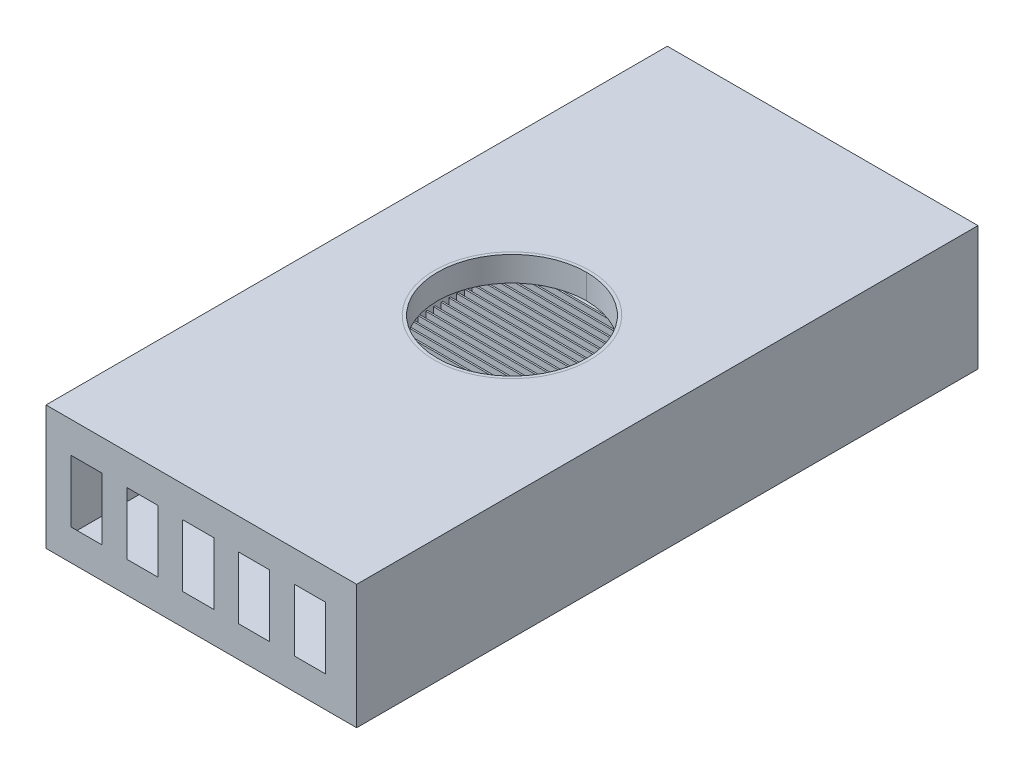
ISO-10303-21;
HEADER;
FILE_DESCRIPTION(('STEP AP214'),'2;1');
FILE_NAME('part.step','',(''),(''),'','','');
FILE_SCHEMA(('AUTOMOTIVE_DESIGN { 1 0 10303 214 1 1 1 1 }'));
ENDSEC;
DATA;
#1=APPLICATION_CONTEXT('core data for automotive mechanical design processes');
#2=APPLICATION_PROTOCOL_DEFINITION('international standard','automotive_design',2000,#1);
#3=PRODUCT_CONTEXT('',#1,'mechanical');
#4=PRODUCT('Part','Part','',(#3));
#5=PRODUCT_RELATED_PRODUCT_CATEGORY('part','',(#4));
#6=PRODUCT_DEFINITION_FORMATION('','',#4);
#7=PRODUCT_DEFINITION_CONTEXT('part definition',#1,'design');
#8=PRODUCT_DEFINITION('design','',#6,#7);
#9=PRODUCT_DEFINITION_SHAPE('','',#8);
#10=(LENGTH_UNIT() NAMED_UNIT(*) SI_UNIT(.MILLI.,.METRE.));
#11=(NAMED_UNIT(*) PLANE_ANGLE_UNIT() SI_UNIT($,.RADIAN.));
#12=(NAMED_UNIT(*) SI_UNIT($,.STERADIAN.) SOLID_ANGLE_UNIT());
#13=UNCERTAINTY_MEASURE_WITH_UNIT(LENGTH_MEASURE(1.E-05),#10,'distance_accuracy_value','');
#14=(GEOMETRIC_REPRESENTATION_CONTEXT(3) GLOBAL_UNCERTAINTY_ASSIGNED_CONTEXT((#13)) GLOBAL_UNIT_ASSIGNED_CONTEXT((#10,
#11,#12)) REPRESENTATION_CONTEXT('',''));
#15=CARTESIAN_POINT('',(0.,0.,0.));
#16=DIRECTION('',(0.,0.,1.));
#17=DIRECTION('',(1.,0.,0.));
#18=AXIS2_PLACEMENT_3D('',#15,#16,#17);
#19=CARTESIAN_POINT('',(0.,-5.,0.));
#20=DIRECTION('',(0.,-1.,0.));
#21=DIRECTION('',(0.,0.,-1.));
#22=AXIS2_PLACEMENT_3D('',#19,#20,#21);
#23=PLANE('',#22);
#24=DIRECTION('',(0.,0.,-1.));
#25=VECTOR('',#24,1.);
#26=CARTESIAN_POINT('',(5.,-5.,-25.));
#27=LINE('',#26,#25);
#28=CARTESIAN_POINT('',(5.,-5.,-5.));
#29=VERTEX_POINT('',#28);
#30=CARTESIAN_POINT('',(5.,-5.,-45.));
#31=VERTEX_POINT('',#30);
#32=EDGE_CURVE('P0_E63',#29,#31,#27,.T.);
#33=ORIENTED_EDGE('',*,*,#32,.T.);
#34=DIRECTION('',(1.,0.,0.));
#35=VECTOR('',#34,1.);
#36=CARTESIAN_POINT('',(25.,-5.,-45.));
#37=LINE('',#36,#35);
#38=CARTESIAN_POINT('',(45.,-5.,-45.));
#39=VERTEX_POINT('',#38);
#40=EDGE_CURVE('P0_E11',#31,#39,#37,.T.);
#41=ORIENTED_EDGE('',*,*,#40,.T.);
#42=DIRECTION('',(0.,0.,1.));
#43=VECTOR('',#42,1.);
#44=CARTESIAN_POINT('',(45.,-5.,-25.));
#45=LINE('',#44,#43);
#46=CARTESIAN_POINT('',(45.,-5.,-5.));
#47=VERTEX_POINT('',#46);
#48=EDGE_CURVE('P0_E36',#39,#47,#45,.T.);
#49=ORIENTED_EDGE('',*,*,#48,.T.);
#50=DIRECTION('',(-1.,0.,0.));
#51=VECTOR('',#50,1.);
#52=CARTESIAN_POINT('',(25.,-5.,-5.));
#53=LINE('',#52,#51);
#54=EDGE_CURVE('P0_E67',#47,#29,#53,.T.);
#55=ORIENTED_EDGE('',*,*,#54,.T.);
#56=EDGE_LOOP('',(#33,#41,#49,#55));
#57=FACE_BOUND('',#56,.T.);
#58=ADVANCED_FACE('P0_F16',(#57),#23,.T.);
#59=CARTESIAN_POINT('',(5.,-5.,-45.));
#60=DIRECTION('',(0.,0.,1.));
#61=DIRECTION('',(1.,0.,0.));
#62=AXIS2_PLACEMENT_3D('',#59,#60,#61);
#63=PLANE('',#62);
#64=DIRECTION('',(1.,0.,0.));
#65=VECTOR('',#64,1.);
#66=CARTESIAN_POINT('',(25.,0.,-45.));
#67=LINE('',#66,#65);
#68=CARTESIAN_POINT('',(5.,0.,-45.));
#69=VERTEX_POINT('',#68);
#70=CARTESIAN_POINT('',(45.,0.,-45.));
#71=VERTEX_POINT('',#70);
#72=EDGE_CURVE('P0_E81',#69,#71,#67,.T.);
#73=ORIENTED_EDGE('',*,*,#72,.T.);
#74=DIRECTION('',(0.,1.,0.));
#75=VECTOR('',#74,1.);
#76=CARTESIAN_POINT('',(45.,-2.5,-45.));
#77=LINE('',#76,#75);
#78=EDGE_CURVE('P0_E25',#39,#71,#77,.T.);
#79=ORIENTED_EDGE('',*,*,#78,.F.);
#80=ORIENTED_EDGE('',*,*,#40,.F.);
#81=DIRECTION('',(0.,1.,0.));
#82=VECTOR('',#81,1.);
#83=CARTESIAN_POINT('',(5.,-2.5,-45.));
#84=LINE('',#83,#82);
#85=EDGE_CURVE('P0_E89',#31,#69,#84,.T.);
#86=ORIENTED_EDGE('',*,*,#85,.T.);
#87=EDGE_LOOP('',(#73,#79,#80,#86));
#88=FACE_BOUND('',#87,.T.);
#89=ADVANCED_FACE('P0_F105',(#88),#63,.F.);
#90=CARTESIAN_POINT('',(45.,-5.,-5.));
#91=DIRECTION('',(-1.,0.,0.));
#92=DIRECTION('',(0.,0.,1.));
#93=AXIS2_PLACEMENT_3D('',#90,#91,#92);
#94=PLANE('',#93);
#95=DIRECTION('',(0.,0.,1.));
#96=VECTOR('',#95,1.);
#97=CARTESIAN_POINT('',(45.,0.,-25.));
#98=LINE('',#97,#96);
#99=CARTESIAN_POINT('',(45.,0.,-5.));
#100=VERTEX_POINT('',#99);
#101=EDGE_CURVE('P0_E76',#71,#100,#98,.T.);
#102=ORIENTED_EDGE('',*,*,#101,.T.);
#103=DIRECTION('',(0.,1.,0.));
#104=VECTOR('',#103,1.);
#105=CARTESIAN_POINT('',(45.,-2.5,-5.));
#106=LINE('',#105,#104);
#107=EDGE_CURVE('P0_E19',#47,#100,#106,.T.);
#108=ORIENTED_EDGE('',*,*,#107,.F.);
#109=ORIENTED_EDGE('',*,*,#48,.F.);
#110=ORIENTED_EDGE('',*,*,#78,.T.);
#111=EDGE_LOOP('',(#102,#108,#109,#110));
#112=FACE_BOUND('',#111,.T.);
#113=ADVANCED_FACE('P0_F103',(#112),#94,.F.);
#114=CARTESIAN_POINT('',(5.,-5.,-5.));
#115=DIRECTION('',(0.,0.,-1.));
#116=DIRECTION('',(-1.,0.,0.));
#117=AXIS2_PLACEMENT_3D('',#114,#115,#116);
#118=PLANE('',#117);
#119=DIRECTION('',(-1.,0.,0.));
#120=VECTOR('',#119,1.);
#121=CARTESIAN_POINT('',(25.,0.,-5.));
#122=LINE('',#121,#120);
#123=CARTESIAN_POINT('',(5.,0.,-5.));
#124=VERTEX_POINT('',#123);
#125=EDGE_CURVE('P0_E70',#100,#124,#122,.T.);
#126=ORIENTED_EDGE('',*,*,#125,.T.);
#127=DIRECTION('',(0.,1.,0.));
#128=VECTOR('',#127,1.);
#129=CARTESIAN_POINT('',(5.,-2.5,-5.));
#130=LINE('',#129,#128);
#131=EDGE_CURVE('P0_E57',#29,#124,#130,.T.);
#132=ORIENTED_EDGE('',*,*,#131,.F.);
#133=ORIENTED_EDGE('',*,*,#54,.F.);
#134=ORIENTED_EDGE('',*,*,#107,.T.);
#135=EDGE_LOOP('',(#126,#132,#133,#134));
#136=FACE_BOUND('',#135,.T.);
#137=ADVANCED_FACE('P0_F71',(#136),#118,.F.);
#138=CARTESIAN_POINT('',(5.,-5.,-5.));
#139=DIRECTION('',(1.,0.,0.));
#140=DIRECTION('',(0.,0.,-1.));
#141=AXIS2_PLACEMENT_3D('',#138,#139,#140);
#142=PLANE('',#141);
#143=DIRECTION('',(0.,0.,-1.));
#144=VECTOR('',#143,1.);
#145=CARTESIAN_POINT('',(5.,0.,-25.));
#146=LINE('',#145,#144);
#147=EDGE_CURVE('P0_E62',#124,#69,#146,.T.);
#148=ORIENTED_EDGE('',*,*,#147,.T.);
#149=ORIENTED_EDGE('',*,*,#85,.F.);
#150=ORIENTED_EDGE('',*,*,#32,.F.);
#151=ORIENTED_EDGE('',*,*,#131,.T.);
#152=EDGE_LOOP('',(#148,#149,#150,#151));
#153=FACE_BOUND('',#152,.T.);
#154=ADVANCED_FACE('P0_F59',(#153),#142,.F.);
#155=CARTESIAN_POINT('',(50.,0.,-50.));
#156=DIRECTION('',(0.,-1.,0.));
#157=DIRECTION('',(0.,0.,-1.));
#158=AXIS2_PLACEMENT_3D('',#155,#156,#157);
#159=PLANE('',#158);
#160=ORIENTED_EDGE('',*,*,#147,.F.);
#161=ORIENTED_EDGE('',*,*,#125,.F.);
#162=ORIENTED_EDGE('',*,*,#101,.F.);
#163=ORIENTED_EDGE('',*,*,#72,.F.);
#164=EDGE_LOOP('',(#160,#161,#162,#163));
#165=FACE_BOUND('',#164,.T.);
#166=ADVANCED_FACE('P0_F79',(#165),#159,.F.);
#167=CLOSED_SHELL('',(#58,#89,#113,#137,#154,#166));
#168=MANIFOLD_SOLID_BREP('P0_B1',#167);
#169=CARTESIAN_POINT('',(50.,-50.0389910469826,-0.5));
#170=DIRECTION('',(0.,0.,1.));
#171=DIRECTION('',(1.,0.,0.));
#172=AXIS2_PLACEMENT_3D('',#169,#170,#171);
#173=PLANE('',#172);
#174=DIRECTION('',(0.,1.,0.));
#175=VECTOR('',#174,1.);
#176=CARTESIAN_POINT('',(0.,14.,-0.5));
#177=LINE('',#176,#175);
#178=CARTESIAN_POINT('',(0.,3.,-0.5));
#179=VERTEX_POINT('',#178);
#180=CARTESIAN_POINT('',(0.,25.,-0.5));
#181=VERTEX_POINT('',#180);
#182=EDGE_CURVE('P1_E728',#179,#181,#177,.T.);
#183=ORIENTED_EDGE('',*,*,#182,.T.);
#184=DIRECTION('',(1.,0.,0.));
#185=VECTOR('',#184,1.);
#186=CARTESIAN_POINT('',(25.,25.,-0.5));
#187=LINE('',#186,#185);
#188=CARTESIAN_POINT('',(50.,25.,-0.5));
#189=VERTEX_POINT('',#188);
#190=EDGE_CURVE('P1_E11',#181,#189,#187,.T.);
#191=ORIENTED_EDGE('',*,*,#190,.T.);
#192=DIRECTION('',(0.,1.,0.));
#193=VECTOR('',#192,1.);
#194=CARTESIAN_POINT('',(50.,14.,-0.5));
#195=LINE('',#194,#193);
#196=CARTESIAN_POINT('',(50.,3.,-0.5));
#197=VERTEX_POINT('',#196);
#198=EDGE_CURVE('P1_E629',#197,#189,#195,.T.);
#199=ORIENTED_EDGE('',*,*,#198,.F.);
#200=DIRECTION('',(1.,0.,0.));
#201=VECTOR('',#200,1.);
#202=CARTESIAN_POINT('',(25.,3.,-0.5));
#203=LINE('',#202,#201);
#204=EDGE_CURVE('P1_E386',#179,#197,#203,.T.);
#205=ORIENTED_EDGE('',*,*,#204,.F.);
#206=EDGE_LOOP('',(#183,#191,#199,#205));
#207=FACE_BOUND('',#206,.T.);
#208=ADVANCED_FACE('P1_F16',(#207),#173,.F.);
#209=CARTESIAN_POINT('',(0.,25.,0.));
#210=DIRECTION('',(0.,-1.,0.));
#211=DIRECTION('',(0.,0.,-1.));
#212=AXIS2_PLACEMENT_3D('',#209,#210,#211);
#213=PLANE('',#212);
#214=DIRECTION('',(0.,0.,-1.));
#215=VECTOR('',#214,1.);
#216=CARTESIAN_POINT('',(50.,25.,-0.25));
#217=LINE('',#216,#215);
#218=CARTESIAN_POINT('',(50.,25.,0.));
#219=VERTEX_POINT('',#218);
#220=EDGE_CURVE('P1_E615',#219,#189,#217,.T.);
#221=ORIENTED_EDGE('',*,*,#220,.T.);
#222=ORIENTED_EDGE('',*,*,#190,.F.);
#223=DIRECTION('',(0.,0.,1.));
#224=VECTOR('',#223,1.);
#225=CARTESIAN_POINT('',(0.,25.,-0.25));
#226=LINE('',#225,#224);
#227=CARTESIAN_POINT('',(0.,25.,0.));
#228=VERTEX_POINT('',#227);
#229=EDGE_CURVE('P1_E618',#181,#228,#226,.T.);
#230=ORIENTED_EDGE('',*,*,#229,.T.);
#231=DIRECTION('',(1.,0.,0.));
#232=VECTOR('',#231,1.);
#233=CARTESIAN_POINT('',(25.,25.,0.));
#234=LINE('',#233,#232);
#235=EDGE_CURVE('P1_E19',#228,#219,#234,.T.);
#236=ORIENTED_EDGE('',*,*,#235,.T.);
#237=EDGE_LOOP('',(#221,#222,#230,#236));
#238=FACE_BOUND('',#237,.T.);
#239=ADVANCED_FACE('P1_F613',(#238),#213,.F.);
#240=CARTESIAN_POINT('',(0.,25.,0.));
#241=DIRECTION('',(0.,0.,-1.));
#242=DIRECTION('',(-1.,0.,0.));
#243=AXIS2_PLACEMENT_3D('',#240,#241,#242);
#244=PLANE('',#243);
#245=DIRECTION('',(1.,0.,0.));
#246=VECTOR('',#245,1.);
#247=CARTESIAN_POINT('',(25.,0.,0.));
#248=LINE('',#247,#246);
#249=CARTESIAN_POINT('',(0.,0.,0.));
#250=VERTEX_POINT('',#249);
#251=CARTESIAN_POINT('',(50.,0.,0.));
#252=VERTEX_POINT('',#251);
#253=EDGE_CURVE('P1_E601',#250,#252,#248,.T.);
#254=ORIENTED_EDGE('',*,*,#253,.T.);
#255=DIRECTION('',(0.,-1.,0.));
#256=VECTOR('',#255,1.);
#257=CARTESIAN_POINT('',(50.,12.5,0.));
#258=LINE('',#257,#256);
#259=EDGE_CURVE('P1_E621',#219,#252,#258,.T.);
#260=ORIENTED_EDGE('',*,*,#259,.F.);
#261=ORIENTED_EDGE('',*,*,#235,.F.);
#262=DIRECTION('',(0.,-1.,0.));
#263=VECTOR('',#262,1.);
#264=CARTESIAN_POINT('',(0.,12.5,0.));
#265=LINE('',#264,#263);
#266=EDGE_CURVE('P1_E726',#228,#250,#265,.T.);
#267=ORIENTED_EDGE('',*,*,#266,.T.);
#268=EDGE_LOOP('',(#254,#260,#261,#267));
#269=FACE_BOUND('',#268,.T.);
#270=ADVANCED_FACE('P1_F622',(#269),#244,.F.);
#271=CARTESIAN_POINT('',(50.,0.,-50.));
#272=DIRECTION('',(0.,-1.,0.));
#273=DIRECTION('',(0.,0.,-1.));
#274=AXIS2_PLACEMENT_3D('',#271,#272,#273);
#275=PLANE('',#274);
#276=DIRECTION('',(0.,0.,1.));
#277=VECTOR('',#276,1.);
#278=CARTESIAN_POINT('',(0.,0.,-25.));
#279=LINE('',#278,#277);
#280=CARTESIAN_POINT('',(0.,0.,-50.));
#281=VERTEX_POINT('',#280);
#282=EDGE_CURVE('P1_E722',#281,#250,#279,.T.);
#283=ORIENTED_EDGE('',*,*,#282,.F.);
#284=DIRECTION('',(-1.,0.,0.));
#285=VECTOR('',#284,1.);
#286=CARTESIAN_POINT('',(25.,0.,-50.));
#287=LINE('',#286,#285);
#288=CARTESIAN_POINT('',(50.,0.,-50.));
#289=VERTEX_POINT('',#288);
#290=EDGE_CURVE('P1_E599',#289,#281,#287,.T.);
#291=ORIENTED_EDGE('',*,*,#290,.F.);
#292=DIRECTION('',(0.,0.,-1.));
#293=VECTOR('',#292,1.);
#294=CARTESIAN_POINT('',(50.,0.,-25.));
#295=LINE('',#294,#293);
#296=EDGE_CURVE('P1_E625',#252,#289,#295,.T.);
#297=ORIENTED_EDGE('',*,*,#296,.F.);
#298=ORIENTED_EDGE('',*,*,#253,.F.);
#299=EDGE_LOOP('',(#283,#291,#297,#298));
#300=FACE_BOUND('',#299,.T.);
#301=ADVANCED_FACE('P1_F1303',(#300),#275,.T.);
#302=CARTESIAN_POINT('',(0.,25.,-50.));
#303=DIRECTION('',(0.,0.,1.));
#304=DIRECTION('',(1.,0.,0.));
#305=AXIS2_PLACEMENT_3D('',#302,#303,#304);
#306=PLANE('',#305);
#307=ORIENTED_EDGE('',*,*,#290,.T.);
#308=DIRECTION('',(0.,-1.,0.));
#309=VECTOR('',#308,1.);
#310=CARTESIAN_POINT('',(0.,12.5,-50.));
#311=LINE('',#310,#309);
#312=CARTESIAN_POINT('',(0.,25.,-50.));
#313=VERTEX_POINT('',#312);
#314=EDGE_CURVE('P1_E727',#313,#281,#311,.T.);
#315=ORIENTED_EDGE('',*,*,#314,.F.);
#316=DIRECTION('',(-1.,0.,0.));
#317=VECTOR('',#316,1.);
#318=CARTESIAN_POINT('',(25.,25.,-50.));
#319=LINE('',#318,#317);
#320=CARTESIAN_POINT('',(50.,25.,-50.));
#321=VERTEX_POINT('',#320);
#322=EDGE_CURVE('P1_E598',#321,#313,#319,.T.);
#323=ORIENTED_EDGE('',*,*,#322,.F.);
#324=DIRECTION('',(0.,-1.,0.));
#325=VECTOR('',#324,1.);
#326=CARTESIAN_POINT('',(50.,12.5,-50.));
#327=LINE('',#326,#325);
#328=EDGE_CURVE('P1_E752',#321,#289,#327,.T.);
#329=ORIENTED_EDGE('',*,*,#328,.T.);
#330=EDGE_LOOP('',(#307,#315,#323,#329));
#331=FACE_BOUND('',#330,.T.);
#332=ADVANCED_FACE('P1_F1763',(#331),#306,.F.);
#333=CARTESIAN_POINT('',(0.,25.,0.));
#334=DIRECTION('',(0.,-1.,0.));
#335=DIRECTION('',(0.,0.,-1.));
#336=AXIS2_PLACEMENT_3D('',#333,#334,#335);
#337=PLANE('',#336);
#338=DIRECTION('',(0.,0.,1.));
#339=VECTOR('',#338,1.);
#340=CARTESIAN_POINT('',(0.,25.,-49.75));
#341=LINE('',#340,#339);
#342=CARTESIAN_POINT('',(0.,25.,-49.5));
#343=VERTEX_POINT('',#342);
#344=EDGE_CURVE('P1_E721',#313,#343,#341,.T.);
#345=ORIENTED_EDGE('',*,*,#344,.T.);
#346=DIRECTION('',(-1.,0.,0.));
#347=VECTOR('',#346,1.);
#348=CARTESIAN_POINT('',(25.,25.,-49.5));
#349=LINE('',#348,#347);
#350=CARTESIAN_POINT('',(50.,25.,-49.5));
#351=VERTEX_POINT('',#350);
#352=EDGE_CURVE('P1_E594',#351,#343,#349,.T.);
#353=ORIENTED_EDGE('',*,*,#352,.F.);
#354=DIRECTION('',(0.,0.,-1.));
#355=VECTOR('',#354,1.);
#356=CARTESIAN_POINT('',(50.,25.,-49.75));
#357=LINE('',#356,#355);
#358=EDGE_CURVE('P1_E763',#351,#321,#357,.T.);
#359=ORIENTED_EDGE('',*,*,#358,.T.);
#360=ORIENTED_EDGE('',*,*,#322,.T.);
#361=EDGE_LOOP('',(#345,#353,#359,#360));
#362=FACE_BOUND('',#361,.T.);
#363=ADVANCED_FACE('P1_F1761',(#362),#337,.F.);
#364=CARTESIAN_POINT('',(50.,-50.0389910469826,-49.5));
#365=DIRECTION('',(0.,0.,-1.));
#366=DIRECTION('',(-1.,0.,0.));
#367=AXIS2_PLACEMENT_3D('',#364,#365,#366);
#368=PLANE('',#367);
#369=DIRECTION('',(0.,1.,0.));
#370=VECTOR('',#369,1.);
#371=CARTESIAN_POINT('',(50.,14.,-49.5));
#372=LINE('',#371,#370);
#373=CARTESIAN_POINT('',(50.,3.,-49.5));
#374=VERTEX_POINT('',#373);
#375=EDGE_CURVE('P1_E769',#374,#351,#372,.T.);
#376=ORIENTED_EDGE('',*,*,#375,.T.);
#377=ORIENTED_EDGE('',*,*,#352,.T.);
#378=DIRECTION('',(0.,1.,0.));
#379=VECTOR('',#378,1.);
#380=CARTESIAN_POINT('',(0.,14.,-49.5));
#381=LINE('',#380,#379);
#382=CARTESIAN_POINT('',(0.,3.,-49.5));
#383=VERTEX_POINT('',#382);
#384=EDGE_CURVE('P1_E717',#383,#343,#381,.T.);
#385=ORIENTED_EDGE('',*,*,#384,.F.);
#386=DIRECTION('',(-1.,0.,0.));
#387=VECTOR('',#386,1.);
#388=CARTESIAN_POINT('',(25.,3.,-49.5));
#389=LINE('',#388,#387);
#390=EDGE_CURVE('P1_E590',#374,#383,#389,.T.);
#391=ORIENTED_EDGE('',*,*,#390,.F.);
#392=EDGE_LOOP('',(#376,#377,#385,#391));
#393=FACE_BOUND('',#392,.T.);
#394=ADVANCED_FACE('P1_F1758',(#393),#368,.F.);
#395=CARTESIAN_POINT('',(0.,3.,0.));
#396=DIRECTION('',(0.,-1.,0.));
#397=DIRECTION('',(0.,0.,-1.));
#398=AXIS2_PLACEMENT_3D('',#395,#396,#397);
#399=PLANE('',#398);
#400=DIRECTION('',(0.,0.,-1.));
#401=VECTOR('',#400,1.);
#402=CARTESIAN_POINT('',(50.,3.,-48.5125000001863));
#403=LINE('',#402,#401);
#404=CARTESIAN_POINT('',(50.,3.,-47.5250000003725));
#405=VERTEX_POINT('',#404);
#406=EDGE_CURVE('P1_E764',#405,#374,#403,.T.);
#407=ORIENTED_EDGE('',*,*,#406,.T.);
#408=ORIENTED_EDGE('',*,*,#390,.T.);
#409=DIRECTION('',(0.,0.,1.));
#410=VECTOR('',#409,1.);
#411=CARTESIAN_POINT('',(0.,3.,-48.5125000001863));
#412=LINE('',#411,#410);
#413=CARTESIAN_POINT('',(0.,3.,-47.5250000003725));
#414=VERTEX_POINT('',#413);
#415=EDGE_CURVE('P1_E713',#383,#414,#412,.T.);
#416=ORIENTED_EDGE('',*,*,#415,.T.);
#417=DIRECTION('',(1.,0.,0.));
#418=VECTOR('',#417,1.);
#419=CARTESIAN_POINT('',(25.,3.,-47.5250000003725));
#420=LINE('',#419,#418);
#421=EDGE_CURVE('P1_E586',#414,#405,#420,.T.);
#422=ORIENTED_EDGE('',*,*,#421,.T.);
#423=EDGE_LOOP('',(#407,#408,#416,#422));
#424=FACE_BOUND('',#423,.T.);
#425=ADVANCED_FACE('P1_F1755',(#424),#399,.F.);
#426=CARTESIAN_POINT('',(50.,-50.0389910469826,-47.525));
#427=DIRECTION('',(0.,0.,1.));
#428=DIRECTION('',(1.,0.,0.));
#429=AXIS2_PLACEMENT_3D('',#426,#427,#428);
#430=PLANE('',#429);
#431=DIRECTION('',(0.,1.,0.));
#432=VECTOR('',#431,1.);
#433=CARTESIAN_POINT('',(0.,14.,-47.5250000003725));
#434=LINE('',#433,#432);
#435=CARTESIAN_POINT('',(0.,25.,-47.5250000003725));
#436=VERTEX_POINT('',#435);
#437=EDGE_CURVE('P1_E709',#414,#436,#434,.T.);
#438=ORIENTED_EDGE('',*,*,#437,.T.);
#439=DIRECTION('',(1.,0.,0.));
#440=VECTOR('',#439,1.);
#441=CARTESIAN_POINT('',(25.,25.,-47.5250000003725));
#442=LINE('',#441,#440);
#443=CARTESIAN_POINT('',(50.,25.,-47.5250000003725));
#444=VERTEX_POINT('',#443);
#445=EDGE_CURVE('P1_E582',#436,#444,#442,.T.);
#446=ORIENTED_EDGE('',*,*,#445,.T.);
#447=DIRECTION('',(0.,1.,0.));
#448=VECTOR('',#447,1.);
#449=CARTESIAN_POINT('',(50.,14.,-47.5250000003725));
#450=LINE('',#449,#448);
#451=EDGE_CURVE('P1_E768',#405,#444,#450,.T.);
#452=ORIENTED_EDGE('',*,*,#451,.F.);
#453=ORIENTED_EDGE('',*,*,#421,.F.);
#454=EDGE_LOOP('',(#438,#446,#452,#453));
#455=FACE_BOUND('',#454,.T.);
#456=ADVANCED_FACE('P1_F1752',(#455),#430,.F.);
#457=CARTESIAN_POINT('',(0.,25.,0.));
#458=DIRECTION('',(0.,-1.,0.));
#459=DIRECTION('',(0.,0.,-1.));
#460=AXIS2_PLACEMENT_3D('',#457,#458,#459);
#461=PLANE('',#460);
#462=DIRECTION('',(0.,0.,1.));
#463=VECTOR('',#462,1.);
#464=CARTESIAN_POINT('',(0.,25.,-47.2750000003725));
#465=LINE('',#464,#463);
#466=CARTESIAN_POINT('',(0.,25.,-47.0250000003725));
#467=VERTEX_POINT('',#466);
#468=EDGE_CURVE('P1_E705',#436,#467,#465,.T.);
#469=ORIENTED_EDGE('',*,*,#468,.T.);
#470=DIRECTION('',(-1.,0.,0.));
#471=VECTOR('',#470,1.);
#472=CARTESIAN_POINT('',(25.,25.,-47.0250000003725));
#473=LINE('',#472,#471);
#474=CARTESIAN_POINT('',(50.,25.,-47.0250000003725));
#475=VERTEX_POINT('',#474);
#476=EDGE_CURVE('P1_E579',#475,#467,#473,.T.);
#477=ORIENTED_EDGE('',*,*,#476,.F.);
#478=DIRECTION('',(0.,0.,-1.));
#479=VECTOR('',#478,1.);
#480=CARTESIAN_POINT('',(50.,25.,-47.2750000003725));
#481=LINE('',#480,#479);
#482=EDGE_CURVE('P1_E770',#475,#444,#481,.T.);
#483=ORIENTED_EDGE('',*,*,#482,.T.);
#484=ORIENTED_EDGE('',*,*,#445,.F.);
#485=EDGE_LOOP('',(#469,#477,#483,#484));
#486=FACE_BOUND('',#485,.T.);
#487=ADVANCED_FACE('P1_F1748',(#486),#461,.F.);
#488=CARTESIAN_POINT('',(50.,-50.0389910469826,-47.025));
#489=DIRECTION('',(0.,0.,-1.));
#490=DIRECTION('',(-1.,0.,0.));
#491=AXIS2_PLACEMENT_3D('',#488,#489,#490);
#492=PLANE('',#491);
#493=DIRECTION('',(0.,1.,0.));
#494=VECTOR('',#493,1.);
#495=CARTESIAN_POINT('',(50.,14.,-47.0250000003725));
#496=LINE('',#495,#494);
#497=CARTESIAN_POINT('',(50.,3.,-47.0250000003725));
#498=VERTEX_POINT('',#497);
#499=EDGE_CURVE('P1_E774',#498,#475,#496,.T.);
#500=ORIENTED_EDGE('',*,*,#499,.T.);
#501=ORIENTED_EDGE('',*,*,#476,.T.);
#502=DIRECTION('',(0.,1.,0.));
#503=VECTOR('',#502,1.);
#504=CARTESIAN_POINT('',(0.,14.,-47.0250000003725));
#505=LINE('',#504,#503);
#506=CARTESIAN_POINT('',(0.,3.,-47.0250000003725));
#507=VERTEX_POINT('',#506);
#508=EDGE_CURVE('P1_E700',#507,#467,#505,.T.);
#509=ORIENTED_EDGE('',*,*,#508,.F.);
#510=DIRECTION('',(-1.,0.,0.));
#511=VECTOR('',#510,1.);
#512=CARTESIAN_POINT('',(25.,3.,-47.0250000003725));
#513=LINE('',#512,#511);
#514=EDGE_CURVE('P1_E411',#498,#507,#513,.T.);
#515=ORIENTED_EDGE('',*,*,#514,.F.);
#516=EDGE_LOOP('',(#500,#501,#509,#515));
#517=FACE_BOUND('',#516,.T.);
#518=ADVANCED_FACE('P1_F1743',(#517),#492,.F.);
#519=CARTESIAN_POINT('',(0.,3.,0.));
#520=DIRECTION('',(0.,-1.,0.));
#521=DIRECTION('',(0.,0.,-1.));
#522=AXIS2_PLACEMENT_3D('',#519,#520,#521);
#523=PLANE('',#522);
#524=DIRECTION('',(0.,0.,-1.));
#525=VECTOR('',#524,1.);
#526=CARTESIAN_POINT('',(50.,3.,-46.0375000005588));
#527=LINE('',#526,#525);
#528=CARTESIAN_POINT('',(50.,3.,-45.0500000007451));
#529=VERTEX_POINT('',#528);
#530=EDGE_CURVE('P1_E778',#529,#498,#527,.T.);
#531=ORIENTED_EDGE('',*,*,#530,.T.);
#532=ORIENTED_EDGE('',*,*,#514,.T.);
#533=DIRECTION('',(0.,0.,1.));
#534=VECTOR('',#533,1.);
#535=CARTESIAN_POINT('',(0.,3.,-46.0375000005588));
#536=LINE('',#535,#534);
#537=CARTESIAN_POINT('',(0.,3.,-45.0500000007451));
#538=VERTEX_POINT('',#537);
#539=EDGE_CURVE('P1_E696',#507,#538,#536,.T.);
#540=ORIENTED_EDGE('',*,*,#539,.T.);
#541=DIRECTION('',(1.,0.,0.));
#542=VECTOR('',#541,1.);
#543=CARTESIAN_POINT('',(25.,3.,-45.0500000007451));
#544=LINE('',#543,#542);
#545=EDGE_CURVE('P1_E407',#538,#529,#544,.T.);
#546=ORIENTED_EDGE('',*,*,#545,.T.);
#547=EDGE_LOOP('',(#531,#532,#540,#546));
#548=FACE_BOUND('',#547,.T.);
#549=ADVANCED_FACE('P1_F1739',(#548),#523,.F.);
#550=CARTESIAN_POINT('',(50.,-50.0389910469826,-45.05));
#551=DIRECTION('',(0.,0.,1.));
#552=DIRECTION('',(1.,0.,0.));
#553=AXIS2_PLACEMENT_3D('',#550,#551,#552);
#554=PLANE('',#553);
#555=DIRECTION('',(0.,1.,0.));
#556=VECTOR('',#555,1.);
#557=CARTESIAN_POINT('',(0.,14.,-45.0500000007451));
#558=LINE('',#557,#556);
#559=CARTESIAN_POINT('',(0.,25.,-45.0500000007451));
#560=VERTEX_POINT('',#559);
#561=EDGE_CURVE('P1_E701',#538,#560,#558,.T.);
#562=ORIENTED_EDGE('',*,*,#561,.T.);
#563=DIRECTION('',(1.,0.,0.));
#564=VECTOR('',#563,1.);
#565=CARTESIAN_POINT('',(25.,25.,-45.0500000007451));
#566=LINE('',#565,#564);
#567=CARTESIAN_POINT('',(50.,25.,-45.0500000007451));
#568=VERTEX_POINT('',#567);
#569=EDGE_CURVE('P1_E412',#560,#568,#566,.T.);
#570=ORIENTED_EDGE('',*,*,#569,.T.);
#571=DIRECTION('',(0.,1.,0.));
#572=VECTOR('',#571,1.);
#573=CARTESIAN_POINT('',(50.,14.,-45.0500000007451));
#574=LINE('',#573,#572);
#575=EDGE_CURVE('P1_E747',#529,#568,#574,.T.);
#576=ORIENTED_EDGE('',*,*,#575,.F.);
#577=ORIENTED_EDGE('',*,*,#545,.F.);
#578=EDGE_LOOP('',(#562,#570,#576,#577));
#579=FACE_BOUND('',#578,.T.);
#580=ADVANCED_FACE('P1_F1735',(#579),#554,.F.);
#581=CARTESIAN_POINT('',(0.,25.,0.));
#582=DIRECTION('',(0.,-1.,0.));
#583=DIRECTION('',(0.,0.,-1.));
#584=AXIS2_PLACEMENT_3D('',#581,#582,#583);
#585=PLANE('',#584);
#586=DIRECTION('',(0.,0.,1.));
#587=VECTOR('',#586,1.);
#588=CARTESIAN_POINT('',(0.,25.,-44.8000000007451));
#589=LINE('',#588,#587);
#590=CARTESIAN_POINT('',(0.,25.,-44.5500000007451));
#591=VERTEX_POINT('',#590);
#592=EDGE_CURVE('P1_E1103',#560,#591,#589,.T.);
#593=ORIENTED_EDGE('',*,*,#592,.T.);
#594=DIRECTION('',(-1.,0.,0.));
#595=VECTOR('',#594,1.);
#596=CARTESIAN_POINT('',(25.,25.,-44.5500000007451));
#597=LINE('',#596,#595);
#598=CARTESIAN_POINT('',(50.,25.,-44.5500000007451));
#599=VERTEX_POINT('',#598);
#600=EDGE_CURVE('P1_E575',#599,#591,#597,.T.);
#601=ORIENTED_EDGE('',*,*,#600,.F.);
#602=DIRECTION('',(0.,0.,-1.));
#603=VECTOR('',#602,1.);
#604=CARTESIAN_POINT('',(50.,25.,-44.8000000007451));
#605=LINE('',#604,#603);
#606=EDGE_CURVE('P1_E742',#599,#568,#605,.T.);
#607=ORIENTED_EDGE('',*,*,#606,.T.);
#608=ORIENTED_EDGE('',*,*,#569,.F.);
#609=EDGE_LOOP('',(#593,#601,#607,#608));
#610=FACE_BOUND('',#609,.T.);
#611=ADVANCED_FACE('P1_F1731',(#610),#585,.F.);
#612=CARTESIAN_POINT('',(50.,-50.0389910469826,-44.55));
#613=DIRECTION('',(0.,0.,-1.));
#614=DIRECTION('',(-1.,0.,0.));
#615=AXIS2_PLACEMENT_3D('',#612,#613,#614);
#616=PLANE('',#615);
#617=DIRECTION('',(0.,1.,0.));
#618=VECTOR('',#617,1.);
#619=CARTESIAN_POINT('',(50.,14.,-44.5500000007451));
#620=LINE('',#619,#618);
#621=CARTESIAN_POINT('',(50.,3.,-44.5500000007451));
#622=VERTEX_POINT('',#621);
#623=EDGE_CURVE('P1_E746',#622,#599,#620,.T.);
#624=ORIENTED_EDGE('',*,*,#623,.T.);
#625=ORIENTED_EDGE('',*,*,#600,.T.);
#626=DIRECTION('',(0.,1.,0.));
#627=VECTOR('',#626,1.);
#628=CARTESIAN_POINT('',(0.,14.,-44.5500000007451));
#629=LINE('',#628,#627);
#630=CARTESIAN_POINT('',(0.,3.,-44.5500000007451));
#631=VERTEX_POINT('',#630);
#632=EDGE_CURVE('P1_E649',#631,#591,#629,.T.);
#633=ORIENTED_EDGE('',*,*,#632,.F.);
#634=DIRECTION('',(-1.,0.,0.));
#635=VECTOR('',#634,1.);
#636=CARTESIAN_POINT('',(25.,3.,-44.5500000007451));
#637=LINE('',#636,#635);
#638=EDGE_CURVE('P1_E572',#622,#631,#637,.T.);
#639=ORIENTED_EDGE('',*,*,#638,.F.);
#640=EDGE_LOOP('',(#624,#625,#633,#639));
#641=FACE_BOUND('',#640,.T.);
#642=ADVANCED_FACE('P1_F1728',(#641),#616,.F.);
#643=CARTESIAN_POINT('',(0.,3.,0.));
#644=DIRECTION('',(0.,-1.,0.));
#645=DIRECTION('',(0.,0.,-1.));
#646=AXIS2_PLACEMENT_3D('',#643,#644,#645);
#647=PLANE('',#646);
#648=DIRECTION('',(0.,0.,-1.));
#649=VECTOR('',#648,1.);
#650=CARTESIAN_POINT('',(50.,3.,-43.5625));
#651=LINE('',#650,#649);
#652=CARTESIAN_POINT('',(50.,3.,-42.5749999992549));
#653=VERTEX_POINT('',#652);
#654=EDGE_CURVE('P1_E787',#653,#622,#651,.T.);
#655=ORIENTED_EDGE('',*,*,#654,.T.);
#656=ORIENTED_EDGE('',*,*,#638,.T.);
#657=DIRECTION('',(0.,0.,1.));
#658=VECTOR('',#657,1.);
#659=CARTESIAN_POINT('',(0.,3.,-43.5625));
#660=LINE('',#659,#658);
#661=CARTESIAN_POINT('',(0.,3.,-42.5749999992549));
#662=VERTEX_POINT('',#661);
#663=EDGE_CURVE('P1_E645',#631,#662,#660,.T.);
#664=ORIENTED_EDGE('',*,*,#663,.T.);
#665=DIRECTION('',(1.,0.,0.));
#666=VECTOR('',#665,1.);
#667=CARTESIAN_POINT('',(25.,3.,-42.5749999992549));
#668=LINE('',#667,#666);
#669=EDGE_CURVE('P1_E569',#662,#653,#668,.T.);
#670=ORIENTED_EDGE('',*,*,#669,.T.);
#671=EDGE_LOOP('',(#655,#656,#664,#670));
#672=FACE_BOUND('',#671,.T.);
#673=ADVANCED_FACE('P1_F1726',(#672),#647,.F.);
#674=CARTESIAN_POINT('',(50.,-50.0389910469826,-42.575));
#675=DIRECTION('',(0.,0.,1.));
#676=DIRECTION('',(1.,0.,0.));
#677=AXIS2_PLACEMENT_3D('',#674,#675,#676);
#678=PLANE('',#677);
#679=DIRECTION('',(0.,1.,0.));
#680=VECTOR('',#679,1.);
#681=CARTESIAN_POINT('',(0.,14.,-42.5749999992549));
#682=LINE('',#681,#680);
#683=CARTESIAN_POINT('',(0.,25.,-42.5749999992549));
#684=VERTEX_POINT('',#683);
#685=EDGE_CURVE('P1_E650',#662,#684,#682,.T.);
#686=ORIENTED_EDGE('',*,*,#685,.T.);
#687=DIRECTION('',(1.,0.,0.));
#688=VECTOR('',#687,1.);
#689=CARTESIAN_POINT('',(25.,25.,-42.5749999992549));
#690=LINE('',#689,#688);
#691=CARTESIAN_POINT('',(50.,25.,-42.5749999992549));
#692=VERTEX_POINT('',#691);
#693=EDGE_CURVE('P1_E568',#684,#692,#690,.T.);
#694=ORIENTED_EDGE('',*,*,#693,.T.);
#695=DIRECTION('',(0.,1.,0.));
#696=VECTOR('',#695,1.);
#697=CARTESIAN_POINT('',(50.,14.,-42.5749999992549));
#698=LINE('',#697,#696);
#699=EDGE_CURVE('P1_E796',#653,#692,#698,.T.);
#700=ORIENTED_EDGE('',*,*,#699,.F.);
#701=ORIENTED_EDGE('',*,*,#669,.F.);
#702=EDGE_LOOP('',(#686,#694,#700,#701));
#703=FACE_BOUND('',#702,.T.);
#704=ADVANCED_FACE('P1_F1721',(#703),#678,.F.);
#705=CARTESIAN_POINT('',(0.,25.,0.));
#706=DIRECTION('',(0.,-1.,0.));
#707=DIRECTION('',(0.,0.,-1.));
#708=AXIS2_PLACEMENT_3D('',#705,#706,#707);
#709=PLANE('',#708);
#710=DIRECTION('',(0.,0.,1.));
#711=VECTOR('',#710,1.);
#712=CARTESIAN_POINT('',(0.,25.,-42.3249999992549));
#713=LINE('',#712,#711);
#714=CARTESIAN_POINT('',(0.,25.,-42.0749999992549));
#715=VERTEX_POINT('',#714);
#716=EDGE_CURVE('P1_E688',#684,#715,#713,.T.);
#717=ORIENTED_EDGE('',*,*,#716,.T.);
#718=DIRECTION('',(-1.,0.,0.));
#719=VECTOR('',#718,1.);
#720=CARTESIAN_POINT('',(25.,25.,-42.0749999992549));
#721=LINE('',#720,#719);
#722=CARTESIAN_POINT('',(50.,25.,-42.0749999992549));
#723=VERTEX_POINT('',#722);
#724=EDGE_CURVE('P1_E565',#723,#715,#721,.T.);
#725=ORIENTED_EDGE('',*,*,#724,.F.);
#726=DIRECTION('',(0.,0.,-1.));
#727=VECTOR('',#726,1.);
#728=CARTESIAN_POINT('',(50.,25.,-42.3249999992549));
#729=LINE('',#728,#727);
#730=EDGE_CURVE('P1_E797',#723,#692,#729,.T.);
#731=ORIENTED_EDGE('',*,*,#730,.T.);
#732=ORIENTED_EDGE('',*,*,#693,.F.);
#733=EDGE_LOOP('',(#717,#725,#731,#732));
#734=FACE_BOUND('',#733,.T.);
#735=ADVANCED_FACE('P1_F1707',(#734),#709,.F.);
#736=CARTESIAN_POINT('',(50.,-50.0389910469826,-42.075));
#737=DIRECTION('',(0.,0.,-1.));
#738=DIRECTION('',(-1.,0.,0.));
#739=AXIS2_PLACEMENT_3D('',#736,#737,#738);
#740=PLANE('',#739);
#741=DIRECTION('',(0.,1.,0.));
#742=VECTOR('',#741,1.);
#743=CARTESIAN_POINT('',(50.,14.,-42.0749999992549));
#744=LINE('',#743,#742);
#745=CARTESIAN_POINT('',(50.,3.,-42.0749999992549));
#746=VERTEX_POINT('',#745);
#747=EDGE_CURVE('P1_E801',#746,#723,#744,.T.);
#748=ORIENTED_EDGE('',*,*,#747,.T.);
#749=ORIENTED_EDGE('',*,*,#724,.T.);
#750=DIRECTION('',(0.,1.,0.));
#751=VECTOR('',#750,1.);
#752=CARTESIAN_POINT('',(0.,14.,-42.0749999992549));
#753=LINE('',#752,#751);
#754=CARTESIAN_POINT('',(0.,3.,-42.0749999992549));
#755=VERTEX_POINT('',#754);
#756=EDGE_CURVE('P1_E684',#755,#715,#753,.T.);
#757=ORIENTED_EDGE('',*,*,#756,.F.);
#758=DIRECTION('',(-1.,0.,0.));
#759=VECTOR('',#758,1.);
#760=CARTESIAN_POINT('',(25.,3.,-42.0749999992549));
#761=LINE('',#760,#759);
#762=EDGE_CURVE('P1_E564',#746,#755,#761,.T.);
#763=ORIENTED_EDGE('',*,*,#762,.F.);
#764=EDGE_LOOP('',(#748,#749,#757,#763));
#765=FACE_BOUND('',#764,.T.);
#766=ADVANCED_FACE('P1_F1713',(#765),#740,.F.);
#767=CARTESIAN_POINT('',(0.,3.,0.));
#768=DIRECTION('',(0.,-1.,0.));
#769=DIRECTION('',(0.,0.,-1.));
#770=AXIS2_PLACEMENT_3D('',#767,#768,#769);
#771=PLANE('',#770);
#772=DIRECTION('',(0.,0.,-1.));
#773=VECTOR('',#772,1.);
#774=CARTESIAN_POINT('',(50.,3.,-41.0874999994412));
#775=LINE('',#774,#773);
#776=CARTESIAN_POINT('',(50.,3.,-40.0999999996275));
#777=VERTEX_POINT('',#776);
#778=EDGE_CURVE('P1_E807',#777,#746,#775,.T.);
#779=ORIENTED_EDGE('',*,*,#778,.T.);
#780=ORIENTED_EDGE('',*,*,#762,.T.);
#781=DIRECTION('',(0.,0.,1.));
#782=VECTOR('',#781,1.);
#783=CARTESIAN_POINT('',(0.,3.,-41.0874999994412));
#784=LINE('',#783,#782);
#785=CARTESIAN_POINT('',(0.,3.,-40.0999999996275));
#786=VERTEX_POINT('',#785);
#787=EDGE_CURVE('P1_E689',#755,#786,#784,.T.);
#788=ORIENTED_EDGE('',*,*,#787,.T.);
#789=DIRECTION('',(1.,0.,0.));
#790=VECTOR('',#789,1.);
#791=CARTESIAN_POINT('',(25.,3.,-40.0999999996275));
#792=LINE('',#791,#790);
#793=EDGE_CURVE('P1_E561',#786,#777,#792,.T.);
#794=ORIENTED_EDGE('',*,*,#793,.T.);
#795=EDGE_LOOP('',(#779,#780,#788,#794));
#796=FACE_BOUND('',#795,.T.);
#797=ADVANCED_FACE('P1_F1820',(#796),#771,.F.);
#798=CARTESIAN_POINT('',(50.,-50.0389910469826,-40.1));
#799=DIRECTION('',(0.,0.,1.));
#800=DIRECTION('',(1.,0.,0.));
#801=AXIS2_PLACEMENT_3D('',#798,#799,#800);
#802=PLANE('',#801);
#803=DIRECTION('',(0.,1.,0.));
#804=VECTOR('',#803,1.);
#805=CARTESIAN_POINT('',(0.,14.,-40.0999999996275));
#806=LINE('',#805,#804);
#807=CARTESIAN_POINT('',(0.,25.,-40.0999999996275));
#808=VERTEX_POINT('',#807);
#809=EDGE_CURVE('P1_E683',#786,#808,#806,.T.);
#810=ORIENTED_EDGE('',*,*,#809,.T.);
#811=DIRECTION('',(1.,0.,0.));
#812=VECTOR('',#811,1.);
#813=CARTESIAN_POINT('',(25.,25.,-40.0999999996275));
#814=LINE('',#813,#812);
#815=CARTESIAN_POINT('',(50.,25.,-40.0999999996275));
#816=VERTEX_POINT('',#815);
#817=EDGE_CURVE('P1_E558',#808,#816,#814,.T.);
#818=ORIENTED_EDGE('',*,*,#817,.T.);
#819=DIRECTION('',(0.,1.,0.));
#820=VECTOR('',#819,1.);
#821=CARTESIAN_POINT('',(50.,14.,-40.0999999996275));
#822=LINE('',#821,#820);
#823=EDGE_CURVE('P1_E802',#777,#816,#822,.T.);
#824=ORIENTED_EDGE('',*,*,#823,.F.);
#825=ORIENTED_EDGE('',*,*,#793,.F.);
#826=EDGE_LOOP('',(#810,#818,#824,#825));
#827=FACE_BOUND('',#826,.T.);
#828=ADVANCED_FACE('P1_F1816',(#827),#802,.F.);
#829=CARTESIAN_POINT('',(0.,25.,0.));
#830=DIRECTION('',(0.,-1.,0.));
#831=DIRECTION('',(0.,0.,-1.));
#832=AXIS2_PLACEMENT_3D('',#829,#830,#831);
#833=PLANE('',#832);
#834=DIRECTION('',(0.,0.,1.));
#835=VECTOR('',#834,1.);
#836=CARTESIAN_POINT('',(0.,25.,-39.8499999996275));
#837=LINE('',#836,#835);
#838=CARTESIAN_POINT('',(0.,25.,-39.5999999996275));
#839=VERTEX_POINT('',#838);
#840=EDGE_CURVE('P1_E677',#808,#839,#837,.T.);
#841=ORIENTED_EDGE('',*,*,#840,.T.);
#842=DIRECTION('',(-1.,0.,0.));
#843=VECTOR('',#842,1.);
#844=CARTESIAN_POINT('',(25.,25.,-39.5999999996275));
#845=LINE('',#844,#843);
#846=CARTESIAN_POINT('',(50.,25.,-39.5999999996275));
#847=VERTEX_POINT('',#846);
#848=EDGE_CURVE('P1_E555',#847,#839,#845,.T.);
#849=ORIENTED_EDGE('',*,*,#848,.F.);
#850=DIRECTION('',(0.,0.,-1.));
#851=VECTOR('',#850,1.);
#852=CARTESIAN_POINT('',(50.,25.,-39.8499999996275));
#853=LINE('',#852,#851);
#854=EDGE_CURVE('P1_E806',#847,#816,#853,.T.);
#855=ORIENTED_EDGE('',*,*,#854,.T.);
#856=ORIENTED_EDGE('',*,*,#817,.F.);
#857=EDGE_LOOP('',(#841,#849,#855,#856));
#858=FACE_BOUND('',#857,.T.);
#859=ADVANCED_FACE('P1_F1819',(#858),#833,.F.);
#860=CARTESIAN_POINT('',(50.,-50.0389910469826,-39.6));
#861=DIRECTION('',(0.,0.,-1.));
#862=DIRECTION('',(-1.,0.,0.));
#863=AXIS2_PLACEMENT_3D('',#860,#861,#862);
#864=PLANE('',#863);
#865=DIRECTION('',(0.,1.,0.));
#866=VECTOR('',#865,1.);
#867=CARTESIAN_POINT('',(50.,14.,-39.5999999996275));
#868=LINE('',#867,#866);
#869=CARTESIAN_POINT('',(50.,3.,-39.5999999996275));
#870=VERTEX_POINT('',#869);
#871=EDGE_CURVE('P1_E810',#870,#847,#868,.T.);
#872=ORIENTED_EDGE('',*,*,#871,.T.);
#873=ORIENTED_EDGE('',*,*,#848,.T.);
#874=DIRECTION('',(0.,1.,0.));
#875=VECTOR('',#874,1.);
#876=CARTESIAN_POINT('',(0.,14.,-39.5999999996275));
#877=LINE('',#876,#875);
#878=CARTESIAN_POINT('',(0.,3.,-39.5999999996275));
#879=VERTEX_POINT('',#878);
#880=EDGE_CURVE('P1_E673',#879,#839,#877,.T.);
#881=ORIENTED_EDGE('',*,*,#880,.F.);
#882=DIRECTION('',(-1.,0.,0.));
#883=VECTOR('',#882,1.);
#884=CARTESIAN_POINT('',(25.,3.,-39.5999999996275));
#885=LINE('',#884,#883);
#886=EDGE_CURVE('P1_E554',#870,#879,#885,.T.);
#887=ORIENTED_EDGE('',*,*,#886,.F.);
#888=EDGE_LOOP('',(#872,#873,#881,#887));
#889=FACE_BOUND('',#888,.T.);
#890=ADVANCED_FACE('P1_F1874',(#889),#864,.F.);
#891=CARTESIAN_POINT('',(0.,3.,0.));
#892=DIRECTION('',(0.,-1.,0.));
#893=DIRECTION('',(0.,0.,-1.));
#894=AXIS2_PLACEMENT_3D('',#891,#892,#893);
#895=PLANE('',#894);
#896=DIRECTION('',(0.,0.,-1.));
#897=VECTOR('',#896,1.);
#898=CARTESIAN_POINT('',(50.,3.,-38.6124999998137));
#899=LINE('',#898,#897);
#900=CARTESIAN_POINT('',(50.,3.,-37.625));
#901=VERTEX_POINT('',#900);
#902=EDGE_CURVE('P1_E814',#901,#870,#899,.T.);
#903=ORIENTED_EDGE('',*,*,#902,.T.);
#904=ORIENTED_EDGE('',*,*,#886,.T.);
#905=DIRECTION('',(0.,0.,1.));
#906=VECTOR('',#905,1.);
#907=CARTESIAN_POINT('',(0.,3.,-38.6124999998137));
#908=LINE('',#907,#906);
#909=CARTESIAN_POINT('',(0.,3.,-37.625));
#910=VERTEX_POINT('',#909);
#911=EDGE_CURVE('P1_E663',#879,#910,#908,.T.);
#912=ORIENTED_EDGE('',*,*,#911,.T.);
#913=DIRECTION('',(1.,0.,0.));
#914=VECTOR('',#913,1.);
#915=CARTESIAN_POINT('',(25.,3.,-37.625));
#916=LINE('',#915,#914);
#917=EDGE_CURVE('P1_E551',#910,#901,#916,.T.);
#918=ORIENTED_EDGE('',*,*,#917,.T.);
#919=EDGE_LOOP('',(#903,#904,#912,#918));
#920=FACE_BOUND('',#919,.T.);
#921=ADVANCED_FACE('P1_F2009',(#920),#895,.F.);
#922=CARTESIAN_POINT('',(50.,-50.0389910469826,-37.625));
#923=DIRECTION('',(0.,0.,1.));
#924=DIRECTION('',(1.,0.,0.));
#925=AXIS2_PLACEMENT_3D('',#922,#923,#924);
#926=PLANE('',#925);
#927=DIRECTION('',(0.,1.,0.));
#928=VECTOR('',#927,1.);
#929=CARTESIAN_POINT('',(0.,14.,-37.625));
#930=LINE('',#929,#928);
#931=CARTESIAN_POINT('',(0.,25.,-37.625));
#932=VERTEX_POINT('',#931);
#933=EDGE_CURVE('P1_E659',#910,#932,#930,.T.);
#934=ORIENTED_EDGE('',*,*,#933,.T.);
#935=DIRECTION('',(1.,0.,0.));
#936=VECTOR('',#935,1.);
#937=CARTESIAN_POINT('',(25.,25.,-37.625));
#938=LINE('',#937,#936);
#939=CARTESIAN_POINT('',(50.,25.,-37.625));
#940=VERTEX_POINT('',#939);
#941=EDGE_CURVE('P1_E548',#932,#940,#938,.T.);
#942=ORIENTED_EDGE('',*,*,#941,.T.);
#943=DIRECTION('',(0.,1.,0.));
#944=VECTOR('',#943,1.);
#945=CARTESIAN_POINT('',(50.,14.,-37.625));
#946=LINE('',#945,#944);
#947=EDGE_CURVE('P1_E741',#901,#940,#946,.T.);
#948=ORIENTED_EDGE('',*,*,#947,.F.);
#949=ORIENTED_EDGE('',*,*,#917,.F.);
#950=EDGE_LOOP('',(#934,#942,#948,#949));
#951=FACE_BOUND('',#950,.T.);
#952=ADVANCED_FACE('P1_F1955',(#951),#926,.F.);
#953=CARTESIAN_POINT('',(0.,25.,0.));
#954=DIRECTION('',(0.,-1.,0.));
#955=DIRECTION('',(0.,0.,-1.));
#956=AXIS2_PLACEMENT_3D('',#953,#954,#955);
#957=PLANE('',#956);
#958=DIRECTION('',(0.,0.,1.));
#959=VECTOR('',#958,1.);
#960=CARTESIAN_POINT('',(0.,25.,-37.375));
#961=LINE('',#960,#959);
#962=CARTESIAN_POINT('',(0.,25.,-37.125));
#963=VERTEX_POINT('',#962);
#964=EDGE_CURVE('P1_E654',#932,#963,#961,.T.);
#965=ORIENTED_EDGE('',*,*,#964,.T.);
#966=DIRECTION('',(-1.,0.,0.));
#967=VECTOR('',#966,1.);
#968=CARTESIAN_POINT('',(25.,25.,-37.125));
#969=LINE('',#968,#967);
#970=CARTESIAN_POINT('',(50.,25.,-37.125));
#971=VERTEX_POINT('',#970);
#972=EDGE_CURVE('P1_E547',#971,#963,#969,.T.);
#973=ORIENTED_EDGE('',*,*,#972,.F.);
#974=DIRECTION('',(0.,0.,-1.));
#975=VECTOR('',#974,1.);
#976=CARTESIAN_POINT('',(50.,25.,-37.375));
#977=LINE('',#976,#975);
#978=EDGE_CURVE('P1_E737',#971,#940,#977,.T.);
#979=ORIENTED_EDGE('',*,*,#978,.T.);
#980=ORIENTED_EDGE('',*,*,#941,.F.);
#981=EDGE_LOOP('',(#965,#973,#979,#980));
#982=FACE_BOUND('',#981,.T.);
#983=ADVANCED_FACE('P1_F1951',(#982),#957,.F.);
#984=CARTESIAN_POINT('',(50.,-50.0389910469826,-37.125));
#985=DIRECTION('',(0.,0.,-1.));
#986=DIRECTION('',(-1.,0.,0.));
#987=AXIS2_PLACEMENT_3D('',#984,#985,#986);
#988=PLANE('',#987);
#989=DIRECTION('',(0.,1.,0.));
#990=VECTOR('',#989,1.);
#991=CARTESIAN_POINT('',(50.,14.,-37.125));
#992=LINE('',#991,#990);
#993=CARTESIAN_POINT('',(50.,3.,-37.125));
#994=VERTEX_POINT('',#993);
#995=EDGE_CURVE('P1_E669',#994,#971,#992,.T.);
#996=ORIENTED_EDGE('',*,*,#995,.T.);
#997=ORIENTED_EDGE('',*,*,#972,.T.);
#998=DIRECTION('',(0.,1.,0.));
#999=VECTOR('',#998,1.);
#1000=CARTESIAN_POINT('',(0.,14.,-37.125));
#1001=LINE('',#1000,#999);
#1002=CARTESIAN_POINT('',(0.,3.,-37.125));
#1003=VERTEX_POINT('',#1002);
#1004=EDGE_CURVE('P1_E644',#1003,#963,#1001,.T.);
#1005=ORIENTED_EDGE('',*,*,#1004,.F.);
#1006=DIRECTION('',(-1.,0.,0.));
#1007=VECTOR('',#1006,1.);
#1008=CARTESIAN_POINT('',(25.,3.,-37.125));
#1009=LINE('',#1008,#1007);
#1010=EDGE_CURVE('P1_E543',#994,#1003,#1009,.T.);
#1011=ORIENTED_EDGE('',*,*,#1010,.F.);
#1012=EDGE_LOOP('',(#996,#997,#1005,#1011));
#1013=FACE_BOUND('',#1012,.T.);
#1014=ADVANCED_FACE('P1_F1954',(#1013),#988,.F.);
#1015=CARTESIAN_POINT('',(0.,3.,0.));
#1016=DIRECTION('',(0.,-1.,0.));
#1017=DIRECTION('',(0.,0.,-1.));
#1018=AXIS2_PLACEMENT_3D('',#1015,#1016,#1017);
#1019=PLANE('',#1018);
#1020=DIRECTION('',(0.,0.,-1.));
#1021=VECTOR('',#1020,1.);
#1022=CARTESIAN_POINT('',(50.,3.,-36.1375000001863));
#1023=LINE('',#1022,#1021);
#1024=CARTESIAN_POINT('',(50.,3.,-35.1500000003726));
#1025=VERTEX_POINT('',#1024);
#1026=EDGE_CURVE('P1_E664',#1025,#994,#1023,.T.);
#1027=ORIENTED_EDGE('',*,*,#1026,.T.);
#1028=ORIENTED_EDGE('',*,*,#1010,.T.);
#1029=DIRECTION('',(0.,0.,1.));
#1030=VECTOR('',#1029,1.);
#1031=CARTESIAN_POINT('',(0.,3.,-36.1375000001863));
#1032=LINE('',#1031,#1030);
#1033=CARTESIAN_POINT('',(0.,3.,-35.1500000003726));
#1034=VERTEX_POINT('',#1033);
#1035=EDGE_CURVE('P1_E640',#1003,#1034,#1032,.T.);
#1036=ORIENTED_EDGE('',*,*,#1035,.T.);
#1037=DIRECTION('',(1.,0.,0.));
#1038=VECTOR('',#1037,1.);
#1039=CARTESIAN_POINT('',(25.,3.,-35.1500000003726));
#1040=LINE('',#1039,#1038);
#1041=EDGE_CURVE('P1_E542',#1034,#1025,#1040,.T.);
#1042=ORIENTED_EDGE('',*,*,#1041,.T.);
#1043=EDGE_LOOP('',(#1027,#1028,#1036,#1042));
#1044=FACE_BOUND('',#1043,.T.);
#1045=ADVANCED_FACE('P1_F2000',(#1044),#1019,.F.);
#1046=CARTESIAN_POINT('',(50.,-50.0389910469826,-35.15));
#1047=DIRECTION('',(0.,0.,1.));
#1048=DIRECTION('',(1.,0.,0.));
#1049=AXIS2_PLACEMENT_3D('',#1046,#1047,#1048);
#1050=PLANE('',#1049);
#1051=DIRECTION('',(0.,1.,0.));
#1052=VECTOR('',#1051,1.);
#1053=CARTESIAN_POINT('',(0.,14.,-35.1500000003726));
#1054=LINE('',#1053,#1052);
#1055=CARTESIAN_POINT('',(0.,25.,-35.1500000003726));
#1056=VERTEX_POINT('',#1055);
#1057=EDGE_CURVE('P1_E638',#1034,#1056,#1054,.T.);
#1058=ORIENTED_EDGE('',*,*,#1057,.T.);
#1059=DIRECTION('',(1.,0.,0.));
#1060=VECTOR('',#1059,1.);
#1061=CARTESIAN_POINT('',(25.,25.,-35.1500000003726));
#1062=LINE('',#1061,#1060);
#1063=CARTESIAN_POINT('',(50.,25.,-35.1500000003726));
#1064=VERTEX_POINT('',#1063);
#1065=EDGE_CURVE('P1_E539',#1056,#1064,#1062,.T.);
#1066=ORIENTED_EDGE('',*,*,#1065,.T.);
#1067=DIRECTION('',(0.,1.,0.));
#1068=VECTOR('',#1067,1.);
#1069=CARTESIAN_POINT('',(50.,14.,-35.1500000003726));
#1070=LINE('',#1069,#1068);
#1071=EDGE_CURVE('P1_E668',#1025,#1064,#1070,.T.);
#1072=ORIENTED_EDGE('',*,*,#1071,.F.);
#1073=ORIENTED_EDGE('',*,*,#1041,.F.);
#1074=EDGE_LOOP('',(#1058,#1066,#1072,#1073));
#1075=FACE_BOUND('',#1074,.T.);
#1076=ADVANCED_FACE('P1_F1912',(#1075),#1050,.F.);
#1077=CARTESIAN_POINT('',(0.,25.,0.));
#1078=DIRECTION('',(0.,-1.,0.));
#1079=DIRECTION('',(0.,0.,-1.));
#1080=AXIS2_PLACEMENT_3D('',#1077,#1078,#1079);
#1081=PLANE('',#1080);
#1082=DIRECTION('',(0.,0.,1.));
#1083=VECTOR('',#1082,1.);
#1084=CARTESIAN_POINT('',(0.,25.,-34.9000000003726));
#1085=LINE('',#1084,#1083);
#1086=CARTESIAN_POINT('',(0.,25.,-34.6500000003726));
#1087=VERTEX_POINT('',#1086);
#1088=EDGE_CURVE('P1_E1292',#1056,#1087,#1085,.T.);
#1089=ORIENTED_EDGE('',*,*,#1088,.T.);
#1090=DIRECTION('',(-1.,0.,0.));
#1091=VECTOR('',#1090,1.);
#1092=CARTESIAN_POINT('',(25.,25.,-34.6500000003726));
#1093=LINE('',#1092,#1091);
#1094=CARTESIAN_POINT('',(50.,25.,-34.6500000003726));
#1095=VERTEX_POINT('',#1094);
#1096=EDGE_CURVE('P1_E536',#1095,#1087,#1093,.T.);
#1097=ORIENTED_EDGE('',*,*,#1096,.F.);
#1098=DIRECTION('',(0.,0.,-1.));
#1099=VECTOR('',#1098,1.);
#1100=CARTESIAN_POINT('',(50.,25.,-34.9000000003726));
#1101=LINE('',#1100,#1099);
#1102=EDGE_CURVE('P1_E756',#1095,#1064,#1101,.T.);
#1103=ORIENTED_EDGE('',*,*,#1102,.T.);
#1104=ORIENTED_EDGE('',*,*,#1065,.F.);
#1105=EDGE_LOOP('',(#1089,#1097,#1103,#1104));
#1106=FACE_BOUND('',#1105,.T.);
#1107=ADVANCED_FACE('P1_F1502',(#1106),#1081,.F.);
#1108=CARTESIAN_POINT('',(50.,-50.0389910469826,-34.65));
#1109=DIRECTION('',(0.,0.,-1.));
#1110=DIRECTION('',(-1.,0.,0.));
#1111=AXIS2_PLACEMENT_3D('',#1108,#1109,#1110);
#1112=PLANE('',#1111);
#1113=DIRECTION('',(0.,1.,0.));
#1114=VECTOR('',#1113,1.);
#1115=CARTESIAN_POINT('',(50.,14.,-34.6500000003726));
#1116=LINE('',#1115,#1114);
#1117=CARTESIAN_POINT('',(50.,3.,-34.6500000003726));
#1118=VERTEX_POINT('',#1117);
#1119=EDGE_CURVE('P1_E788',#1118,#1095,#1116,.T.);
#1120=ORIENTED_EDGE('',*,*,#1119,.T.);
#1121=ORIENTED_EDGE('',*,*,#1096,.T.);
#1122=DIRECTION('',(0.,1.,0.));
#1123=VECTOR('',#1122,1.);
#1124=CARTESIAN_POINT('',(0.,14.,-34.6500000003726));
#1125=LINE('',#1124,#1123);
#1126=CARTESIAN_POINT('',(0.,3.,-34.6500000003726));
#1127=VERTEX_POINT('',#1126);
#1128=EDGE_CURVE('P1_E1285',#1127,#1087,#1125,.T.);
#1129=ORIENTED_EDGE('',*,*,#1128,.F.);
#1130=DIRECTION('',(-1.,0.,0.));
#1131=VECTOR('',#1130,1.);
#1132=CARTESIAN_POINT('',(25.,3.,-34.6500000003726));
#1133=LINE('',#1132,#1131);
#1134=EDGE_CURVE('P1_E533',#1118,#1127,#1133,.T.);
#1135=ORIENTED_EDGE('',*,*,#1134,.F.);
#1136=EDGE_LOOP('',(#1120,#1121,#1129,#1135));
#1137=FACE_BOUND('',#1136,.T.);
#1138=ADVANCED_FACE('P1_F1499',(#1137),#1112,.F.);
#1139=CARTESIAN_POINT('',(0.,3.,0.));
#1140=DIRECTION('',(0.,-1.,0.));
#1141=DIRECTION('',(0.,0.,-1.));
#1142=AXIS2_PLACEMENT_3D('',#1139,#1140,#1141);
#1143=PLANE('',#1142);
#1144=DIRECTION('',(0.,0.,-1.));
#1145=VECTOR('',#1144,1.);
#1146=CARTESIAN_POINT('',(50.,3.,-33.6625000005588));
#1147=LINE('',#1146,#1145);
#1148=CARTESIAN_POINT('',(50.,3.,-32.6750000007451));
#1149=VERTEX_POINT('',#1148);
#1150=EDGE_CURVE('P1_E792',#1149,#1118,#1147,.T.);
#1151=ORIENTED_EDGE('',*,*,#1150,.T.);
#1152=ORIENTED_EDGE('',*,*,#1134,.T.);
#1153=DIRECTION('',(0.,0.,1.));
#1154=VECTOR('',#1153,1.);
#1155=CARTESIAN_POINT('',(0.,3.,-33.6625000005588));
#1156=LINE('',#1155,#1154);
#1157=CARTESIAN_POINT('',(0.,3.,-32.6750000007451));
#1158=VERTEX_POINT('',#1157);
#1159=EDGE_CURVE('P1_E1278',#1127,#1158,#1156,.T.);
#1160=ORIENTED_EDGE('',*,*,#1159,.T.);
#1161=DIRECTION('',(1.,0.,0.));
#1162=VECTOR('',#1161,1.);
#1163=CARTESIAN_POINT('',(25.,3.,-32.6750000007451));
#1164=LINE('',#1163,#1162);
#1165=EDGE_CURVE('P1_E529',#1158,#1149,#1164,.T.);
#1166=ORIENTED_EDGE('',*,*,#1165,.T.);
#1167=EDGE_LOOP('',(#1151,#1152,#1160,#1166));
#1168=FACE_BOUND('',#1167,.T.);
#1169=ADVANCED_FACE('P1_F1495',(#1168),#1143,.F.);
#1170=CARTESIAN_POINT('',(50.,-50.0389910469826,-32.675));
#1171=DIRECTION('',(0.,0.,1.));
#1172=DIRECTION('',(1.,0.,0.));
#1173=AXIS2_PLACEMENT_3D('',#1170,#1171,#1172);
#1174=PLANE('',#1173);
#1175=DIRECTION('',(0.,1.,0.));
#1176=VECTOR('',#1175,1.);
#1177=CARTESIAN_POINT('',(0.,14.,-32.6750000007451));
#1178=LINE('',#1177,#1176);
#1179=CARTESIAN_POINT('',(0.,25.,-32.6750000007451));
#1180=VERTEX_POINT('',#1179);
#1181=EDGE_CURVE('P1_E1265',#1158,#1180,#1178,.T.);
#1182=ORIENTED_EDGE('',*,*,#1181,.T.);
#1183=DIRECTION('',(1.,0.,0.));
#1184=VECTOR('',#1183,1.);
#1185=CARTESIAN_POINT('',(25.,25.,-32.6750000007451));
#1186=LINE('',#1185,#1184);
#1187=CARTESIAN_POINT('',(50.,25.,-32.6750000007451));
#1188=VERTEX_POINT('',#1187);
#1189=EDGE_CURVE('P1_E524',#1180,#1188,#1186,.T.);
#1190=ORIENTED_EDGE('',*,*,#1189,.T.);
#1191=DIRECTION('',(0.,1.,0.));
#1192=VECTOR('',#1191,1.);
#1193=CARTESIAN_POINT('',(50.,14.,-32.6750000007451));
#1194=LINE('',#1193,#1192);
#1195=EDGE_CURVE('P1_E827',#1149,#1188,#1194,.T.);
#1196=ORIENTED_EDGE('',*,*,#1195,.F.);
#1197=ORIENTED_EDGE('',*,*,#1165,.F.);
#1198=EDGE_LOOP('',(#1182,#1190,#1196,#1197));
#1199=FACE_BOUND('',#1198,.T.);
#1200=ADVANCED_FACE('P1_F1490',(#1199),#1174,.F.);
#1201=CARTESIAN_POINT('',(0.,25.,0.));
#1202=DIRECTION('',(0.,-1.,0.));
#1203=DIRECTION('',(0.,0.,-1.));
#1204=AXIS2_PLACEMENT_3D('',#1201,#1202,#1203);
#1205=PLANE('',#1204);
#1206=DIRECTION('',(0.,0.,1.));
#1207=VECTOR('',#1206,1.);
#1208=CARTESIAN_POINT('',(0.,25.,-32.4250000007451));
#1209=LINE('',#1208,#1207);
#1210=CARTESIAN_POINT('',(0.,25.,-32.1750000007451));
#1211=VERTEX_POINT('',#1210);
#1212=EDGE_CURVE('P1_E1259',#1180,#1211,#1209,.T.);
#1213=ORIENTED_EDGE('',*,*,#1212,.T.);
#1214=DIRECTION('',(-1.,0.,0.));
#1215=VECTOR('',#1214,1.);
#1216=CARTESIAN_POINT('',(25.,25.,-32.1750000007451));
#1217=LINE('',#1216,#1215);
#1218=CARTESIAN_POINT('',(50.,25.,-32.1750000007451));
#1219=VERTEX_POINT('',#1218);
#1220=EDGE_CURVE('P1_E521',#1219,#1211,#1217,.T.);
#1221=ORIENTED_EDGE('',*,*,#1220,.F.);
#1222=DIRECTION('',(0.,0.,-1.));
#1223=VECTOR('',#1222,1.);
#1224=CARTESIAN_POINT('',(50.,25.,-32.4250000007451));
#1225=LINE('',#1224,#1223);
#1226=EDGE_CURVE('P1_E831',#1219,#1188,#1225,.T.);
#1227=ORIENTED_EDGE('',*,*,#1226,.T.);
#1228=ORIENTED_EDGE('',*,*,#1189,.F.);
#1229=EDGE_LOOP('',(#1213,#1221,#1227,#1228));
#1230=FACE_BOUND('',#1229,.T.);
#1231=ADVANCED_FACE('P1_F1487',(#1230),#1205,.F.);
#1232=CARTESIAN_POINT('',(50.,-50.0389910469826,-32.175));
#1233=DIRECTION('',(0.,0.,-1.));
#1234=DIRECTION('',(-1.,0.,0.));
#1235=AXIS2_PLACEMENT_3D('',#1232,#1233,#1234);
#1236=PLANE('',#1235);
#1237=DIRECTION('',(0.,1.,0.));
#1238=VECTOR('',#1237,1.);
#1239=CARTESIAN_POINT('',(50.,14.,-32.1750000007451));
#1240=LINE('',#1239,#1238);
#1241=CARTESIAN_POINT('',(50.,3.,-32.1750000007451));
#1242=VERTEX_POINT('',#1241);
#1243=EDGE_CURVE('P1_E835',#1242,#1219,#1240,.T.);
#1244=ORIENTED_EDGE('',*,*,#1243,.T.);
#1245=ORIENTED_EDGE('',*,*,#1220,.T.);
#1246=DIRECTION('',(0.,1.,0.));
#1247=VECTOR('',#1246,1.);
#1248=CARTESIAN_POINT('',(0.,14.,-32.1750000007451));
#1249=LINE('',#1248,#1247);
#1250=CARTESIAN_POINT('',(0.,3.,-32.1750000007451));
#1251=VERTEX_POINT('',#1250);
#1252=EDGE_CURVE('P1_E1088',#1251,#1211,#1249,.T.);
#1253=ORIENTED_EDGE('',*,*,#1252,.F.);
#1254=DIRECTION('',(-1.,0.,0.));
#1255=VECTOR('',#1254,1.);
#1256=CARTESIAN_POINT('',(25.,3.,-32.1750000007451));
#1257=LINE('',#1256,#1255);
#1258=EDGE_CURVE('P1_E525',#1242,#1251,#1257,.T.);
#1259=ORIENTED_EDGE('',*,*,#1258,.F.);
#1260=EDGE_LOOP('',(#1244,#1245,#1253,#1259));
#1261=FACE_BOUND('',#1260,.T.);
#1262=ADVANCED_FACE('P1_F1485',(#1261),#1236,.F.);
#1263=CARTESIAN_POINT('',(0.,3.,0.));
#1264=DIRECTION('',(0.,-1.,0.));
#1265=DIRECTION('',(0.,0.,-1.));
#1266=AXIS2_PLACEMENT_3D('',#1263,#1264,#1265);
#1267=PLANE('',#1266);
#1268=DIRECTION('',(0.,0.,-1.));
#1269=VECTOR('',#1268,1.);
#1270=CARTESIAN_POINT('',(50.,3.,-31.1875));
#1271=LINE('',#1270,#1269);
#1272=CARTESIAN_POINT('',(50.,3.,-30.199999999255));
#1273=VERTEX_POINT('',#1272);
#1274=EDGE_CURVE('P1_E839',#1273,#1242,#1271,.T.);
#1275=ORIENTED_EDGE('',*,*,#1274,.T.);
#1276=ORIENTED_EDGE('',*,*,#1258,.T.);
#1277=DIRECTION('',(0.,0.,1.));
#1278=VECTOR('',#1277,1.);
#1279=CARTESIAN_POINT('',(0.,3.,-31.1875));
#1280=LINE('',#1279,#1278);
#1281=CARTESIAN_POINT('',(0.,3.,-30.199999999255));
#1282=VERTEX_POINT('',#1281);
#1283=EDGE_CURVE('P1_E1084',#1251,#1282,#1280,.T.);
#1284=ORIENTED_EDGE('',*,*,#1283,.T.);
#1285=DIRECTION('',(1.,0.,0.));
#1286=VECTOR('',#1285,1.);
#1287=CARTESIAN_POINT('',(25.,3.,-30.199999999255));
#1288=LINE('',#1287,#1286);
#1289=EDGE_CURVE('P1_E520',#1282,#1273,#1288,.T.);
#1290=ORIENTED_EDGE('',*,*,#1289,.T.);
#1291=EDGE_LOOP('',(#1275,#1276,#1284,#1290));
#1292=FACE_BOUND('',#1291,.T.);
#1293=ADVANCED_FACE('P1_F1480',(#1292),#1267,.F.);
#1294=CARTESIAN_POINT('',(50.,-50.0389910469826,-30.2));
#1295=DIRECTION('',(0.,0.,1.));
#1296=DIRECTION('',(1.,0.,0.));
#1297=AXIS2_PLACEMENT_3D('',#1294,#1295,#1296);
#1298=PLANE('',#1297);
#1299=DIRECTION('',(0.,1.,0.));
#1300=VECTOR('',#1299,1.);
#1301=CARTESIAN_POINT('',(0.,14.,-30.199999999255));
#1302=LINE('',#1301,#1300);
#1303=CARTESIAN_POINT('',(0.,25.,-30.199999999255));
#1304=VERTEX_POINT('',#1303);
#1305=EDGE_CURVE('P1_E1089',#1282,#1304,#1302,.T.);
#1306=ORIENTED_EDGE('',*,*,#1305,.T.);
#1307=DIRECTION('',(1.,0.,0.));
#1308=VECTOR('',#1307,1.);
#1309=CARTESIAN_POINT('',(25.,25.,-30.199999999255));
#1310=LINE('',#1309,#1308);
#1311=CARTESIAN_POINT('',(50.,25.,-30.199999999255));
#1312=VERTEX_POINT('',#1311);
#1313=EDGE_CURVE('P1_E517',#1304,#1312,#1310,.T.);
#1314=ORIENTED_EDGE('',*,*,#1313,.T.);
#1315=DIRECTION('',(0.,1.,0.));
#1316=VECTOR('',#1315,1.);
#1317=CARTESIAN_POINT('',(50.,14.,-30.199999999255));
#1318=LINE('',#1317,#1316);
#1319=EDGE_CURVE('P1_E845',#1273,#1312,#1318,.T.);
#1320=ORIENTED_EDGE('',*,*,#1319,.F.);
#1321=ORIENTED_EDGE('',*,*,#1289,.F.);
#1322=EDGE_LOOP('',(#1306,#1314,#1320,#1321));
#1323=FACE_BOUND('',#1322,.T.);
#1324=ADVANCED_FACE('P1_F1466',(#1323),#1298,.F.);
#1325=CARTESIAN_POINT('',(0.,25.,0.));
#1326=DIRECTION('',(0.,-1.,0.));
#1327=DIRECTION('',(0.,0.,-1.));
#1328=AXIS2_PLACEMENT_3D('',#1325,#1326,#1327);
#1329=PLANE('',#1328);
#1330=DIRECTION('',(0.,0.,1.));
#1331=VECTOR('',#1330,1.);
#1332=CARTESIAN_POINT('',(0.,25.,-29.949999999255));
#1333=LINE('',#1332,#1331);
#1334=CARTESIAN_POINT('',(0.,25.,-29.699999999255));
#1335=VERTEX_POINT('',#1334);
#1336=EDGE_CURVE('P1_E1246',#1304,#1335,#1333,.T.);
#1337=ORIENTED_EDGE('',*,*,#1336,.T.);
#1338=DIRECTION('',(-1.,0.,0.));
#1339=VECTOR('',#1338,1.);
#1340=CARTESIAN_POINT('',(25.,25.,-29.699999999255));
#1341=LINE('',#1340,#1339);
#1342=CARTESIAN_POINT('',(50.,25.,-29.699999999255));
#1343=VERTEX_POINT('',#1342);
#1344=EDGE_CURVE('P1_E516',#1343,#1335,#1341,.T.);
#1345=ORIENTED_EDGE('',*,*,#1344,.F.);
#1346=DIRECTION('',(0.,0.,-1.));
#1347=VECTOR('',#1346,1.);
#1348=CARTESIAN_POINT('',(50.,25.,-29.949999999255));
#1349=LINE('',#1348,#1347);
#1350=EDGE_CURVE('P1_E840',#1343,#1312,#1349,.T.);
#1351=ORIENTED_EDGE('',*,*,#1350,.T.);
#1352=ORIENTED_EDGE('',*,*,#1313,.F.);
#1353=EDGE_LOOP('',(#1337,#1345,#1351,#1352));
#1354=FACE_BOUND('',#1353,.T.);
#1355=ADVANCED_FACE('P1_F1460',(#1354),#1329,.F.);
#1356=CARTESIAN_POINT('',(50.,-50.0389910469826,-29.7));
#1357=DIRECTION('',(0.,0.,-1.));
#1358=DIRECTION('',(-1.,0.,0.));
#1359=AXIS2_PLACEMENT_3D('',#1356,#1357,#1358);
#1360=PLANE('',#1359);
#1361=DIRECTION('',(0.,1.,0.));
#1362=VECTOR('',#1361,1.);
#1363=CARTESIAN_POINT('',(50.,14.,-29.699999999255));
#1364=LINE('',#1363,#1362);
#1365=CARTESIAN_POINT('',(50.,3.,-29.699999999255));
#1366=VERTEX_POINT('',#1365);
#1367=EDGE_CURVE('P1_E844',#1366,#1343,#1364,.T.);
#1368=ORIENTED_EDGE('',*,*,#1367,.T.);
#1369=ORIENTED_EDGE('',*,*,#1344,.T.);
#1370=DIRECTION('',(0.,1.,0.));
#1371=VECTOR('',#1370,1.);
#1372=CARTESIAN_POINT('',(0.,14.,-29.699999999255));
#1373=LINE('',#1372,#1371);
#1374=CARTESIAN_POINT('',(0.,3.,-29.699999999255));
#1375=VERTEX_POINT('',#1374);
#1376=EDGE_CURVE('P1_E1239',#1375,#1335,#1373,.T.);
#1377=ORIENTED_EDGE('',*,*,#1376,.F.);
#1378=DIRECTION('',(-1.,0.,0.));
#1379=VECTOR('',#1378,1.);
#1380=CARTESIAN_POINT('',(25.,3.,-29.699999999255));
#1381=LINE('',#1380,#1379);
#1382=EDGE_CURVE('P1_E512',#1366,#1375,#1381,.T.);
#1383=ORIENTED_EDGE('',*,*,#1382,.F.);
#1384=EDGE_LOOP('',(#1368,#1369,#1377,#1383));
#1385=FACE_BOUND('',#1384,.T.);
#1386=ADVANCED_FACE('P1_F1470',(#1385),#1360,.F.);
#1387=CARTESIAN_POINT('',(0.,3.,0.));
#1388=DIRECTION('',(0.,-1.,0.));
#1389=DIRECTION('',(0.,0.,-1.));
#1390=AXIS2_PLACEMENT_3D('',#1387,#1388,#1389);
#1391=PLANE('',#1390);
#1392=DIRECTION('',(0.,0.,-1.));
#1393=VECTOR('',#1392,1.);
#1394=CARTESIAN_POINT('',(50.,3.,-28.7124999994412));
#1395=LINE('',#1394,#1393);
#1396=CARTESIAN_POINT('',(50.,3.,-27.7249999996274));
#1397=VERTEX_POINT('',#1396);
#1398=EDGE_CURVE('P1_E849',#1397,#1366,#1395,.T.);
#1399=ORIENTED_EDGE('',*,*,#1398,.T.);
#1400=ORIENTED_EDGE('',*,*,#1382,.T.);
#1401=DIRECTION('',(0.,0.,1.));
#1402=VECTOR('',#1401,1.);
#1403=CARTESIAN_POINT('',(0.,3.,-28.7124999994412));
#1404=LINE('',#1403,#1402);
#1405=CARTESIAN_POINT('',(0.,3.,-27.7249999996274));
#1406=VERTEX_POINT('',#1405);
#1407=EDGE_CURVE('P1_E1232',#1375,#1406,#1404,.T.);
#1408=ORIENTED_EDGE('',*,*,#1407,.T.);
#1409=DIRECTION('',(1.,0.,0.));
#1410=VECTOR('',#1409,1.);
#1411=CARTESIAN_POINT('',(25.,3.,-27.7249999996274));
#1412=LINE('',#1411,#1410);
#1413=EDGE_CURVE('P1_E508',#1406,#1397,#1412,.T.);
#1414=ORIENTED_EDGE('',*,*,#1413,.T.);
#1415=EDGE_LOOP('',(#1399,#1400,#1408,#1414));
#1416=FACE_BOUND('',#1415,.T.);
#1417=ADVANCED_FACE('P1_F1474',(#1416),#1391,.F.);
#1418=CARTESIAN_POINT('',(50.,-50.0389910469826,-27.725));
#1419=DIRECTION('',(0.,0.,1.));
#1420=DIRECTION('',(1.,0.,0.));
#1421=AXIS2_PLACEMENT_3D('',#1418,#1419,#1420);
#1422=PLANE('',#1421);
#1423=DIRECTION('',(0.,1.,0.));
#1424=VECTOR('',#1423,1.);
#1425=CARTESIAN_POINT('',(0.,14.,-27.7249999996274));
#1426=LINE('',#1425,#1424);
#1427=CARTESIAN_POINT('',(0.,25.,-27.7249999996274));
#1428=VERTEX_POINT('',#1427);
#1429=EDGE_CURVE('P1_E1228',#1406,#1428,#1426,.T.);
#1430=ORIENTED_EDGE('',*,*,#1429,.T.);
#1431=DIRECTION('',(1.,0.,0.));
#1432=VECTOR('',#1431,1.);
#1433=CARTESIAN_POINT('',(25.,25.,-27.7249999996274));
#1434=LINE('',#1433,#1432);
#1435=CARTESIAN_POINT('',(50.,25.,-27.7249999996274));
#1436=VERTEX_POINT('',#1435);
#1437=EDGE_CURVE('P1_E505',#1428,#1436,#1434,.T.);
#1438=ORIENTED_EDGE('',*,*,#1437,.T.);
#1439=DIRECTION('',(0.,1.,0.));
#1440=VECTOR('',#1439,1.);
#1441=CARTESIAN_POINT('',(50.,14.,-27.7249999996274));
#1442=LINE('',#1441,#1440);
#1443=EDGE_CURVE('P1_E853',#1397,#1436,#1442,.T.);
#1444=ORIENTED_EDGE('',*,*,#1443,.F.);
#1445=ORIENTED_EDGE('',*,*,#1413,.F.);
#1446=EDGE_LOOP('',(#1430,#1438,#1444,#1445));
#1447=FACE_BOUND('',#1446,.T.);
#1448=ADVANCED_FACE('P1_F1981',(#1447),#1422,.F.);
#1449=CARTESIAN_POINT('',(0.,25.,0.));
#1450=DIRECTION('',(0.,-1.,0.));
#1451=DIRECTION('',(0.,0.,-1.));
#1452=AXIS2_PLACEMENT_3D('',#1449,#1450,#1451);
#1453=PLANE('',#1452);
#1454=DIRECTION('',(0.,0.,1.));
#1455=VECTOR('',#1454,1.);
#1456=CARTESIAN_POINT('',(0.,25.,-27.4749999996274));
#1457=LINE('',#1456,#1455);
#1458=CARTESIAN_POINT('',(0.,25.,-27.2249999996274));
#1459=VERTEX_POINT('',#1458);
#1460=EDGE_CURVE('P1_E1222',#1428,#1459,#1457,.T.);
#1461=ORIENTED_EDGE('',*,*,#1460,.T.);
#1462=DIRECTION('',(-1.,0.,0.));
#1463=VECTOR('',#1462,1.);
#1464=CARTESIAN_POINT('',(25.,25.,-27.2249999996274));
#1465=LINE('',#1464,#1463);
#1466=CARTESIAN_POINT('',(50.,25.,-27.2249999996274));
#1467=VERTEX_POINT('',#1466);
#1468=EDGE_CURVE('P1_E501',#1467,#1459,#1465,.T.);
#1469=ORIENTED_EDGE('',*,*,#1468,.F.);
#1470=DIRECTION('',(0.,0.,-1.));
#1471=VECTOR('',#1470,1.);
#1472=CARTESIAN_POINT('',(50.,25.,-27.4749999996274));
#1473=LINE('',#1472,#1471);
#1474=EDGE_CURVE('P1_E857',#1467,#1436,#1473,.T.);
#1475=ORIENTED_EDGE('',*,*,#1474,.T.);
#1476=ORIENTED_EDGE('',*,*,#1437,.F.);
#1477=EDGE_LOOP('',(#1461,#1469,#1475,#1476));
#1478=FACE_BOUND('',#1477,.T.);
#1479=ADVANCED_FACE('P1_F1975',(#1478),#1453,.F.);
#1480=CARTESIAN_POINT('',(50.,-50.0389910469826,-27.225));
#1481=DIRECTION('',(0.,0.,-1.));
#1482=DIRECTION('',(-1.,0.,0.));
#1483=AXIS2_PLACEMENT_3D('',#1480,#1481,#1482);
#1484=PLANE('',#1483);
#1485=DIRECTION('',(0.,1.,0.));
#1486=VECTOR('',#1485,1.);
#1487=CARTESIAN_POINT('',(50.,14.,-27.2249999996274));
#1488=LINE('',#1487,#1486);
#1489=CARTESIAN_POINT('',(50.,3.,-27.2249999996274));
#1490=VERTEX_POINT('',#1489);
#1491=EDGE_CURVE('P1_E864',#1490,#1467,#1488,.T.);
#1492=ORIENTED_EDGE('',*,*,#1491,.T.);
#1493=ORIENTED_EDGE('',*,*,#1468,.T.);
#1494=DIRECTION('',(0.,1.,0.));
#1495=VECTOR('',#1494,1.);
#1496=CARTESIAN_POINT('',(0.,14.,-27.2249999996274));
#1497=LINE('',#1496,#1495);
#1498=CARTESIAN_POINT('',(0.,3.,-27.2249999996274));
#1499=VERTEX_POINT('',#1498);
#1500=EDGE_CURVE('P1_E1218',#1499,#1459,#1497,.T.);
#1501=ORIENTED_EDGE('',*,*,#1500,.F.);
#1502=DIRECTION('',(-1.,0.,0.));
#1503=VECTOR('',#1502,1.);
#1504=CARTESIAN_POINT('',(25.,3.,-27.2249999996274));
#1505=LINE('',#1504,#1503);
#1506=EDGE_CURVE('P1_E497',#1490,#1499,#1505,.T.);
#1507=ORIENTED_EDGE('',*,*,#1506,.F.);
#1508=EDGE_LOOP('',(#1492,#1493,#1501,#1507));
#1509=FACE_BOUND('',#1508,.T.);
#1510=ADVANCED_FACE('P1_F1967',(#1509),#1484,.F.);
#1511=CARTESIAN_POINT('',(0.,3.,0.));
#1512=DIRECTION('',(0.,-1.,0.));
#1513=DIRECTION('',(0.,0.,-1.));
#1514=AXIS2_PLACEMENT_3D('',#1511,#1512,#1513);
#1515=PLANE('',#1514);
#1516=DIRECTION('',(0.,0.,-1.));
#1517=VECTOR('',#1516,1.);
#1518=CARTESIAN_POINT('',(50.,3.,-26.2374999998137));
#1519=LINE('',#1518,#1517);
#1520=CARTESIAN_POINT('',(50.,3.,-25.25));
#1521=VERTEX_POINT('',#1520);
#1522=EDGE_CURVE('P1_E871',#1521,#1490,#1519,.T.);
#1523=ORIENTED_EDGE('',*,*,#1522,.T.);
#1524=ORIENTED_EDGE('',*,*,#1506,.T.);
#1525=DIRECTION('',(0.,0.,1.));
#1526=VECTOR('',#1525,1.);
#1527=CARTESIAN_POINT('',(0.,3.,-26.2374999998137));
#1528=LINE('',#1527,#1526);
#1529=CARTESIAN_POINT('',(0.,3.,-25.25));
#1530=VERTEX_POINT('',#1529);
#1531=EDGE_CURVE('P1_E1208',#1499,#1530,#1528,.T.);
#1532=ORIENTED_EDGE('',*,*,#1531,.T.);
#1533=DIRECTION('',(1.,0.,0.));
#1534=VECTOR('',#1533,1.);
#1535=CARTESIAN_POINT('',(25.,3.,-25.25));
#1536=LINE('',#1535,#1534);
#1537=EDGE_CURVE('P1_E494',#1530,#1521,#1536,.T.);
#1538=ORIENTED_EDGE('',*,*,#1537,.T.);
#1539=EDGE_LOOP('',(#1523,#1524,#1532,#1538));
#1540=FACE_BOUND('',#1539,.T.);
#1541=ADVANCED_FACE('P1_F1963',(#1540),#1515,.F.);
#1542=CARTESIAN_POINT('',(50.,-50.0389910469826,-25.25));
#1543=DIRECTION('',(0.,0.,1.));
#1544=DIRECTION('',(1.,0.,0.));
#1545=AXIS2_PLACEMENT_3D('',#1542,#1543,#1544);
#1546=PLANE('',#1545);
#1547=DIRECTION('',(0.,1.,0.));
#1548=VECTOR('',#1547,1.);
#1549=CARTESIAN_POINT('',(0.,14.,-25.25));
#1550=LINE('',#1549,#1548);
#1551=CARTESIAN_POINT('',(0.,25.,-25.25));
#1552=VERTEX_POINT('',#1551);
#1553=EDGE_CURVE('P1_E1204',#1530,#1552,#1550,.T.);
#1554=ORIENTED_EDGE('',*,*,#1553,.T.);
#1555=DIRECTION('',(1.,0.,0.));
#1556=VECTOR('',#1555,1.);
#1557=CARTESIAN_POINT('',(25.,25.,-25.25));
#1558=LINE('',#1557,#1556);
#1559=CARTESIAN_POINT('',(50.,25.,-25.25));
#1560=VERTEX_POINT('',#1559);
#1561=EDGE_CURVE('P1_E493',#1552,#1560,#1558,.T.);
#1562=ORIENTED_EDGE('',*,*,#1561,.T.);
#1563=DIRECTION('',(0.,1.,0.));
#1564=VECTOR('',#1563,1.);
#1565=CARTESIAN_POINT('',(50.,14.,-25.25));
#1566=LINE('',#1565,#1564);
#1567=EDGE_CURVE('P1_E875',#1521,#1560,#1566,.T.);
#1568=ORIENTED_EDGE('',*,*,#1567,.F.);
#1569=ORIENTED_EDGE('',*,*,#1537,.F.);
#1570=EDGE_LOOP('',(#1554,#1562,#1568,#1569));
#1571=FACE_BOUND('',#1570,.T.);
#1572=ADVANCED_FACE('P1_F1959',(#1571),#1546,.F.);
#1573=CARTESIAN_POINT('',(0.,25.,0.));
#1574=DIRECTION('',(0.,-1.,0.));
#1575=DIRECTION('',(0.,0.,-1.));
#1576=AXIS2_PLACEMENT_3D('',#1573,#1574,#1575);
#1577=PLANE('',#1576);
#1578=DIRECTION('',(0.,0.,1.));
#1579=VECTOR('',#1578,1.);
#1580=CARTESIAN_POINT('',(0.,25.,-25.));
#1581=LINE('',#1580,#1579);
#1582=CARTESIAN_POINT('',(0.,25.,-24.75));
#1583=VERTEX_POINT('',#1582);
#1584=EDGE_CURVE('P1_E1200',#1552,#1583,#1581,.T.);
#1585=ORIENTED_EDGE('',*,*,#1584,.T.);
#1586=DIRECTION('',(-1.,0.,0.));
#1587=VECTOR('',#1586,1.);
#1588=CARTESIAN_POINT('',(25.,25.,-24.75));
#1589=LINE('',#1588,#1587);
#1590=CARTESIAN_POINT('',(50.,25.,-24.75));
#1591=VERTEX_POINT('',#1590);
#1592=EDGE_CURVE('P1_E489',#1591,#1583,#1589,.T.);
#1593=ORIENTED_EDGE('',*,*,#1592,.F.);
#1594=DIRECTION('',(0.,0.,-1.));
#1595=VECTOR('',#1594,1.);
#1596=CARTESIAN_POINT('',(50.,25.,-25.));
#1597=LINE('',#1596,#1595);
#1598=EDGE_CURVE('P1_E879',#1591,#1560,#1597,.T.);
#1599=ORIENTED_EDGE('',*,*,#1598,.T.);
#1600=ORIENTED_EDGE('',*,*,#1561,.F.);
#1601=EDGE_LOOP('',(#1585,#1593,#1599,#1600));
#1602=FACE_BOUND('',#1601,.T.);
#1603=ADVANCED_FACE('P1_F1949',(#1602),#1577,.F.);
#1604=CARTESIAN_POINT('',(50.,-50.0389910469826,-24.75));
#1605=DIRECTION('',(0.,0.,-1.));
#1606=DIRECTION('',(-1.,0.,0.));
#1607=AXIS2_PLACEMENT_3D('',#1604,#1605,#1606);
#1608=PLANE('',#1607);
#1609=DIRECTION('',(0.,1.,0.));
#1610=VECTOR('',#1609,1.);
#1611=CARTESIAN_POINT('',(50.,14.,-24.75));
#1612=LINE('',#1611,#1610);
#1613=CARTESIAN_POINT('',(50.,3.,-24.75));
#1614=VERTEX_POINT('',#1613);
#1615=EDGE_CURVE('P1_E883',#1614,#1591,#1612,.T.);
#1616=ORIENTED_EDGE('',*,*,#1615,.T.);
#1617=ORIENTED_EDGE('',*,*,#1592,.T.);
#1618=DIRECTION('',(0.,1.,0.));
#1619=VECTOR('',#1618,1.);
#1620=CARTESIAN_POINT('',(0.,14.,-24.75));
#1621=LINE('',#1620,#1619);
#1622=CARTESIAN_POINT('',(0.,3.,-24.75));
#1623=VERTEX_POINT('',#1622);
#1624=EDGE_CURVE('P1_E1193',#1623,#1583,#1621,.T.);
#1625=ORIENTED_EDGE('',*,*,#1624,.F.);
#1626=DIRECTION('',(-1.,0.,0.));
#1627=VECTOR('',#1626,1.);
#1628=CARTESIAN_POINT('',(25.,3.,-24.75));
#1629=LINE('',#1628,#1627);
#1630=EDGE_CURVE('P1_E485',#1614,#1623,#1629,.T.);
#1631=ORIENTED_EDGE('',*,*,#1630,.F.);
#1632=EDGE_LOOP('',(#1616,#1617,#1625,#1631));
#1633=FACE_BOUND('',#1632,.T.);
#1634=ADVANCED_FACE('P1_F1945',(#1633),#1608,.F.);
#1635=CARTESIAN_POINT('',(0.,3.,0.));
#1636=DIRECTION('',(0.,-1.,0.));
#1637=DIRECTION('',(0.,0.,-1.));
#1638=AXIS2_PLACEMENT_3D('',#1635,#1636,#1637);
#1639=PLANE('',#1638);
#1640=DIRECTION('',(0.,0.,-1.));
#1641=VECTOR('',#1640,1.);
#1642=CARTESIAN_POINT('',(50.,3.,-23.7625000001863));
#1643=LINE('',#1642,#1641);
#1644=CARTESIAN_POINT('',(50.,3.,-22.7750000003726));
#1645=VERTEX_POINT('',#1644);
#1646=EDGE_CURVE('P1_E887',#1645,#1614,#1643,.T.);
#1647=ORIENTED_EDGE('',*,*,#1646,.T.);
#1648=ORIENTED_EDGE('',*,*,#1630,.T.);
#1649=DIRECTION('',(0.,0.,1.));
#1650=VECTOR('',#1649,1.);
#1651=CARTESIAN_POINT('',(0.,3.,-23.7625000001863));
#1652=LINE('',#1651,#1650);
#1653=CARTESIAN_POINT('',(0.,3.,-22.7750000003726));
#1654=VERTEX_POINT('',#1653);
#1655=EDGE_CURVE('P1_E1189',#1623,#1654,#1652,.T.);
#1656=ORIENTED_EDGE('',*,*,#1655,.T.);
#1657=DIRECTION('',(1.,0.,0.));
#1658=VECTOR('',#1657,1.);
#1659=CARTESIAN_POINT('',(25.,3.,-22.7750000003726));
#1660=LINE('',#1659,#1658);
#1661=EDGE_CURVE('P1_E482',#1654,#1645,#1660,.T.);
#1662=ORIENTED_EDGE('',*,*,#1661,.T.);
#1663=EDGE_LOOP('',(#1647,#1648,#1656,#1662));
#1664=FACE_BOUND('',#1663,.T.);
#1665=ADVANCED_FACE('P1_F1941',(#1664),#1639,.F.);
#1666=CARTESIAN_POINT('',(50.,-50.0389910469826,-22.775));
#1667=DIRECTION('',(0.,0.,1.));
#1668=DIRECTION('',(1.,0.,0.));
#1669=AXIS2_PLACEMENT_3D('',#1666,#1667,#1668);
#1670=PLANE('',#1669);
#1671=DIRECTION('',(0.,1.,0.));
#1672=VECTOR('',#1671,1.);
#1673=CARTESIAN_POINT('',(0.,14.,-22.7750000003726));
#1674=LINE('',#1673,#1672);
#1675=CARTESIAN_POINT('',(0.,25.,-22.7750000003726));
#1676=VERTEX_POINT('',#1675);
#1677=EDGE_CURVE('P1_E1182',#1654,#1676,#1674,.T.);
#1678=ORIENTED_EDGE('',*,*,#1677,.T.);
#1679=DIRECTION('',(1.,0.,0.));
#1680=VECTOR('',#1679,1.);
#1681=CARTESIAN_POINT('',(25.,25.,-22.7750000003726));
#1682=LINE('',#1681,#1680);
#1683=CARTESIAN_POINT('',(50.,25.,-22.7750000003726));
#1684=VERTEX_POINT('',#1683);
#1685=EDGE_CURVE('P1_E479',#1676,#1684,#1682,.T.);
#1686=ORIENTED_EDGE('',*,*,#1685,.T.);
#1687=DIRECTION('',(0.,1.,0.));
#1688=VECTOR('',#1687,1.);
#1689=CARTESIAN_POINT('',(50.,14.,-22.7750000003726));
#1690=LINE('',#1689,#1688);
#1691=EDGE_CURVE('P1_E891',#1645,#1684,#1690,.T.);
#1692=ORIENTED_EDGE('',*,*,#1691,.F.);
#1693=ORIENTED_EDGE('',*,*,#1661,.F.);
#1694=EDGE_LOOP('',(#1678,#1686,#1692,#1693));
#1695=FACE_BOUND('',#1694,.T.);
#1696=ADVANCED_FACE('P1_F1937',(#1695),#1670,.F.);
#1697=CARTESIAN_POINT('',(0.,25.,0.));
#1698=DIRECTION('',(0.,-1.,0.));
#1699=DIRECTION('',(0.,0.,-1.));
#1700=AXIS2_PLACEMENT_3D('',#1697,#1698,#1699);
#1701=PLANE('',#1700);
#1702=DIRECTION('',(0.,0.,1.));
#1703=VECTOR('',#1702,1.);
#1704=CARTESIAN_POINT('',(0.,25.,-22.5250000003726));
#1705=LINE('',#1704,#1703);
#1706=CARTESIAN_POINT('',(0.,25.,-22.2750000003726));
#1707=VERTEX_POINT('',#1706);
#1708=EDGE_CURVE('P1_E1173',#1676,#1707,#1705,.T.);
#1709=ORIENTED_EDGE('',*,*,#1708,.T.);
#1710=DIRECTION('',(-1.,0.,0.));
#1711=VECTOR('',#1710,1.);
#1712=CARTESIAN_POINT('',(25.,25.,-22.2750000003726));
#1713=LINE('',#1712,#1711);
#1714=CARTESIAN_POINT('',(50.,25.,-22.2750000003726));
#1715=VERTEX_POINT('',#1714);
#1716=EDGE_CURVE('P1_E478',#1715,#1707,#1713,.T.);
#1717=ORIENTED_EDGE('',*,*,#1716,.F.);
#1718=DIRECTION('',(0.,0.,-1.));
#1719=VECTOR('',#1718,1.);
#1720=CARTESIAN_POINT('',(50.,25.,-22.5250000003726));
#1721=LINE('',#1720,#1719);
#1722=EDGE_CURVE('P1_E895',#1715,#1684,#1721,.T.);
#1723=ORIENTED_EDGE('',*,*,#1722,.T.);
#1724=ORIENTED_EDGE('',*,*,#1685,.F.);
#1725=EDGE_LOOP('',(#1709,#1717,#1723,#1724));
#1726=FACE_BOUND('',#1725,.T.);
#1727=ADVANCED_FACE('P1_F1931',(#1726),#1701,.F.);
#1728=CARTESIAN_POINT('',(50.,-50.0389910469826,-22.275));
#1729=DIRECTION('',(0.,0.,-1.));
#1730=DIRECTION('',(-1.,0.,0.));
#1731=AXIS2_PLACEMENT_3D('',#1728,#1729,#1730);
#1732=PLANE('',#1731);
#1733=DIRECTION('',(0.,1.,0.));
#1734=VECTOR('',#1733,1.);
#1735=CARTESIAN_POINT('',(50.,14.,-22.2750000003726));
#1736=LINE('',#1735,#1734);
#1737=CARTESIAN_POINT('',(50.,3.,-22.2750000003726));
#1738=VERTEX_POINT('',#1737);
#1739=EDGE_CURVE('P1_E899',#1738,#1715,#1736,.T.);
#1740=ORIENTED_EDGE('',*,*,#1739,.T.);
#1741=ORIENTED_EDGE('',*,*,#1716,.T.);
#1742=DIRECTION('',(0.,1.,0.));
#1743=VECTOR('',#1742,1.);
#1744=CARTESIAN_POINT('',(0.,14.,-22.2750000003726));
#1745=LINE('',#1744,#1743);
#1746=CARTESIAN_POINT('',(0.,3.,-22.2750000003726));
#1747=VERTEX_POINT('',#1746);
#1748=EDGE_CURVE('P1_E1169',#1747,#1707,#1745,.T.);
#1749=ORIENTED_EDGE('',*,*,#1748,.F.);
#1750=DIRECTION('',(-1.,0.,0.));
#1751=VECTOR('',#1750,1.);
#1752=CARTESIAN_POINT('',(25.,3.,-22.2750000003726));
#1753=LINE('',#1752,#1751);
#1754=EDGE_CURVE('P1_E474',#1738,#1747,#1753,.T.);
#1755=ORIENTED_EDGE('',*,*,#1754,.F.);
#1756=EDGE_LOOP('',(#1740,#1741,#1749,#1755));
#1757=FACE_BOUND('',#1756,.T.);
#1758=ADVANCED_FACE('P1_F1927',(#1757),#1732,.F.);
#1759=CARTESIAN_POINT('',(0.,3.,0.));
#1760=DIRECTION('',(0.,-1.,0.));
#1761=DIRECTION('',(0.,0.,-1.));
#1762=AXIS2_PLACEMENT_3D('',#1759,#1760,#1761);
#1763=PLANE('',#1762);
#1764=DIRECTION('',(0.,0.,-1.));
#1765=VECTOR('',#1764,1.);
#1766=CARTESIAN_POINT('',(50.,3.,-21.2875000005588));
#1767=LINE('',#1766,#1765);
#1768=CARTESIAN_POINT('',(50.,3.,-20.300000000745));
#1769=VERTEX_POINT('',#1768);
#1770=EDGE_CURVE('P1_E903',#1769,#1738,#1767,.T.);
#1771=ORIENTED_EDGE('',*,*,#1770,.T.);
#1772=ORIENTED_EDGE('',*,*,#1754,.T.);
#1773=DIRECTION('',(0.,0.,1.));
#1774=VECTOR('',#1773,1.);
#1775=CARTESIAN_POINT('',(0.,3.,-21.2875000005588));
#1776=LINE('',#1775,#1774);
#1777=CARTESIAN_POINT('',(0.,3.,-20.300000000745));
#1778=VERTEX_POINT('',#1777);
#1779=EDGE_CURVE('P1_E1174',#1747,#1778,#1776,.T.);
#1780=ORIENTED_EDGE('',*,*,#1779,.T.);
#1781=DIRECTION('',(1.,0.,0.));
#1782=VECTOR('',#1781,1.);
#1783=CARTESIAN_POINT('',(25.,3.,-20.300000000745));
#1784=LINE('',#1783,#1782);
#1785=EDGE_CURVE('P1_E473',#1778,#1769,#1784,.T.);
#1786=ORIENTED_EDGE('',*,*,#1785,.T.);
#1787=EDGE_LOOP('',(#1771,#1772,#1780,#1786));
#1788=FACE_BOUND('',#1787,.T.);
#1789=ADVANCED_FACE('P1_F1923',(#1788),#1763,.F.);
#1790=CARTESIAN_POINT('',(50.,-50.0389910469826,-20.3));
#1791=DIRECTION('',(0.,0.,1.));
#1792=DIRECTION('',(1.,0.,0.));
#1793=AXIS2_PLACEMENT_3D('',#1790,#1791,#1792);
#1794=PLANE('',#1793);
#1795=DIRECTION('',(0.,1.,0.));
#1796=VECTOR('',#1795,1.);
#1797=CARTESIAN_POINT('',(0.,14.,-20.300000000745));
#1798=LINE('',#1797,#1796);
#1799=CARTESIAN_POINT('',(0.,25.,-20.300000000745));
#1800=VERTEX_POINT('',#1799);
#1801=EDGE_CURVE('P1_E1168',#1778,#1800,#1798,.T.);
#1802=ORIENTED_EDGE('',*,*,#1801,.T.);
#1803=DIRECTION('',(1.,0.,0.));
#1804=VECTOR('',#1803,1.);
#1805=CARTESIAN_POINT('',(25.,25.,-20.300000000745));
#1806=LINE('',#1805,#1804);
#1807=CARTESIAN_POINT('',(50.,25.,-20.300000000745));
#1808=VERTEX_POINT('',#1807);
#1809=EDGE_CURVE('P1_E470',#1800,#1808,#1806,.T.);
#1810=ORIENTED_EDGE('',*,*,#1809,.T.);
#1811=DIRECTION('',(0.,1.,0.));
#1812=VECTOR('',#1811,1.);
#1813=CARTESIAN_POINT('',(50.,14.,-20.300000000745));
#1814=LINE('',#1813,#1812);
#1815=EDGE_CURVE('P1_E907',#1769,#1808,#1814,.T.);
#1816=ORIENTED_EDGE('',*,*,#1815,.F.);
#1817=ORIENTED_EDGE('',*,*,#1785,.F.);
#1818=EDGE_LOOP('',(#1802,#1810,#1816,#1817));
#1819=FACE_BOUND('',#1818,.T.);
#1820=ADVANCED_FACE('P1_F1919',(#1819),#1794,.F.);
#1821=CARTESIAN_POINT('',(0.,25.,0.));
#1822=DIRECTION('',(0.,-1.,0.));
#1823=DIRECTION('',(0.,0.,-1.));
#1824=AXIS2_PLACEMENT_3D('',#1821,#1822,#1823);
#1825=PLANE('',#1824);
#1826=DIRECTION('',(0.,0.,1.));
#1827=VECTOR('',#1826,1.);
#1828=CARTESIAN_POINT('',(0.,25.,-20.050000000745));
#1829=LINE('',#1828,#1827);
#1830=CARTESIAN_POINT('',(0.,25.,-19.8000000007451));
#1831=VERTEX_POINT('',#1830);
#1832=EDGE_CURVE('P1_E1164',#1800,#1831,#1829,.T.);
#1833=ORIENTED_EDGE('',*,*,#1832,.T.);
#1834=DIRECTION('',(-1.,0.,0.));
#1835=VECTOR('',#1834,1.);
#1836=CARTESIAN_POINT('',(25.,25.,-19.8000000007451));
#1837=LINE('',#1836,#1835);
#1838=CARTESIAN_POINT('',(50.,25.,-19.8000000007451));
#1839=VERTEX_POINT('',#1838);
#1840=EDGE_CURVE('P1_E464',#1839,#1831,#1837,.T.);
#1841=ORIENTED_EDGE('',*,*,#1840,.F.);
#1842=DIRECTION('',(0.,0.,-1.));
#1843=VECTOR('',#1842,1.);
#1844=CARTESIAN_POINT('',(50.,25.,-20.050000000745));
#1845=LINE('',#1844,#1843);
#1846=EDGE_CURVE('P1_E911',#1839,#1808,#1845,.T.);
#1847=ORIENTED_EDGE('',*,*,#1846,.T.);
#1848=ORIENTED_EDGE('',*,*,#1809,.F.);
#1849=EDGE_LOOP('',(#1833,#1841,#1847,#1848));
#1850=FACE_BOUND('',#1849,.T.);
#1851=ADVANCED_FACE('P1_F1915',(#1850),#1825,.F.);
#1852=CARTESIAN_POINT('',(50.,-50.0389910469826,-19.8));
#1853=DIRECTION('',(0.,0.,-1.));
#1854=DIRECTION('',(-1.,0.,0.));
#1855=AXIS2_PLACEMENT_3D('',#1852,#1853,#1854);
#1856=PLANE('',#1855);
#1857=DIRECTION('',(0.,1.,0.));
#1858=VECTOR('',#1857,1.);
#1859=CARTESIAN_POINT('',(50.,14.,-19.8000000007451));
#1860=LINE('',#1859,#1858);
#1861=CARTESIAN_POINT('',(50.,3.,-19.8000000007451));
#1862=VERTEX_POINT('',#1861);
#1863=EDGE_CURVE('P1_E915',#1862,#1839,#1860,.T.);
#1864=ORIENTED_EDGE('',*,*,#1863,.T.);
#1865=ORIENTED_EDGE('',*,*,#1840,.T.);
#1866=DIRECTION('',(0.,1.,0.));
#1867=VECTOR('',#1866,1.);
#1868=CARTESIAN_POINT('',(0.,14.,-19.8000000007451));
#1869=LINE('',#1868,#1867);
#1870=CARTESIAN_POINT('',(0.,3.,-19.8000000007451));
#1871=VERTEX_POINT('',#1870);
#1872=EDGE_CURVE('P1_E1163',#1871,#1831,#1869,.T.);
#1873=ORIENTED_EDGE('',*,*,#1872,.F.);
#1874=DIRECTION('',(-1.,0.,0.));
#1875=VECTOR('',#1874,1.);
#1876=CARTESIAN_POINT('',(25.,3.,-19.8000000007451));
#1877=LINE('',#1876,#1875);
#1878=EDGE_CURVE('P1_E460',#1862,#1871,#1877,.T.);
#1879=ORIENTED_EDGE('',*,*,#1878,.F.);
#1880=EDGE_LOOP('',(#1864,#1865,#1873,#1879));
#1881=FACE_BOUND('',#1880,.T.);
#1882=ADVANCED_FACE('P1_F1908',(#1881),#1856,.F.);
#1883=CARTESIAN_POINT('',(0.,3.,0.));
#1884=DIRECTION('',(0.,-1.,0.));
#1885=DIRECTION('',(0.,0.,-1.));
#1886=AXIS2_PLACEMENT_3D('',#1883,#1884,#1885);
#1887=PLANE('',#1886);
#1888=DIRECTION('',(0.,0.,-1.));
#1889=VECTOR('',#1888,1.);
#1890=CARTESIAN_POINT('',(50.,3.,-18.8125));
#1891=LINE('',#1890,#1889);
#1892=CARTESIAN_POINT('',(50.,3.,-17.8249999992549));
#1893=VERTEX_POINT('',#1892);
#1894=EDGE_CURVE('P1_E919',#1893,#1862,#1891,.T.);
#1895=ORIENTED_EDGE('',*,*,#1894,.T.);
#1896=ORIENTED_EDGE('',*,*,#1878,.T.);
#1897=DIRECTION('',(0.,0.,1.));
#1898=VECTOR('',#1897,1.);
#1899=CARTESIAN_POINT('',(0.,3.,-18.8125));
#1900=LINE('',#1899,#1898);
#1901=CARTESIAN_POINT('',(0.,3.,-17.8249999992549));
#1902=VERTEX_POINT('',#1901);
#1903=EDGE_CURVE('P1_E1159',#1871,#1902,#1900,.T.);
#1904=ORIENTED_EDGE('',*,*,#1903,.T.);
#1905=DIRECTION('',(1.,0.,0.));
#1906=VECTOR('',#1905,1.);
#1907=CARTESIAN_POINT('',(25.,3.,-17.8249999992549));
#1908=LINE('',#1907,#1906);
#1909=EDGE_CURVE('P1_E459',#1902,#1893,#1908,.T.);
#1910=ORIENTED_EDGE('',*,*,#1909,.T.);
#1911=EDGE_LOOP('',(#1895,#1896,#1904,#1910));
#1912=FACE_BOUND('',#1911,.T.);
#1913=ADVANCED_FACE('P1_F1904',(#1912),#1887,.F.);
#1914=CARTESIAN_POINT('',(50.,-50.0389910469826,-17.825));
#1915=DIRECTION('',(0.,0.,1.));
#1916=DIRECTION('',(1.,0.,0.));
#1917=AXIS2_PLACEMENT_3D('',#1914,#1915,#1916);
#1918=PLANE('',#1917);
#1919=DIRECTION('',(0.,1.,0.));
#1920=VECTOR('',#1919,1.);
#1921=CARTESIAN_POINT('',(0.,14.,-17.8249999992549));
#1922=LINE('',#1921,#1920);
#1923=CARTESIAN_POINT('',(0.,25.,-17.8249999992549));
#1924=VERTEX_POINT('',#1923);
#1925=EDGE_CURVE('P1_E1155',#1902,#1924,#1922,.T.);
#1926=ORIENTED_EDGE('',*,*,#1925,.T.);
#1927=DIRECTION('',(1.,0.,0.));
#1928=VECTOR('',#1927,1.);
#1929=CARTESIAN_POINT('',(25.,25.,-17.8249999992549));
#1930=LINE('',#1929,#1928);
#1931=CARTESIAN_POINT('',(50.,25.,-17.8249999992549));
#1932=VERTEX_POINT('',#1931);
#1933=EDGE_CURVE('P1_E456',#1924,#1932,#1930,.T.);
#1934=ORIENTED_EDGE('',*,*,#1933,.T.);
#1935=DIRECTION('',(0.,1.,0.));
#1936=VECTOR('',#1935,1.);
#1937=CARTESIAN_POINT('',(50.,14.,-17.8249999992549));
#1938=LINE('',#1937,#1936);
#1939=EDGE_CURVE('P1_E923',#1893,#1932,#1938,.T.);
#1940=ORIENTED_EDGE('',*,*,#1939,.F.);
#1941=ORIENTED_EDGE('',*,*,#1909,.F.);
#1942=EDGE_LOOP('',(#1926,#1934,#1940,#1941));
#1943=FACE_BOUND('',#1942,.T.);
#1944=ADVANCED_FACE('P1_F1898',(#1943),#1918,.F.);
#1945=CARTESIAN_POINT('',(0.,25.,0.));
#1946=DIRECTION('',(0.,-1.,0.));
#1947=DIRECTION('',(0.,0.,-1.));
#1948=AXIS2_PLACEMENT_3D('',#1945,#1946,#1947);
#1949=PLANE('',#1948);
#1950=DIRECTION('',(0.,0.,1.));
#1951=VECTOR('',#1950,1.);
#1952=CARTESIAN_POINT('',(0.,25.,-17.5749999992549));
#1953=LINE('',#1952,#1951);
#1954=CARTESIAN_POINT('',(0.,25.,-17.3249999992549));
#1955=VERTEX_POINT('',#1954);
#1956=EDGE_CURVE('P1_E1151',#1924,#1955,#1953,.T.);
#1957=ORIENTED_EDGE('',*,*,#1956,.T.);
#1958=DIRECTION('',(-1.,0.,0.));
#1959=VECTOR('',#1958,1.);
#1960=CARTESIAN_POINT('',(25.,25.,-17.3249999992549));
#1961=LINE('',#1960,#1959);
#1962=CARTESIAN_POINT('',(50.,25.,-17.3249999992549));
#1963=VERTEX_POINT('',#1962);
#1964=EDGE_CURVE('P1_E452',#1963,#1955,#1961,.T.);
#1965=ORIENTED_EDGE('',*,*,#1964,.F.);
#1966=DIRECTION('',(0.,0.,-1.));
#1967=VECTOR('',#1966,1.);
#1968=CARTESIAN_POINT('',(50.,25.,-17.5749999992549));
#1969=LINE('',#1968,#1967);
#1970=EDGE_CURVE('P1_E927',#1963,#1932,#1969,.T.);
#1971=ORIENTED_EDGE('',*,*,#1970,.T.);
#1972=ORIENTED_EDGE('',*,*,#1933,.F.);
#1973=EDGE_LOOP('',(#1957,#1965,#1971,#1972));
#1974=FACE_BOUND('',#1973,.T.);
#1975=ADVANCED_FACE('P1_F1894',(#1974),#1949,.F.);
#1976=CARTESIAN_POINT('',(50.,-50.0389910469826,-17.325));
#1977=DIRECTION('',(0.,0.,-1.));
#1978=DIRECTION('',(-1.,0.,0.));
#1979=AXIS2_PLACEMENT_3D('',#1976,#1977,#1978);
#1980=PLANE('',#1979);
#1981=DIRECTION('',(0.,1.,0.));
#1982=VECTOR('',#1981,1.);
#1983=CARTESIAN_POINT('',(50.,14.,-17.3249999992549));
#1984=LINE('',#1983,#1982);
#1985=CARTESIAN_POINT('',(50.,3.,-17.3249999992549));
#1986=VERTEX_POINT('',#1985);
#1987=EDGE_CURVE('P1_E931',#1986,#1963,#1984,.T.);
#1988=ORIENTED_EDGE('',*,*,#1987,.T.);
#1989=ORIENTED_EDGE('',*,*,#1964,.T.);
#1990=DIRECTION('',(0.,1.,0.));
#1991=VECTOR('',#1990,1.);
#1992=CARTESIAN_POINT('',(0.,14.,-17.3249999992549));
#1993=LINE('',#1992,#1991);
#1994=CARTESIAN_POINT('',(0.,3.,-17.3249999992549));
#1995=VERTEX_POINT('',#1994);
#1996=EDGE_CURVE('P1_E1142',#1995,#1955,#1993,.T.);
#1997=ORIENTED_EDGE('',*,*,#1996,.F.);
#1998=DIRECTION('',(-1.,0.,0.));
#1999=VECTOR('',#1998,1.);
#2000=CARTESIAN_POINT('',(25.,3.,-17.3249999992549));
#2001=LINE('',#2000,#1999);
#2002=EDGE_CURVE('P1_E448',#1986,#1995,#2001,.T.);
#2003=ORIENTED_EDGE('',*,*,#2002,.F.);
#2004=EDGE_LOOP('',(#1988,#1989,#1997,#2003));
#2005=FACE_BOUND('',#2004,.T.);
#2006=ADVANCED_FACE('P1_F1890',(#2005),#1980,.F.);
#2007=CARTESIAN_POINT('',(0.,3.,0.));
#2008=DIRECTION('',(0.,-1.,0.));
#2009=DIRECTION('',(0.,0.,-1.));
#2010=AXIS2_PLACEMENT_3D('',#2007,#2008,#2009);
#2011=PLANE('',#2010);
#2012=DIRECTION('',(0.,0.,-1.));
#2013=VECTOR('',#2012,1.);
#2014=CARTESIAN_POINT('',(50.,3.,-16.3374999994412));
#2015=LINE('',#2014,#2013);
#2016=CARTESIAN_POINT('',(50.,3.,-15.3499999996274));
#2017=VERTEX_POINT('',#2016);
#2018=EDGE_CURVE('P1_E935',#2017,#1986,#2015,.T.);
#2019=ORIENTED_EDGE('',*,*,#2018,.T.);
#2020=ORIENTED_EDGE('',*,*,#2002,.T.);
#2021=DIRECTION('',(0.,0.,1.));
#2022=VECTOR('',#2021,1.);
#2023=CARTESIAN_POINT('',(0.,3.,-16.3374999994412));
#2024=LINE('',#2023,#2022);
#2025=CARTESIAN_POINT('',(0.,3.,-15.3499999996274));
#2026=VERTEX_POINT('',#2025);
#2027=EDGE_CURVE('P1_E1135',#1995,#2026,#2024,.T.);
#2028=ORIENTED_EDGE('',*,*,#2027,.T.);
#2029=DIRECTION('',(1.,0.,0.));
#2030=VECTOR('',#2029,1.);
#2031=CARTESIAN_POINT('',(25.,3.,-15.3499999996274));
#2032=LINE('',#2031,#2030);
#2033=EDGE_CURVE('P1_E445',#2026,#2017,#2032,.T.);
#2034=ORIENTED_EDGE('',*,*,#2033,.T.);
#2035=EDGE_LOOP('',(#2019,#2020,#2028,#2034));
#2036=FACE_BOUND('',#2035,.T.);
#2037=ADVANCED_FACE('P1_F1884',(#2036),#2011,.F.);
#2038=CARTESIAN_POINT('',(50.,-50.0389910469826,-15.35));
#2039=DIRECTION('',(0.,0.,1.));
#2040=DIRECTION('',(1.,0.,0.));
#2041=AXIS2_PLACEMENT_3D('',#2038,#2039,#2040);
#2042=PLANE('',#2041);
#2043=DIRECTION('',(0.,1.,0.));
#2044=VECTOR('',#2043,1.);
#2045=CARTESIAN_POINT('',(0.,14.,-15.3499999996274));
#2046=LINE('',#2045,#2044);
#2047=CARTESIAN_POINT('',(0.,25.,-15.3499999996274));
#2048=VERTEX_POINT('',#2047);
#2049=EDGE_CURVE('P1_E1131',#2026,#2048,#2046,.T.);
#2050=ORIENTED_EDGE('',*,*,#2049,.T.);
#2051=DIRECTION('',(1.,0.,0.));
#2052=VECTOR('',#2051,1.);
#2053=CARTESIAN_POINT('',(25.,25.,-15.3499999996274));
#2054=LINE('',#2053,#2052);
#2055=CARTESIAN_POINT('',(50.,25.,-15.3499999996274));
#2056=VERTEX_POINT('',#2055);
#2057=EDGE_CURVE('P1_E442',#2048,#2056,#2054,.T.);
#2058=ORIENTED_EDGE('',*,*,#2057,.T.);
#2059=DIRECTION('',(0.,1.,0.));
#2060=VECTOR('',#2059,1.);
#2061=CARTESIAN_POINT('',(50.,14.,-15.3499999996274));
#2062=LINE('',#2061,#2060);
#2063=EDGE_CURVE('P1_E939',#2017,#2056,#2062,.T.);
#2064=ORIENTED_EDGE('',*,*,#2063,.F.);
#2065=ORIENTED_EDGE('',*,*,#2033,.F.);
#2066=EDGE_LOOP('',(#2050,#2058,#2064,#2065));
#2067=FACE_BOUND('',#2066,.T.);
#2068=ADVANCED_FACE('P1_F1878',(#2067),#2042,.F.);
#2069=CARTESIAN_POINT('',(0.,25.,0.));
#2070=DIRECTION('',(0.,-1.,0.));
#2071=DIRECTION('',(0.,0.,-1.));
#2072=AXIS2_PLACEMENT_3D('',#2069,#2070,#2071);
#2073=PLANE('',#2072);
#2074=DIRECTION('',(0.,0.,1.));
#2075=VECTOR('',#2074,1.);
#2076=CARTESIAN_POINT('',(0.,25.,-15.0999999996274));
#2077=LINE('',#2076,#2075);
#2078=CARTESIAN_POINT('',(0.,25.,-14.8499999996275));
#2079=VERTEX_POINT('',#2078);
#2080=EDGE_CURVE('P1_E1121',#2048,#2079,#2077,.T.);
#2081=ORIENTED_EDGE('',*,*,#2080,.T.);
#2082=DIRECTION('',(-1.,0.,0.));
#2083=VECTOR('',#2082,1.);
#2084=CARTESIAN_POINT('',(25.,25.,-14.8499999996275));
#2085=LINE('',#2084,#2083);
#2086=CARTESIAN_POINT('',(50.,25.,-14.8499999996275));
#2087=VERTEX_POINT('',#2086);
#2088=EDGE_CURVE('P1_E438',#2087,#2079,#2085,.T.);
#2089=ORIENTED_EDGE('',*,*,#2088,.F.);
#2090=DIRECTION('',(0.,0.,-1.));
#2091=VECTOR('',#2090,1.);
#2092=CARTESIAN_POINT('',(50.,25.,-15.0999999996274));
#2093=LINE('',#2092,#2091);
#2094=EDGE_CURVE('P1_E943',#2087,#2056,#2093,.T.);
#2095=ORIENTED_EDGE('',*,*,#2094,.T.);
#2096=ORIENTED_EDGE('',*,*,#2057,.F.);
#2097=EDGE_LOOP('',(#2081,#2089,#2095,#2096));
#2098=FACE_BOUND('',#2097,.T.);
#2099=ADVANCED_FACE('P1_F1870',(#2098),#2073,.F.);
#2100=CARTESIAN_POINT('',(50.,-50.0389910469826,-14.85));
#2101=DIRECTION('',(0.,0.,-1.));
#2102=DIRECTION('',(-1.,0.,0.));
#2103=AXIS2_PLACEMENT_3D('',#2100,#2101,#2102);
#2104=PLANE('',#2103);
#2105=DIRECTION('',(0.,1.,0.));
#2106=VECTOR('',#2105,1.);
#2107=CARTESIAN_POINT('',(50.,14.,-14.8499999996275));
#2108=LINE('',#2107,#2106);
#2109=CARTESIAN_POINT('',(50.,3.,-14.8499999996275));
#2110=VERTEX_POINT('',#2109);
#2111=EDGE_CURVE('P1_E947',#2110,#2087,#2108,.T.);
#2112=ORIENTED_EDGE('',*,*,#2111,.T.);
#2113=ORIENTED_EDGE('',*,*,#2088,.T.);
#2114=DIRECTION('',(0.,1.,0.));
#2115=VECTOR('',#2114,1.);
#2116=CARTESIAN_POINT('',(0.,14.,-14.8499999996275));
#2117=LINE('',#2116,#2115);
#2118=CARTESIAN_POINT('',(0.,3.,-14.8499999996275));
#2119=VERTEX_POINT('',#2118);
#2120=EDGE_CURVE('P1_E1117',#2119,#2079,#2117,.T.);
#2121=ORIENTED_EDGE('',*,*,#2120,.F.);
#2122=DIRECTION('',(-1.,0.,0.));
#2123=VECTOR('',#2122,1.);
#2124=CARTESIAN_POINT('',(25.,3.,-14.8499999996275));
#2125=LINE('',#2124,#2123);
#2126=EDGE_CURVE('P1_E434',#2110,#2119,#2125,.T.);
#2127=ORIENTED_EDGE('',*,*,#2126,.F.);
#2128=EDGE_LOOP('',(#2112,#2113,#2121,#2127));
#2129=FACE_BOUND('',#2128,.T.);
#2130=ADVANCED_FACE('P1_F1865',(#2129),#2104,.F.);
#2131=CARTESIAN_POINT('',(0.,3.,0.));
#2132=DIRECTION('',(0.,-1.,0.));
#2133=DIRECTION('',(0.,0.,-1.));
#2134=AXIS2_PLACEMENT_3D('',#2131,#2132,#2133);
#2135=PLANE('',#2134);
#2136=DIRECTION('',(0.,0.,-1.));
#2137=VECTOR('',#2136,1.);
#2138=CARTESIAN_POINT('',(50.,3.,-13.8624999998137));
#2139=LINE('',#2138,#2137);
#2140=CARTESIAN_POINT('',(50.,3.,-12.875));
#2141=VERTEX_POINT('',#2140);
#2142=EDGE_CURVE('P1_E951',#2141,#2110,#2139,.T.);
#2143=ORIENTED_EDGE('',*,*,#2142,.T.);
#2144=ORIENTED_EDGE('',*,*,#2126,.T.);
#2145=DIRECTION('',(0.,0.,1.));
#2146=VECTOR('',#2145,1.);
#2147=CARTESIAN_POINT('',(0.,3.,-13.8624999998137));
#2148=LINE('',#2147,#2146);
#2149=CARTESIAN_POINT('',(0.,3.,-12.875));
#2150=VERTEX_POINT('',#2149);
#2151=EDGE_CURVE('P1_E1111',#2119,#2150,#2148,.T.);
#2152=ORIENTED_EDGE('',*,*,#2151,.T.);
#2153=DIRECTION('',(1.,0.,0.));
#2154=VECTOR('',#2153,1.);
#2155=CARTESIAN_POINT('',(25.,3.,-12.875));
#2156=LINE('',#2155,#2154);
#2157=EDGE_CURVE('P1_E431',#2150,#2141,#2156,.T.);
#2158=ORIENTED_EDGE('',*,*,#2157,.T.);
#2159=EDGE_LOOP('',(#2143,#2144,#2152,#2158));
#2160=FACE_BOUND('',#2159,.T.);
#2161=ADVANCED_FACE('P1_F1862',(#2160),#2135,.F.);
#2162=CARTESIAN_POINT('',(50.,-50.0389910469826,-12.875));
#2163=DIRECTION('',(0.,0.,1.));
#2164=DIRECTION('',(1.,0.,0.));
#2165=AXIS2_PLACEMENT_3D('',#2162,#2163,#2164);
#2166=PLANE('',#2165);
#2167=DIRECTION('',(0.,1.,0.));
#2168=VECTOR('',#2167,1.);
#2169=CARTESIAN_POINT('',(0.,14.,-12.875));
#2170=LINE('',#2169,#2168);
#2171=CARTESIAN_POINT('',(0.,25.,-12.875));
#2172=VERTEX_POINT('',#2171);
#2173=EDGE_CURVE('P1_E1107',#2150,#2172,#2170,.T.);
#2174=ORIENTED_EDGE('',*,*,#2173,.T.);
#2175=DIRECTION('',(1.,0.,0.));
#2176=VECTOR('',#2175,1.);
#2177=CARTESIAN_POINT('',(25.,25.,-12.875));
#2178=LINE('',#2177,#2176);
#2179=CARTESIAN_POINT('',(50.,25.,-12.875));
#2180=VERTEX_POINT('',#2179);
#2181=EDGE_CURVE('P1_E428',#2172,#2180,#2178,.T.);
#2182=ORIENTED_EDGE('',*,*,#2181,.T.);
#2183=DIRECTION('',(0.,1.,0.));
#2184=VECTOR('',#2183,1.);
#2185=CARTESIAN_POINT('',(50.,14.,-12.875));
#2186=LINE('',#2185,#2184);
#2187=EDGE_CURVE('P1_E955',#2141,#2180,#2186,.T.);
#2188=ORIENTED_EDGE('',*,*,#2187,.F.);
#2189=ORIENTED_EDGE('',*,*,#2157,.F.);
#2190=EDGE_LOOP('',(#2174,#2182,#2188,#2189));
#2191=FACE_BOUND('',#2190,.T.);
#2192=ADVANCED_FACE('P1_F1858',(#2191),#2166,.F.);
#2193=CARTESIAN_POINT('',(0.,25.,0.));
#2194=DIRECTION('',(0.,-1.,0.));
#2195=DIRECTION('',(0.,0.,-1.));
#2196=AXIS2_PLACEMENT_3D('',#2193,#2194,#2195);
#2197=PLANE('',#2196);
#2198=DIRECTION('',(0.,0.,1.));
#2199=VECTOR('',#2198,1.);
#2200=CARTESIAN_POINT('',(0.,25.,-12.625));
#2201=LINE('',#2200,#2199);
#2202=CARTESIAN_POINT('',(0.,25.,-12.375));
#2203=VERTEX_POINT('',#2202);
#2204=EDGE_CURVE('P1_E1096',#2172,#2203,#2201,.T.);
#2205=ORIENTED_EDGE('',*,*,#2204,.T.);
#2206=DIRECTION('',(-1.,0.,0.));
#2207=VECTOR('',#2206,1.);
#2208=CARTESIAN_POINT('',(25.,25.,-12.375));
#2209=LINE('',#2208,#2207);
#2210=CARTESIAN_POINT('',(50.,25.,-12.375));
#2211=VERTEX_POINT('',#2210);
#2212=EDGE_CURVE('P1_E424',#2211,#2203,#2209,.T.);
#2213=ORIENTED_EDGE('',*,*,#2212,.F.);
#2214=DIRECTION('',(0.,0.,-1.));
#2215=VECTOR('',#2214,1.);
#2216=CARTESIAN_POINT('',(50.,25.,-12.625));
#2217=LINE('',#2216,#2215);
#2218=EDGE_CURVE('P1_E961',#2211,#2180,#2217,.T.);
#2219=ORIENTED_EDGE('',*,*,#2218,.T.);
#2220=ORIENTED_EDGE('',*,*,#2181,.F.);
#2221=EDGE_LOOP('',(#2205,#2213,#2219,#2220));
#2222=FACE_BOUND('',#2221,.T.);
#2223=ADVANCED_FACE('P1_F1852',(#2222),#2197,.F.);
#2224=CARTESIAN_POINT('',(50.,-50.0389910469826,-12.375));
#2225=DIRECTION('',(0.,0.,-1.));
#2226=DIRECTION('',(-1.,0.,0.));
#2227=AXIS2_PLACEMENT_3D('',#2224,#2225,#2226);
#2228=PLANE('',#2227);
#2229=DIRECTION('',(0.,1.,0.));
#2230=VECTOR('',#2229,1.);
#2231=CARTESIAN_POINT('',(50.,14.,-12.375));
#2232=LINE('',#2231,#2230);
#2233=CARTESIAN_POINT('',(50.,3.,-12.375));
#2234=VERTEX_POINT('',#2233);
#2235=EDGE_CURVE('P1_E956',#2234,#2211,#2232,.T.);
#2236=ORIENTED_EDGE('',*,*,#2235,.T.);
#2237=ORIENTED_EDGE('',*,*,#2212,.T.);
#2238=DIRECTION('',(0.,1.,0.));
#2239=VECTOR('',#2238,1.);
#2240=CARTESIAN_POINT('',(0.,14.,-12.375));
#2241=LINE('',#2240,#2239);
#2242=CARTESIAN_POINT('',(0.,3.,-12.375));
#2243=VERTEX_POINT('',#2242);
#2244=EDGE_CURVE('P1_E1075',#2243,#2203,#2241,.T.);
#2245=ORIENTED_EDGE('',*,*,#2244,.F.);
#2246=DIRECTION('',(-1.,0.,0.));
#2247=VECTOR('',#2246,1.);
#2248=CARTESIAN_POINT('',(25.,3.,-12.375));
#2249=LINE('',#2248,#2247);
#2250=EDGE_CURVE('P1_E419',#2234,#2243,#2249,.T.);
#2251=ORIENTED_EDGE('',*,*,#2250,.F.);
#2252=EDGE_LOOP('',(#2236,#2237,#2245,#2251));
#2253=FACE_BOUND('',#2252,.T.);
#2254=ADVANCED_FACE('P1_F1848',(#2253),#2228,.F.);
#2255=CARTESIAN_POINT('',(0.,3.,0.));
#2256=DIRECTION('',(0.,-1.,0.));
#2257=DIRECTION('',(0.,0.,-1.));
#2258=AXIS2_PLACEMENT_3D('',#2255,#2256,#2257);
#2259=PLANE('',#2258);
#2260=DIRECTION('',(0.,0.,-1.));
#2261=VECTOR('',#2260,1.);
#2262=CARTESIAN_POINT('',(50.,3.,-11.3875000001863));
#2263=LINE('',#2262,#2261);
#2264=CARTESIAN_POINT('',(50.,3.,-10.4000000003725));
#2265=VERTEX_POINT('',#2264);
#2266=EDGE_CURVE('P1_E960',#2265,#2234,#2263,.T.);
#2267=ORIENTED_EDGE('',*,*,#2266,.T.);
#2268=ORIENTED_EDGE('',*,*,#2250,.T.);
#2269=DIRECTION('',(0.,0.,1.));
#2270=VECTOR('',#2269,1.);
#2271=CARTESIAN_POINT('',(0.,3.,-11.3875000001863));
#2272=LINE('',#2271,#2270);
#2273=CARTESIAN_POINT('',(0.,3.,-10.4000000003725));
#2274=VERTEX_POINT('',#2273);
#2275=EDGE_CURVE('P1_E1071',#2243,#2274,#2272,.T.);
#2276=ORIENTED_EDGE('',*,*,#2275,.T.);
#2277=DIRECTION('',(1.,0.,0.));
#2278=VECTOR('',#2277,1.);
#2279=CARTESIAN_POINT('',(25.,3.,-10.4000000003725));
#2280=LINE('',#2279,#2278);
#2281=EDGE_CURVE('P1_E416',#2274,#2265,#2280,.T.);
#2282=ORIENTED_EDGE('',*,*,#2281,.T.);
#2283=EDGE_LOOP('',(#2267,#2268,#2276,#2282));
#2284=FACE_BOUND('',#2283,.T.);
#2285=ADVANCED_FACE('P1_F1844',(#2284),#2259,.F.);
#2286=CARTESIAN_POINT('',(50.,-50.0389910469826,-10.4));
#2287=DIRECTION('',(0.,0.,1.));
#2288=DIRECTION('',(1.,0.,0.));
#2289=AXIS2_PLACEMENT_3D('',#2286,#2287,#2288);
#2290=PLANE('',#2289);
#2291=DIRECTION('',(0.,1.,0.));
#2292=VECTOR('',#2291,1.);
#2293=CARTESIAN_POINT('',(0.,14.,-10.4000000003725));
#2294=LINE('',#2293,#2292);
#2295=CARTESIAN_POINT('',(0.,25.,-10.4000000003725));
#2296=VERTEX_POINT('',#2295);
#2297=EDGE_CURVE('P1_E1076',#2274,#2296,#2294,.T.);
#2298=ORIENTED_EDGE('',*,*,#2297,.T.);
#2299=DIRECTION('',(1.,0.,0.));
#2300=VECTOR('',#2299,1.);
#2301=CARTESIAN_POINT('',(25.,25.,-10.4000000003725));
#2302=LINE('',#2301,#2300);
#2303=CARTESIAN_POINT('',(50.,25.,-10.4000000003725));
#2304=VERTEX_POINT('',#2303);
#2305=EDGE_CURVE('P1_E420',#2296,#2304,#2302,.T.);
#2306=ORIENTED_EDGE('',*,*,#2305,.T.);
#2307=DIRECTION('',(0.,1.,0.));
#2308=VECTOR('',#2307,1.);
#2309=CARTESIAN_POINT('',(50.,14.,-10.4000000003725));
#2310=LINE('',#2309,#2308);
#2311=EDGE_CURVE('P1_E965',#2265,#2304,#2310,.T.);
#2312=ORIENTED_EDGE('',*,*,#2311,.F.);
#2313=ORIENTED_EDGE('',*,*,#2281,.F.);
#2314=EDGE_LOOP('',(#2298,#2306,#2312,#2313));
#2315=FACE_BOUND('',#2314,.T.);
#2316=ADVANCED_FACE('P1_F1840',(#2315),#2290,.F.);
#2317=CARTESIAN_POINT('',(0.,25.,0.));
#2318=DIRECTION('',(0.,-1.,0.));
#2319=DIRECTION('',(0.,0.,-1.));
#2320=AXIS2_PLACEMENT_3D('',#2317,#2318,#2319);
#2321=PLANE('',#2320);
#2322=DIRECTION('',(0.,0.,1.));
#2323=VECTOR('',#2322,1.);
#2324=CARTESIAN_POINT('',(0.,25.,-10.1500000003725));
#2325=LINE('',#2324,#2323);
#2326=CARTESIAN_POINT('',(0.,25.,-9.90000000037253));
#2327=VERTEX_POINT('',#2326);
#2328=EDGE_CURVE('P1_E1080',#2296,#2327,#2325,.T.);
#2329=ORIENTED_EDGE('',*,*,#2328,.T.);
#2330=DIRECTION('',(-1.,0.,0.));
#2331=VECTOR('',#2330,1.);
#2332=CARTESIAN_POINT('',(25.,25.,-9.90000000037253));
#2333=LINE('',#2332,#2331);
#2334=CARTESIAN_POINT('',(50.,25.,-9.90000000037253));
#2335=VERTEX_POINT('',#2334);
#2336=EDGE_CURVE('P1_E655',#2335,#2327,#2333,.T.);
#2337=ORIENTED_EDGE('',*,*,#2336,.F.);
#2338=DIRECTION('',(0.,0.,-1.));
#2339=VECTOR('',#2338,1.);
#2340=CARTESIAN_POINT('',(50.,25.,-10.1500000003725));
#2341=LINE('',#2340,#2339);
#2342=EDGE_CURVE('P1_E969',#2335,#2304,#2341,.T.);
#2343=ORIENTED_EDGE('',*,*,#2342,.T.);
#2344=ORIENTED_EDGE('',*,*,#2305,.F.);
#2345=EDGE_LOOP('',(#2329,#2337,#2343,#2344));
#2346=FACE_BOUND('',#2345,.T.);
#2347=ADVANCED_FACE('P1_F1837',(#2346),#2321,.F.);
#2348=CARTESIAN_POINT('',(50.,-50.0389910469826,-9.9));
#2349=DIRECTION('',(0.,0.,-1.));
#2350=DIRECTION('',(-1.,0.,0.));
#2351=AXIS2_PLACEMENT_3D('',#2348,#2349,#2350);
#2352=PLANE('',#2351);
#2353=DIRECTION('',(0.,1.,0.));
#2354=VECTOR('',#2353,1.);
#2355=CARTESIAN_POINT('',(50.,14.,-9.90000000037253));
#2356=LINE('',#2355,#2354);
#2357=CARTESIAN_POINT('',(50.,3.,-9.90000000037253));
#2358=VERTEX_POINT('',#2357);
#2359=EDGE_CURVE('P1_E973',#2358,#2335,#2356,.T.);
#2360=ORIENTED_EDGE('',*,*,#2359,.T.);
#2361=ORIENTED_EDGE('',*,*,#2336,.T.);
#2362=DIRECTION('',(0.,1.,0.));
#2363=VECTOR('',#2362,1.);
#2364=CARTESIAN_POINT('',(0.,14.,-9.90000000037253));
#2365=LINE('',#2364,#2363);
#2366=CARTESIAN_POINT('',(0.,3.,-9.90000000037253));
#2367=VERTEX_POINT('',#2366);
#2368=EDGE_CURVE('P1_E1070',#2367,#2327,#2365,.T.);
#2369=ORIENTED_EDGE('',*,*,#2368,.F.);
#2370=DIRECTION('',(-1.,0.,0.));
#2371=VECTOR('',#2370,1.);
#2372=CARTESIAN_POINT('',(25.,3.,-9.90000000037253));
#2373=LINE('',#2372,#2371);
#2374=EDGE_CURVE('P1_E415',#2358,#2367,#2373,.T.);
#2375=ORIENTED_EDGE('',*,*,#2374,.F.);
#2376=EDGE_LOOP('',(#2360,#2361,#2369,#2375));
#2377=FACE_BOUND('',#2376,.T.);
#2378=ADVANCED_FACE('P1_F1835',(#2377),#2352,.F.);
#2379=CARTESIAN_POINT('',(0.,3.,0.));
#2380=DIRECTION('',(0.,-1.,0.));
#2381=DIRECTION('',(0.,0.,-1.));
#2382=AXIS2_PLACEMENT_3D('',#2379,#2380,#2381);
#2383=PLANE('',#2382);
#2384=DIRECTION('',(0.,0.,-1.));
#2385=VECTOR('',#2384,1.);
#2386=CARTESIAN_POINT('',(50.,3.,-8.91250000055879));
#2387=LINE('',#2386,#2385);
#2388=CARTESIAN_POINT('',(50.,3.,-7.92500000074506));
#2389=VERTEX_POINT('',#2388);
#2390=EDGE_CURVE('P1_E980',#2389,#2358,#2387,.T.);
#2391=ORIENTED_EDGE('',*,*,#2390,.T.);
#2392=ORIENTED_EDGE('',*,*,#2374,.T.);
#2393=DIRECTION('',(0.,0.,1.));
#2394=VECTOR('',#2393,1.);
#2395=CARTESIAN_POINT('',(0.,3.,-8.91250000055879));
#2396=LINE('',#2395,#2394);
#2397=CARTESIAN_POINT('',(0.,3.,-7.92500000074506));
#2398=VERTEX_POINT('',#2397);
#2399=EDGE_CURVE('P1_E1049',#2367,#2398,#2396,.T.);
#2400=ORIENTED_EDGE('',*,*,#2399,.T.);
#2401=DIRECTION('',(1.,0.,0.));
#2402=VECTOR('',#2401,1.);
#2403=CARTESIAN_POINT('',(25.,3.,-7.92500000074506));
#2404=LINE('',#2403,#2402);
#2405=EDGE_CURVE('P1_E406',#2398,#2389,#2404,.T.);
#2406=ORIENTED_EDGE('',*,*,#2405,.T.);
#2407=EDGE_LOOP('',(#2391,#2392,#2400,#2406));
#2408=FACE_BOUND('',#2407,.T.);
#2409=ADVANCED_FACE('P1_F1831',(#2408),#2383,.F.);
#2410=CARTESIAN_POINT('',(50.,-50.0389910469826,-7.925));
#2411=DIRECTION('',(0.,0.,1.));
#2412=DIRECTION('',(1.,0.,0.));
#2413=AXIS2_PLACEMENT_3D('',#2410,#2411,#2412);
#2414=PLANE('',#2413);
#2415=DIRECTION('',(0.,1.,0.));
#2416=VECTOR('',#2415,1.);
#2417=CARTESIAN_POINT('',(0.,14.,-7.92500000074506));
#2418=LINE('',#2417,#2416);
#2419=CARTESIAN_POINT('',(0.,25.,-7.92500000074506));
#2420=VERTEX_POINT('',#2419);
#2421=EDGE_CURVE('P1_E1016',#2398,#2420,#2418,.T.);
#2422=ORIENTED_EDGE('',*,*,#2421,.T.);
#2423=DIRECTION('',(1.,0.,0.));
#2424=VECTOR('',#2423,1.);
#2425=CARTESIAN_POINT('',(25.,25.,-7.92500000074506));
#2426=LINE('',#2425,#2424);
#2427=CARTESIAN_POINT('',(50.,25.,-7.92500000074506));
#2428=VERTEX_POINT('',#2427);
#2429=EDGE_CURVE('P1_E403',#2420,#2428,#2426,.T.);
#2430=ORIENTED_EDGE('',*,*,#2429,.T.);
#2431=DIRECTION('',(0.,1.,0.));
#2432=VECTOR('',#2431,1.);
#2433=CARTESIAN_POINT('',(50.,14.,-7.92500000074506));
#2434=LINE('',#2433,#2432);
#2435=EDGE_CURVE('P1_E984',#2389,#2428,#2434,.T.);
#2436=ORIENTED_EDGE('',*,*,#2435,.F.);
#2437=ORIENTED_EDGE('',*,*,#2405,.F.);
#2438=EDGE_LOOP('',(#2422,#2430,#2436,#2437));
#2439=FACE_BOUND('',#2438,.T.);
#2440=ADVANCED_FACE('P1_F1826',(#2439),#2414,.F.);
#2441=CARTESIAN_POINT('',(0.,25.,0.));
#2442=DIRECTION('',(0.,-1.,0.));
#2443=DIRECTION('',(0.,0.,-1.));
#2444=AXIS2_PLACEMENT_3D('',#2441,#2442,#2443);
#2445=PLANE('',#2444);
#2446=DIRECTION('',(0.,0.,1.));
#2447=VECTOR('',#2446,1.);
#2448=CARTESIAN_POINT('',(0.,25.,-7.67500000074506));
#2449=LINE('',#2448,#2447);
#2450=CARTESIAN_POINT('',(0.,25.,-7.42500000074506));
#2451=VERTEX_POINT('',#2450);
#2452=EDGE_CURVE('P1_E1009',#2420,#2451,#2449,.T.);
#2453=ORIENTED_EDGE('',*,*,#2452,.T.);
#2454=DIRECTION('',(-1.,0.,0.));
#2455=VECTOR('',#2454,1.);
#2456=CARTESIAN_POINT('',(25.,25.,-7.42500000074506));
#2457=LINE('',#2456,#2455);
#2458=CARTESIAN_POINT('',(50.,25.,-7.42500000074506));
#2459=VERTEX_POINT('',#2458);
#2460=EDGE_CURVE('P1_E399',#2459,#2451,#2457,.T.);
#2461=ORIENTED_EDGE('',*,*,#2460,.F.);
#2462=DIRECTION('',(0.,0.,-1.));
#2463=VECTOR('',#2462,1.);
#2464=CARTESIAN_POINT('',(50.,25.,-7.67500000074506));
#2465=LINE('',#2464,#2463);
#2466=EDGE_CURVE('P1_E988',#2459,#2428,#2465,.T.);
#2467=ORIENTED_EDGE('',*,*,#2466,.T.);
#2468=ORIENTED_EDGE('',*,*,#2429,.F.);
#2469=EDGE_LOOP('',(#2453,#2461,#2467,#2468));
#2470=FACE_BOUND('',#2469,.T.);
#2471=ADVANCED_FACE('P1_F1005',(#2470),#2445,.F.);
#2472=CARTESIAN_POINT('',(50.,-50.0389910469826,-7.425));
#2473=DIRECTION('',(0.,0.,-1.));
#2474=DIRECTION('',(-1.,0.,0.));
#2475=AXIS2_PLACEMENT_3D('',#2472,#2473,#2474);
#2476=PLANE('',#2475);
#2477=DIRECTION('',(0.,1.,0.));
#2478=VECTOR('',#2477,1.);
#2479=CARTESIAN_POINT('',(50.,14.,-7.42500000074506));
#2480=LINE('',#2479,#2478);
#2481=CARTESIAN_POINT('',(50.,3.,-7.42500000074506));
#2482=VERTEX_POINT('',#2481);
#2483=EDGE_CURVE('P1_E371',#2482,#2459,#2480,.T.);
#2484=ORIENTED_EDGE('',*,*,#2483,.T.);
#2485=ORIENTED_EDGE('',*,*,#2460,.T.);
#2486=DIRECTION('',(0.,1.,0.));
#2487=VECTOR('',#2486,1.);
#2488=CARTESIAN_POINT('',(0.,14.,-7.42500000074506));
#2489=LINE('',#2488,#2487);
#2490=CARTESIAN_POINT('',(0.,3.,-7.42500000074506));
#2491=VERTEX_POINT('',#2490);
#2492=EDGE_CURVE('P1_E1017',#2491,#2451,#2489,.T.);
#2493=ORIENTED_EDGE('',*,*,#2492,.F.);
#2494=DIRECTION('',(-1.,0.,0.));
#2495=VECTOR('',#2494,1.);
#2496=CARTESIAN_POINT('',(25.,3.,-7.42500000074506));
#2497=LINE('',#2496,#2495);
#2498=EDGE_CURVE('P1_E395',#2482,#2491,#2497,.T.);
#2499=ORIENTED_EDGE('',*,*,#2498,.F.);
#2500=EDGE_LOOP('',(#2484,#2485,#2493,#2499));
#2501=FACE_BOUND('',#2500,.T.);
#2502=ADVANCED_FACE('P1_F997',(#2501),#2476,.F.);
#2503=CARTESIAN_POINT('',(0.,3.,0.));
#2504=DIRECTION('',(0.,-1.,0.));
#2505=DIRECTION('',(0.,0.,-1.));
#2506=AXIS2_PLACEMENT_3D('',#2503,#2504,#2505);
#2507=PLANE('',#2506);
#2508=DIRECTION('',(0.,0.,-1.));
#2509=VECTOR('',#2508,1.);
#2510=CARTESIAN_POINT('',(50.,3.,-6.4375));
#2511=LINE('',#2510,#2509);
#2512=CARTESIAN_POINT('',(50.,3.,-5.44999999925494));
#2513=VERTEX_POINT('',#2512);
#2514=EDGE_CURVE('P1_E365',#2513,#2482,#2511,.T.);
#2515=ORIENTED_EDGE('',*,*,#2514,.T.);
#2516=ORIENTED_EDGE('',*,*,#2498,.T.);
#2517=DIRECTION('',(0.,0.,1.));
#2518=VECTOR('',#2517,1.);
#2519=CARTESIAN_POINT('',(0.,3.,-6.4375));
#2520=LINE('',#2519,#2518);
#2521=CARTESIAN_POINT('',(0.,3.,-5.44999999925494));
#2522=VERTEX_POINT('',#2521);
#2523=EDGE_CURVE('P1_E1023',#2491,#2522,#2520,.T.);
#2524=ORIENTED_EDGE('',*,*,#2523,.T.);
#2525=DIRECTION('',(1.,0.,0.));
#2526=VECTOR('',#2525,1.);
#2527=CARTESIAN_POINT('',(25.,3.,-5.44999999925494));
#2528=LINE('',#2527,#2526);
#2529=EDGE_CURVE('P1_E349',#2522,#2513,#2528,.T.);
#2530=ORIENTED_EDGE('',*,*,#2529,.T.);
#2531=EDGE_LOOP('',(#2515,#2516,#2524,#2530));
#2532=FACE_BOUND('',#2531,.T.);
#2533=ADVANCED_FACE('P1_F1793',(#2532),#2507,.F.);
#2534=CARTESIAN_POINT('',(50.,-50.0389910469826,-5.45));
#2535=DIRECTION('',(0.,0.,1.));
#2536=DIRECTION('',(1.,0.,0.));
#2537=AXIS2_PLACEMENT_3D('',#2534,#2535,#2536);
#2538=PLANE('',#2537);
#2539=DIRECTION('',(0.,1.,0.));
#2540=VECTOR('',#2539,1.);
#2541=CARTESIAN_POINT('',(0.,14.,-5.44999999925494));
#2542=LINE('',#2541,#2540);
#2543=CARTESIAN_POINT('',(0.,25.,-5.44999999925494));
#2544=VERTEX_POINT('',#2543);
#2545=EDGE_CURVE('P1_E344',#2522,#2544,#2542,.T.);
#2546=ORIENTED_EDGE('',*,*,#2545,.T.);
#2547=DIRECTION('',(1.,0.,0.));
#2548=VECTOR('',#2547,1.);
#2549=CARTESIAN_POINT('',(25.,25.,-5.44999999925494));
#2550=LINE('',#2549,#2548);
#2551=CARTESIAN_POINT('',(50.,25.,-5.44999999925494));
#2552=VERTEX_POINT('',#2551);
#2553=EDGE_CURVE('P1_E335',#2544,#2552,#2550,.T.);
#2554=ORIENTED_EDGE('',*,*,#2553,.T.);
#2555=DIRECTION('',(0.,1.,0.));
#2556=VECTOR('',#2555,1.);
#2557=CARTESIAN_POINT('',(50.,14.,-5.44999999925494));
#2558=LINE('',#2557,#2556);
#2559=EDGE_CURVE('P1_E340',#2513,#2552,#2558,.T.);
#2560=ORIENTED_EDGE('',*,*,#2559,.F.);
#2561=ORIENTED_EDGE('',*,*,#2529,.F.);
#2562=EDGE_LOOP('',(#2546,#2554,#2560,#2561));
#2563=FACE_BOUND('',#2562,.T.);
#2564=ADVANCED_FACE('P1_F337',(#2563),#2538,.F.);
#2565=CARTESIAN_POINT('',(0.,25.,0.));
#2566=DIRECTION('',(0.,-1.,0.));
#2567=DIRECTION('',(0.,0.,-1.));
#2568=AXIS2_PLACEMENT_3D('',#2565,#2566,#2567);
#2569=PLANE('',#2568);
#2570=DIRECTION('',(0.,0.,1.));
#2571=VECTOR('',#2570,1.);
#2572=CARTESIAN_POINT('',(0.,25.,-5.19999999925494));
#2573=LINE('',#2572,#2571);
#2574=CARTESIAN_POINT('',(0.,25.,-4.94999999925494));
#2575=VERTEX_POINT('',#2574);
#2576=EDGE_CURVE('P1_E1052',#2544,#2575,#2573,.T.);
#2577=ORIENTED_EDGE('',*,*,#2576,.T.);
#2578=DIRECTION('',(-1.,0.,0.));
#2579=VECTOR('',#2578,1.);
#2580=CARTESIAN_POINT('',(25.,25.,-4.94999999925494));
#2581=LINE('',#2580,#2579);
#2582=CARTESIAN_POINT('',(50.,25.,-4.94999999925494));
#2583=VERTEX_POINT('',#2582);
#2584=EDGE_CURVE('P1_E350',#2583,#2575,#2581,.T.);
#2585=ORIENTED_EDGE('',*,*,#2584,.F.);
#2586=DIRECTION('',(0.,0.,-1.));
#2587=VECTOR('',#2586,1.);
#2588=CARTESIAN_POINT('',(50.,25.,-5.19999999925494));
#2589=LINE('',#2588,#2587);
#2590=EDGE_CURVE('P1_E353',#2583,#2552,#2589,.T.);
#2591=ORIENTED_EDGE('',*,*,#2590,.T.);
#2592=ORIENTED_EDGE('',*,*,#2553,.F.);
#2593=EDGE_LOOP('',(#2577,#2585,#2591,#2592));
#2594=FACE_BOUND('',#2593,.T.);
#2595=ADVANCED_FACE('P1_F354',(#2594),#2569,.F.);
#2596=CARTESIAN_POINT('',(50.,-50.0389910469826,-4.95));
#2597=DIRECTION('',(0.,0.,-1.));
#2598=DIRECTION('',(-1.,0.,0.));
#2599=AXIS2_PLACEMENT_3D('',#2596,#2597,#2598);
#2600=PLANE('',#2599);
#2601=DIRECTION('',(0.,1.,0.));
#2602=VECTOR('',#2601,1.);
#2603=CARTESIAN_POINT('',(50.,14.,-4.94999999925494));
#2604=LINE('',#2603,#2602);
#2605=CARTESIAN_POINT('',(50.,3.,-4.94999999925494));
#2606=VERTEX_POINT('',#2605);
#2607=EDGE_CURVE('P1_E359',#2606,#2583,#2604,.T.);
#2608=ORIENTED_EDGE('',*,*,#2607,.T.);
#2609=ORIENTED_EDGE('',*,*,#2584,.T.);
#2610=DIRECTION('',(0.,1.,0.));
#2611=VECTOR('',#2610,1.);
#2612=CARTESIAN_POINT('',(0.,14.,-4.94999999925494));
#2613=LINE('',#2612,#2611);
#2614=CARTESIAN_POINT('',(0.,3.,-4.94999999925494));
#2615=VERTEX_POINT('',#2614);
#2616=EDGE_CURVE('P1_E1046',#2615,#2575,#2613,.T.);
#2617=ORIENTED_EDGE('',*,*,#2616,.F.);
#2618=DIRECTION('',(-1.,0.,0.));
#2619=VECTOR('',#2618,1.);
#2620=CARTESIAN_POINT('',(25.,3.,-4.94999999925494));
#2621=LINE('',#2620,#2619);
#2622=EDGE_CURVE('P1_E41',#2606,#2615,#2621,.T.);
#2623=ORIENTED_EDGE('',*,*,#2622,.F.);
#2624=EDGE_LOOP('',(#2608,#2609,#2617,#2623));
#2625=FACE_BOUND('',#2624,.T.);
#2626=ADVANCED_FACE('P1_F1795',(#2625),#2600,.F.);
#2627=CARTESIAN_POINT('',(0.,3.,0.));
#2628=DIRECTION('',(0.,-1.,0.));
#2629=DIRECTION('',(0.,0.,-1.));
#2630=AXIS2_PLACEMENT_3D('',#2627,#2628,#2629);
#2631=PLANE('',#2630);
#2632=DIRECTION('',(0.,0.,-1.));
#2633=VECTOR('',#2632,1.);
#2634=CARTESIAN_POINT('',(50.,3.,-3.9624999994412));
#2635=LINE('',#2634,#2633);
#2636=CARTESIAN_POINT('',(50.,3.,-2.97499999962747));
#2637=VERTEX_POINT('',#2636);
#2638=EDGE_CURVE('P1_E377',#2637,#2606,#2635,.T.);
#2639=ORIENTED_EDGE('',*,*,#2638,.T.);
#2640=ORIENTED_EDGE('',*,*,#2622,.T.);
#2641=DIRECTION('',(0.,0.,1.));
#2642=VECTOR('',#2641,1.);
#2643=CARTESIAN_POINT('',(0.,3.,-3.9624999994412));
#2644=LINE('',#2643,#2642);
#2645=CARTESIAN_POINT('',(0.,3.,-2.97499999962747));
#2646=VERTEX_POINT('',#2645);
#2647=EDGE_CURVE('P1_E1039',#2615,#2646,#2644,.T.);
#2648=ORIENTED_EDGE('',*,*,#2647,.T.);
#2649=DIRECTION('',(1.,0.,0.));
#2650=VECTOR('',#2649,1.);
#2651=CARTESIAN_POINT('',(25.,3.,-2.97499999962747));
#2652=LINE('',#2651,#2650);
#2653=EDGE_CURVE('P1_E32',#2646,#2637,#2652,.T.);
#2654=ORIENTED_EDGE('',*,*,#2653,.T.);
#2655=EDGE_LOOP('',(#2639,#2640,#2648,#2654));
#2656=FACE_BOUND('',#2655,.T.);
#2657=ADVANCED_FACE('P1_F1797',(#2656),#2631,.F.);
#2658=CARTESIAN_POINT('',(0.,3.,0.));
#2659=DIRECTION('',(0.,-1.,0.));
#2660=DIRECTION('',(0.,0.,-1.));
#2661=AXIS2_PLACEMENT_3D('',#2658,#2659,#2660);
#2662=PLANE('',#2661);
#2663=DIRECTION('',(0.,0.,-1.));
#2664=VECTOR('',#2663,1.);
#2665=CARTESIAN_POINT('',(50.,3.,-1.48749999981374));
#2666=LINE('',#2665,#2664);
#2667=CARTESIAN_POINT('',(50.,3.,-2.47499999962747));
#2668=VERTEX_POINT('',#2667);
#2669=EDGE_CURVE('P1_E634',#197,#2668,#2666,.T.);
#2670=ORIENTED_EDGE('',*,*,#2669,.T.);
#2671=DIRECTION('',(-1.,0.,0.));
#2672=VECTOR('',#2671,1.);
#2673=CARTESIAN_POINT('',(25.,3.,-2.47499999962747));
#2674=LINE('',#2673,#2672);
#2675=CARTESIAN_POINT('',(0.,3.,-2.47499999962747));
#2676=VERTEX_POINT('',#2675);
#2677=EDGE_CURVE('P1_E733',#2668,#2676,#2674,.T.);
#2678=ORIENTED_EDGE('',*,*,#2677,.T.);
#2679=DIRECTION('',(0.,0.,1.));
#2680=VECTOR('',#2679,1.);
#2681=CARTESIAN_POINT('',(0.,3.,-1.48749999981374));
#2682=LINE('',#2681,#2680);
#2683=EDGE_CURVE('P1_E1667',#2676,#179,#2682,.T.);
#2684=ORIENTED_EDGE('',*,*,#2683,.T.);
#2685=ORIENTED_EDGE('',*,*,#204,.T.);
#2686=EDGE_LOOP('',(#2670,#2678,#2684,#2685));
#2687=FACE_BOUND('',#2686,.T.);
#2688=ADVANCED_FACE('P1_F1781',(#2687),#2662,.F.);
#2689=CARTESIAN_POINT('',(50.,-50.0389910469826,-2.975));
#2690=DIRECTION('',(0.,0.,1.));
#2691=DIRECTION('',(1.,0.,0.));
#2692=AXIS2_PLACEMENT_3D('',#2689,#2690,#2691);
#2693=PLANE('',#2692);
#2694=DIRECTION('',(0.,1.,0.));
#2695=VECTOR('',#2694,1.);
#2696=CARTESIAN_POINT('',(0.,14.,-2.97499999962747));
#2697=LINE('',#2696,#2695);
#2698=CARTESIAN_POINT('',(0.,25.,-2.97499999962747));
#2699=VERTEX_POINT('',#2698);
#2700=EDGE_CURVE('P1_E1035',#2646,#2699,#2697,.T.);
#2701=ORIENTED_EDGE('',*,*,#2700,.T.);
#2702=DIRECTION('',(1.,0.,0.));
#2703=VECTOR('',#2702,1.);
#2704=CARTESIAN_POINT('',(25.,25.,-2.97499999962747));
#2705=LINE('',#2704,#2703);
#2706=CARTESIAN_POINT('',(50.,25.,-2.97499999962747));
#2707=VERTEX_POINT('',#2706);
#2708=EDGE_CURVE('P1_E1673',#2699,#2707,#2705,.T.);
#2709=ORIENTED_EDGE('',*,*,#2708,.T.);
#2710=DIRECTION('',(0.,1.,0.));
#2711=VECTOR('',#2710,1.);
#2712=CARTESIAN_POINT('',(50.,14.,-2.97499999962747));
#2713=LINE('',#2712,#2711);
#2714=EDGE_CURVE('P1_E380',#2637,#2707,#2713,.T.);
#2715=ORIENTED_EDGE('',*,*,#2714,.F.);
#2716=ORIENTED_EDGE('',*,*,#2653,.F.);
#2717=EDGE_LOOP('',(#2701,#2709,#2715,#2716));
#2718=FACE_BOUND('',#2717,.T.);
#2719=ADVANCED_FACE('P1_F1804',(#2718),#2693,.F.);
#2720=CARTESIAN_POINT('',(50.,25.,0.));
#2721=DIRECTION('',(-1.,0.,0.));
#2722=DIRECTION('',(0.,0.,1.));
#2723=AXIS2_PLACEMENT_3D('',#2720,#2721,#2722);
#2724=PLANE('',#2723);
#2725=DIRECTION('',(0.,0.,-1.));
#2726=VECTOR('',#2725,1.);
#2727=CARTESIAN_POINT('',(50.,25.,-2.72499999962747));
#2728=LINE('',#2727,#2726);
#2729=CARTESIAN_POINT('',(50.,25.,-2.47499999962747));
#2730=VERTEX_POINT('',#2729);
#2731=EDGE_CURVE('P1_E1679',#2730,#2707,#2728,.T.);
#2732=ORIENTED_EDGE('',*,*,#2731,.F.);
#2733=DIRECTION('',(0.,1.,0.));
#2734=VECTOR('',#2733,1.);
#2735=CARTESIAN_POINT('',(50.,14.,-2.47499999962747));
#2736=LINE('',#2735,#2734);
#2737=EDGE_CURVE('P1_E732',#2668,#2730,#2736,.T.);
#2738=ORIENTED_EDGE('',*,*,#2737,.F.);
#2739=ORIENTED_EDGE('',*,*,#2669,.F.);
#2740=ORIENTED_EDGE('',*,*,#198,.T.);
#2741=ORIENTED_EDGE('',*,*,#220,.F.);
#2742=ORIENTED_EDGE('',*,*,#259,.T.);
#2743=ORIENTED_EDGE('',*,*,#296,.T.);
#2744=ORIENTED_EDGE('',*,*,#328,.F.);
#2745=ORIENTED_EDGE('',*,*,#358,.F.);
#2746=ORIENTED_EDGE('',*,*,#375,.F.);
#2747=ORIENTED_EDGE('',*,*,#406,.F.);
#2748=ORIENTED_EDGE('',*,*,#451,.T.);
#2749=ORIENTED_EDGE('',*,*,#482,.F.);
#2750=ORIENTED_EDGE('',*,*,#499,.F.);
#2751=ORIENTED_EDGE('',*,*,#530,.F.);
#2752=ORIENTED_EDGE('',*,*,#575,.T.);
#2753=ORIENTED_EDGE('',*,*,#606,.F.);
#2754=ORIENTED_EDGE('',*,*,#623,.F.);
#2755=ORIENTED_EDGE('',*,*,#654,.F.);
#2756=ORIENTED_EDGE('',*,*,#699,.T.);
#2757=ORIENTED_EDGE('',*,*,#730,.F.);
#2758=ORIENTED_EDGE('',*,*,#747,.F.);
#2759=ORIENTED_EDGE('',*,*,#778,.F.);
#2760=ORIENTED_EDGE('',*,*,#823,.T.);
#2761=ORIENTED_EDGE('',*,*,#854,.F.);
#2762=ORIENTED_EDGE('',*,*,#871,.F.);
#2763=ORIENTED_EDGE('',*,*,#902,.F.);
#2764=ORIENTED_EDGE('',*,*,#947,.T.);
#2765=ORIENTED_EDGE('',*,*,#978,.F.);
#2766=ORIENTED_EDGE('',*,*,#995,.F.);
#2767=ORIENTED_EDGE('',*,*,#1026,.F.);
#2768=ORIENTED_EDGE('',*,*,#1071,.T.);
#2769=ORIENTED_EDGE('',*,*,#1102,.F.);
#2770=ORIENTED_EDGE('',*,*,#1119,.F.);
#2771=ORIENTED_EDGE('',*,*,#1150,.F.);
#2772=ORIENTED_EDGE('',*,*,#1195,.T.);
#2773=ORIENTED_EDGE('',*,*,#1226,.F.);
#2774=ORIENTED_EDGE('',*,*,#1243,.F.);
#2775=ORIENTED_EDGE('',*,*,#1274,.F.);
#2776=ORIENTED_EDGE('',*,*,#1319,.T.);
#2777=ORIENTED_EDGE('',*,*,#1350,.F.);
#2778=ORIENTED_EDGE('',*,*,#1367,.F.);
#2779=ORIENTED_EDGE('',*,*,#1398,.F.);
#2780=ORIENTED_EDGE('',*,*,#1443,.T.);
#2781=ORIENTED_EDGE('',*,*,#1474,.F.);
#2782=ORIENTED_EDGE('',*,*,#1491,.F.);
#2783=ORIENTED_EDGE('',*,*,#1522,.F.);
#2784=ORIENTED_EDGE('',*,*,#1567,.T.);
#2785=ORIENTED_EDGE('',*,*,#1598,.F.);
#2786=ORIENTED_EDGE('',*,*,#1615,.F.);
#2787=ORIENTED_EDGE('',*,*,#1646,.F.);
#2788=ORIENTED_EDGE('',*,*,#1691,.T.);
#2789=ORIENTED_EDGE('',*,*,#1722,.F.);
#2790=ORIENTED_EDGE('',*,*,#1739,.F.);
#2791=ORIENTED_EDGE('',*,*,#1770,.F.);
#2792=ORIENTED_EDGE('',*,*,#1815,.T.);
#2793=ORIENTED_EDGE('',*,*,#1846,.F.);
#2794=ORIENTED_EDGE('',*,*,#1863,.F.);
#2795=ORIENTED_EDGE('',*,*,#1894,.F.);
#2796=ORIENTED_EDGE('',*,*,#1939,.T.);
#2797=ORIENTED_EDGE('',*,*,#1970,.F.);
#2798=ORIENTED_EDGE('',*,*,#1987,.F.);
#2799=ORIENTED_EDGE('',*,*,#2018,.F.);
#2800=ORIENTED_EDGE('',*,*,#2063,.T.);
#2801=ORIENTED_EDGE('',*,*,#2094,.F.);
#2802=ORIENTED_EDGE('',*,*,#2111,.F.);
#2803=ORIENTED_EDGE('',*,*,#2142,.F.);
#2804=ORIENTED_EDGE('',*,*,#2187,.T.);
#2805=ORIENTED_EDGE('',*,*,#2218,.F.);
#2806=ORIENTED_EDGE('',*,*,#2235,.F.);
#2807=ORIENTED_EDGE('',*,*,#2266,.F.);
#2808=ORIENTED_EDGE('',*,*,#2311,.T.);
#2809=ORIENTED_EDGE('',*,*,#2342,.F.);
#2810=ORIENTED_EDGE('',*,*,#2359,.F.);
#2811=ORIENTED_EDGE('',*,*,#2390,.F.);
#2812=ORIENTED_EDGE('',*,*,#2435,.T.);
#2813=ORIENTED_EDGE('',*,*,#2466,.F.);
#2814=ORIENTED_EDGE('',*,*,#2483,.F.);
#2815=ORIENTED_EDGE('',*,*,#2514,.F.);
#2816=ORIENTED_EDGE('',*,*,#2559,.T.);
#2817=ORIENTED_EDGE('',*,*,#2590,.F.);
#2818=ORIENTED_EDGE('',*,*,#2607,.F.);
#2819=ORIENTED_EDGE('',*,*,#2638,.F.);
#2820=ORIENTED_EDGE('',*,*,#2714,.T.);
#2821=EDGE_LOOP('',(#2732,#2738,#2739,#2740,#2741,#2742,#2743,#2744,#2745,#2746,#2747,#2748,
#2749,#2750,#2751,#2752,#2753,#2754,#2755,#2756,#2757,#2758,#2759,#2760,#2761,#2762,#2763,#2764,
#2765,#2766,#2767,#2768,#2769,#2770,#2771,#2772,#2773,#2774,#2775,#2776,#2777,#2778,#2779,#2780,
#2781,#2782,#2783,#2784,#2785,#2786,#2787,#2788,#2789,#2790,#2791,#2792,#2793,#2794,#2795,#2796,
#2797,#2798,#2799,#2800,#2801,#2802,#2803,#2804,#2805,#2806,#2807,#2808,#2809,#2810,#2811,#2812,
#2813,#2814,#2815,#2816,#2817,#2818,#2819,#2820));
#2822=FACE_BOUND('',#2821,.T.);
#2823=ADVANCED_FACE('P1_F362',(#2822),#2724,.F.);
#2824=CARTESIAN_POINT('',(50.,-50.0389910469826,-2.475));
#2825=DIRECTION('',(0.,0.,-1.));
#2826=DIRECTION('',(-1.,0.,0.));
#2827=AXIS2_PLACEMENT_3D('',#2824,#2825,#2826);
#2828=PLANE('',#2827);
#2829=ORIENTED_EDGE('',*,*,#2737,.T.);
#2830=DIRECTION('',(-1.,0.,0.));
#2831=VECTOR('',#2830,1.);
#2832=CARTESIAN_POINT('',(25.,25.,-2.47499999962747));
#2833=LINE('',#2832,#2831);
#2834=CARTESIAN_POINT('',(0.,25.,-2.47499999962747));
#2835=VERTEX_POINT('',#2834);
#2836=EDGE_CURVE('P1_E1685',#2730,#2835,#2833,.T.);
#2837=ORIENTED_EDGE('',*,*,#2836,.T.);
#2838=DIRECTION('',(0.,1.,0.));
#2839=VECTOR('',#2838,1.);
#2840=CARTESIAN_POINT('',(0.,14.,-2.47499999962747));
#2841=LINE('',#2840,#2839);
#2842=EDGE_CURVE('P1_E1040',#2676,#2835,#2841,.T.);
#2843=ORIENTED_EDGE('',*,*,#2842,.F.);
#2844=ORIENTED_EDGE('',*,*,#2677,.F.);
#2845=EDGE_LOOP('',(#2829,#2837,#2843,#2844));
#2846=FACE_BOUND('',#2845,.T.);
#2847=ADVANCED_FACE('P1_F1786',(#2846),#2828,.F.);
#2848=CARTESIAN_POINT('',(0.,25.,0.));
#2849=DIRECTION('',(1.,0.,0.));
#2850=DIRECTION('',(0.,0.,-1.));
#2851=AXIS2_PLACEMENT_3D('',#2848,#2849,#2850);
#2852=PLANE('',#2851);
#2853=ORIENTED_EDGE('',*,*,#2683,.F.);
#2854=ORIENTED_EDGE('',*,*,#2842,.T.);
#2855=DIRECTION('',(0.,0.,1.));
#2856=VECTOR('',#2855,1.);
#2857=CARTESIAN_POINT('',(0.,25.,-2.72499999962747));
#2858=LINE('',#2857,#2856);
#2859=EDGE_CURVE('P1_E1691',#2699,#2835,#2858,.T.);
#2860=ORIENTED_EDGE('',*,*,#2859,.F.);
#2861=ORIENTED_EDGE('',*,*,#2700,.F.);
#2862=ORIENTED_EDGE('',*,*,#2647,.F.);
#2863=ORIENTED_EDGE('',*,*,#2616,.T.);
#2864=ORIENTED_EDGE('',*,*,#2576,.F.);
#2865=ORIENTED_EDGE('',*,*,#2545,.F.);
#2866=ORIENTED_EDGE('',*,*,#2523,.F.);
#2867=ORIENTED_EDGE('',*,*,#2492,.T.);
#2868=ORIENTED_EDGE('',*,*,#2452,.F.);
#2869=ORIENTED_EDGE('',*,*,#2421,.F.);
#2870=ORIENTED_EDGE('',*,*,#2399,.F.);
#2871=ORIENTED_EDGE('',*,*,#2368,.T.);
#2872=ORIENTED_EDGE('',*,*,#2328,.F.);
#2873=ORIENTED_EDGE('',*,*,#2297,.F.);
#2874=ORIENTED_EDGE('',*,*,#2275,.F.);
#2875=ORIENTED_EDGE('',*,*,#2244,.T.);
#2876=ORIENTED_EDGE('',*,*,#2204,.F.);
#2877=ORIENTED_EDGE('',*,*,#2173,.F.);
#2878=ORIENTED_EDGE('',*,*,#2151,.F.);
#2879=ORIENTED_EDGE('',*,*,#2120,.T.);
#2880=ORIENTED_EDGE('',*,*,#2080,.F.);
#2881=ORIENTED_EDGE('',*,*,#2049,.F.);
#2882=ORIENTED_EDGE('',*,*,#2027,.F.);
#2883=ORIENTED_EDGE('',*,*,#1996,.T.);
#2884=ORIENTED_EDGE('',*,*,#1956,.F.);
#2885=ORIENTED_EDGE('',*,*,#1925,.F.);
#2886=ORIENTED_EDGE('',*,*,#1903,.F.);
#2887=ORIENTED_EDGE('',*,*,#1872,.T.);
#2888=ORIENTED_EDGE('',*,*,#1832,.F.);
#2889=ORIENTED_EDGE('',*,*,#1801,.F.);
#2890=ORIENTED_EDGE('',*,*,#1779,.F.);
#2891=ORIENTED_EDGE('',*,*,#1748,.T.);
#2892=ORIENTED_EDGE('',*,*,#1708,.F.);
#2893=ORIENTED_EDGE('',*,*,#1677,.F.);
#2894=ORIENTED_EDGE('',*,*,#1655,.F.);
#2895=ORIENTED_EDGE('',*,*,#1624,.T.);
#2896=ORIENTED_EDGE('',*,*,#1584,.F.);
#2897=ORIENTED_EDGE('',*,*,#1553,.F.);
#2898=ORIENTED_EDGE('',*,*,#1531,.F.);
#2899=ORIENTED_EDGE('',*,*,#1500,.T.);
#2900=ORIENTED_EDGE('',*,*,#1460,.F.);
#2901=ORIENTED_EDGE('',*,*,#1429,.F.);
#2902=ORIENTED_EDGE('',*,*,#1407,.F.);
#2903=ORIENTED_EDGE('',*,*,#1376,.T.);
#2904=ORIENTED_EDGE('',*,*,#1336,.F.);
#2905=ORIENTED_EDGE('',*,*,#1305,.F.);
#2906=ORIENTED_EDGE('',*,*,#1283,.F.);
#2907=ORIENTED_EDGE('',*,*,#1252,.T.);
#2908=ORIENTED_EDGE('',*,*,#1212,.F.);
#2909=ORIENTED_EDGE('',*,*,#1181,.F.);
#2910=ORIENTED_EDGE('',*,*,#1159,.F.);
#2911=ORIENTED_EDGE('',*,*,#1128,.T.);
#2912=ORIENTED_EDGE('',*,*,#1088,.F.);
#2913=ORIENTED_EDGE('',*,*,#1057,.F.);
#2914=ORIENTED_EDGE('',*,*,#1035,.F.);
#2915=ORIENTED_EDGE('',*,*,#1004,.T.);
#2916=ORIENTED_EDGE('',*,*,#964,.F.);
#2917=ORIENTED_EDGE('',*,*,#933,.F.);
#2918=ORIENTED_EDGE('',*,*,#911,.F.);
#2919=ORIENTED_EDGE('',*,*,#880,.T.);
#2920=ORIENTED_EDGE('',*,*,#840,.F.);
#2921=ORIENTED_EDGE('',*,*,#809,.F.);
#2922=ORIENTED_EDGE('',*,*,#787,.F.);
#2923=ORIENTED_EDGE('',*,*,#756,.T.);
#2924=ORIENTED_EDGE('',*,*,#716,.F.);
#2925=ORIENTED_EDGE('',*,*,#685,.F.);
#2926=ORIENTED_EDGE('',*,*,#663,.F.);
#2927=ORIENTED_EDGE('',*,*,#632,.T.);
#2928=ORIENTED_EDGE('',*,*,#592,.F.);
#2929=ORIENTED_EDGE('',*,*,#561,.F.);
#2930=ORIENTED_EDGE('',*,*,#539,.F.);
#2931=ORIENTED_EDGE('',*,*,#508,.T.);
#2932=ORIENTED_EDGE('',*,*,#468,.F.);
#2933=ORIENTED_EDGE('',*,*,#437,.F.);
#2934=ORIENTED_EDGE('',*,*,#415,.F.);
#2935=ORIENTED_EDGE('',*,*,#384,.T.);
#2936=ORIENTED_EDGE('',*,*,#344,.F.);
#2937=ORIENTED_EDGE('',*,*,#314,.T.);
#2938=ORIENTED_EDGE('',*,*,#282,.T.);
#2939=ORIENTED_EDGE('',*,*,#266,.F.);
#2940=ORIENTED_EDGE('',*,*,#229,.F.);
#2941=ORIENTED_EDGE('',*,*,#182,.F.);
#2942=EDGE_LOOP('',(#2853,#2854,#2860,#2861,#2862,#2863,#2864,#2865,#2866,#2867,#2868,#2869,
#2870,#2871,#2872,#2873,#2874,#2875,#2876,#2877,#2878,#2879,#2880,#2881,#2882,#2883,#2884,#2885,
#2886,#2887,#2888,#2889,#2890,#2891,#2892,#2893,#2894,#2895,#2896,#2897,#2898,#2899,#2900,#2901,
#2902,#2903,#2904,#2905,#2906,#2907,#2908,#2909,#2910,#2911,#2912,#2913,#2914,#2915,#2916,#2917,
#2918,#2919,#2920,#2921,#2922,#2923,#2924,#2925,#2926,#2927,#2928,#2929,#2930,#2931,#2932,#2933,
#2934,#2935,#2936,#2937,#2938,#2939,#2940,#2941));
#2943=FACE_BOUND('',#2942,.T.);
#2944=ADVANCED_FACE('P1_F1021',(#2943),#2852,.F.);
#2945=CARTESIAN_POINT('',(0.,25.,0.));
#2946=DIRECTION('',(0.,-1.,0.));
#2947=DIRECTION('',(0.,0.,-1.));
#2948=AXIS2_PLACEMENT_3D('',#2945,#2946,#2947);
#2949=PLANE('',#2948);
#2950=ORIENTED_EDGE('',*,*,#2859,.T.);
#2951=ORIENTED_EDGE('',*,*,#2836,.F.);
#2952=ORIENTED_EDGE('',*,*,#2731,.T.);
#2953=ORIENTED_EDGE('',*,*,#2708,.F.);
#2954=EDGE_LOOP('',(#2950,#2951,#2952,#2953));
#2955=FACE_BOUND('',#2954,.T.);
#2956=ADVANCED_FACE('P1_F2378',(#2955),#2949,.F.);
#2957=CLOSED_SHELL('',(#208,#239,#270,#301,#332,#363,#394,#425,#456,#487,#518,#549,#580,#611,
#642,#673,#704,#735,#766,#797,#828,#859,#890,#921,#952,#983,#1014,#1045,#1076,#1107,#1138,#1169,
#1200,#1231,#1262,#1293,#1324,#1355,#1386,#1417,#1448,#1479,#1510,#1541,#1572,#1603,#1634,#1665,
#1696,#1727,#1758,#1789,#1820,#1851,#1882,#1913,#1944,#1975,#2006,#2037,#2068,#2099,#2130,#2161,
#2192,#2223,#2254,#2285,#2316,#2347,#2378,#2409,#2440,#2471,#2502,#2533,#2564,#2595,#2626,#2657,
#2688,#2719,#2823,#2847,#2944,#2956));
#2958=MANIFOLD_SOLID_BREP('P1_B1',#2957);
#2959=CARTESIAN_POINT('',(25.,35.,-25.));
#2960=DIRECTION('',(0.,-1.,0.));
#2961=DIRECTION('',(0.,0.,1.));
#2962=AXIS2_PLACEMENT_3D('',#2959,#2960,#2961);
#2963=CYLINDRICAL_SURFACE('',#2962,25.);
#2964=CARTESIAN_POINT('',(25.,35.,-25.));
#2965=DIRECTION('',(0.,1.,0.));
#2966=DIRECTION('',(0.,0.,1.));
#2967=AXIS2_PLACEMENT_3D('',#2964,#2965,#2966);
#2968=CIRCLE('',#2967,25.);
#2969=CARTESIAN_POINT('',(25.,35.,0.));
#2970=VERTEX_POINT('',#2969);
#2971=CARTESIAN_POINT('',(25.,35.,-50.));
#2972=VERTEX_POINT('',#2971);
#2973=EDGE_CURVE('P2_E70',#2970,#2972,#2968,.T.);
#2974=ORIENTED_EDGE('',*,*,#2973,.F.);
#2975=DIRECTION('',(0.,-1.,0.));
#2976=VECTOR('',#2975,1.);
#2977=CARTESIAN_POINT('',(25.,35.,0.));
#2978=LINE('',#2977,#2976);
#2979=CARTESIAN_POINT('',(25.,27.,0.));
#2980=VERTEX_POINT('',#2979);
#2981=EDGE_CURVE('P2_E18',#2970,#2980,#2978,.T.);
#2982=ORIENTED_EDGE('',*,*,#2981,.T.);
#2983=CARTESIAN_POINT('',(25.,27.,-25.));
#2984=DIRECTION('',(0.,1.,0.));
#2985=DIRECTION('',(0.,0.,1.));
#2986=AXIS2_PLACEMENT_3D('',#2983,#2984,#2985);
#2987=CIRCLE('',#2986,25.);
#2988=CARTESIAN_POINT('',(25.,27.,-50.));
#2989=VERTEX_POINT('',#2988);
#2990=EDGE_CURVE('P2_E99',#2980,#2989,#2987,.T.);
#2991=ORIENTED_EDGE('',*,*,#2990,.T.);
#2992=DIRECTION('',(0.,-1.,0.));
#2993=VECTOR('',#2992,1.);
#2994=CARTESIAN_POINT('',(25.,35.,-50.));
#2995=LINE('',#2994,#2993);
#2996=EDGE_CURVE('P2_E10',#2972,#2989,#2995,.T.);
#2997=ORIENTED_EDGE('',*,*,#2996,.F.);
#2998=EDGE_LOOP('',(#2974,#2982,#2991,#2997));
#2999=FACE_BOUND('',#2998,.T.);
#3000=ADVANCED_FACE('P2_F15',(#2999),#2963,.T.);
#3001=CARTESIAN_POINT('',(25.,35.,-25.));
#3002=DIRECTION('',(0.,-1.,0.));
#3003=DIRECTION('',(0.,0.,1.));
#3004=AXIS2_PLACEMENT_3D('',#3001,#3002,#3003);
#3005=CYLINDRICAL_SURFACE('',#3004,25.);
#3006=ORIENTED_EDGE('',*,*,#2981,.F.);
#3007=CARTESIAN_POINT('',(25.,35.,-25.));
#3008=DIRECTION('',(0.,1.,0.));
#3009=DIRECTION('',(0.,0.,1.));
#3010=AXIS2_PLACEMENT_3D('',#3007,#3008,#3009);
#3011=CIRCLE('',#3010,25.);
#3012=EDGE_CURVE('P2_E77',#2972,#2970,#3011,.T.);
#3013=ORIENTED_EDGE('',*,*,#3012,.F.);
#3014=ORIENTED_EDGE('',*,*,#2996,.T.);
#3015=CARTESIAN_POINT('',(25.,27.,-25.));
#3016=DIRECTION('',(0.,1.,0.));
#3017=DIRECTION('',(0.,0.,1.));
#3018=AXIS2_PLACEMENT_3D('',#3015,#3016,#3017);
#3019=CIRCLE('',#3018,25.);
#3020=EDGE_CURVE('P2_E97',#2989,#2980,#3019,.T.);
#3021=ORIENTED_EDGE('',*,*,#3020,.T.);
#3022=EDGE_LOOP('',(#3006,#3013,#3014,#3021));
#3023=FACE_BOUND('',#3022,.T.);
#3024=ADVANCED_FACE('P2_F132',(#3023),#3005,.T.);
#3025=CARTESIAN_POINT('',(25.,27.,-25.));
#3026=DIRECTION('',(0.,1.,0.));
#3027=DIRECTION('',(0.,0.,1.));
#3028=AXIS2_PLACEMENT_3D('',#3025,#3026,#3027);
#3029=PLANE('',#3028);
#3030=CARTESIAN_POINT('',(25.,27.,-25.));
#3031=DIRECTION('',(0.,1.,0.));
#3032=DIRECTION('',(0.,0.,1.));
#3033=AXIS2_PLACEMENT_3D('',#3030,#3031,#3032);
#3034=CIRCLE('',#3033,24.);
#3035=CARTESIAN_POINT('',(25.,27.,-49.));
#3036=VERTEX_POINT('',#3035);
#3037=CARTESIAN_POINT('',(25.,27.,-1.));
#3038=VERTEX_POINT('',#3037);
#3039=EDGE_CURVE('P2_E75',#3036,#3038,#3034,.T.);
#3040=ORIENTED_EDGE('',*,*,#3039,.T.);
#3041=CARTESIAN_POINT('',(25.,27.,-25.));
#3042=DIRECTION('',(0.,1.,0.));
#3043=DIRECTION('',(0.,0.,1.));
#3044=AXIS2_PLACEMENT_3D('',#3041,#3042,#3043);
#3045=CIRCLE('',#3044,24.);
#3046=EDGE_CURVE('P2_E49',#3038,#3036,#3045,.T.);
#3047=ORIENTED_EDGE('',*,*,#3046,.T.);
#3048=EDGE_LOOP('',(#3040,#3047));
#3049=FACE_BOUND('',#3048,.T.);
#3050=ORIENTED_EDGE('',*,*,#3020,.F.);
#3051=ORIENTED_EDGE('',*,*,#2990,.F.);
#3052=EDGE_LOOP('',(#3050,#3051));
#3053=FACE_BOUND('',#3052,.T.);
#3054=ADVANCED_FACE('P2_F127',(#3049,#3053),#3029,.F.);
#3055=CARTESIAN_POINT('',(25.,35.,-25.));
#3056=DIRECTION('',(0.,-1.,0.));
#3057=DIRECTION('',(0.,0.,1.));
#3058=AXIS2_PLACEMENT_3D('',#3055,#3056,#3057);
#3059=CYLINDRICAL_SURFACE('',#3058,24.);
#3060=DIRECTION('',(0.,-1.,0.));
#3061=VECTOR('',#3060,1.);
#3062=CARTESIAN_POINT('',(25.,35.,-1.));
#3063=LINE('',#3062,#3061);
#3064=CARTESIAN_POINT('',(25.,35.,-1.));
#3065=VERTEX_POINT('',#3064);
#3066=EDGE_CURVE('P2_E65',#3065,#3038,#3063,.T.);
#3067=ORIENTED_EDGE('',*,*,#3066,.F.);
#3068=CARTESIAN_POINT('',(25.,35.,-25.));
#3069=DIRECTION('',(0.,1.,0.));
#3070=DIRECTION('',(0.,0.,1.));
#3071=AXIS2_PLACEMENT_3D('',#3068,#3069,#3070);
#3072=CIRCLE('',#3071,24.);
#3073=CARTESIAN_POINT('',(25.,35.,-49.));
#3074=VERTEX_POINT('',#3073);
#3075=EDGE_CURVE('P2_E59',#3065,#3074,#3072,.T.);
#3076=ORIENTED_EDGE('',*,*,#3075,.T.);
#3077=DIRECTION('',(0.,-1.,0.));
#3078=VECTOR('',#3077,1.);
#3079=CARTESIAN_POINT('',(25.,35.,-49.));
#3080=LINE('',#3079,#3078);
#3081=EDGE_CURVE('P2_E62',#3074,#3036,#3080,.T.);
#3082=ORIENTED_EDGE('',*,*,#3081,.T.);
#3083=ORIENTED_EDGE('',*,*,#3046,.F.);
#3084=EDGE_LOOP('',(#3067,#3076,#3082,#3083));
#3085=FACE_BOUND('',#3084,.T.);
#3086=ADVANCED_FACE('P2_F61',(#3085),#3059,.F.);
#3087=CARTESIAN_POINT('',(25.,35.,-25.));
#3088=DIRECTION('',(0.,1.,0.));
#3089=DIRECTION('',(0.,0.,1.));
#3090=AXIS2_PLACEMENT_3D('',#3087,#3088,#3089);
#3091=PLANE('',#3090);
#3092=CARTESIAN_POINT('',(25.,35.,-25.));
#3093=DIRECTION('',(0.,1.,0.));
#3094=DIRECTION('',(0.,0.,1.));
#3095=AXIS2_PLACEMENT_3D('',#3092,#3093,#3094);
#3096=CIRCLE('',#3095,24.);
#3097=EDGE_CURVE('P2_E74',#3074,#3065,#3096,.T.);
#3098=ORIENTED_EDGE('',*,*,#3097,.F.);
#3099=ORIENTED_EDGE('',*,*,#3075,.F.);
#3100=EDGE_LOOP('',(#3098,#3099));
#3101=FACE_BOUND('',#3100,.T.);
#3102=ORIENTED_EDGE('',*,*,#3012,.T.);
#3103=ORIENTED_EDGE('',*,*,#2973,.T.);
#3104=EDGE_LOOP('',(#3102,#3103));
#3105=FACE_BOUND('',#3104,.T.);
#3106=ADVANCED_FACE('P2_F79',(#3101,#3105),#3091,.T.);
#3107=CARTESIAN_POINT('',(25.,35.,-25.));
#3108=DIRECTION('',(0.,-1.,0.));
#3109=DIRECTION('',(0.,0.,1.));
#3110=AXIS2_PLACEMENT_3D('',#3107,#3108,#3109);
#3111=CYLINDRICAL_SURFACE('',#3110,24.);
#3112=ORIENTED_EDGE('',*,*,#3097,.T.);
#3113=ORIENTED_EDGE('',*,*,#3066,.T.);
#3114=ORIENTED_EDGE('',*,*,#3039,.F.);
#3115=ORIENTED_EDGE('',*,*,#3081,.F.);
#3116=EDGE_LOOP('',(#3112,#3113,#3114,#3115));
#3117=FACE_BOUND('',#3116,.T.);
#3118=ADVANCED_FACE('P2_F73',(#3117),#3111,.F.);
#3119=CLOSED_SHELL('',(#3000,#3024,#3054,#3086,#3106,#3118));
#3120=MANIFOLD_SOLID_BREP('P2_B1',#3119);
#3121=CARTESIAN_POINT('',(0.,-5.,0.));
#3122=DIRECTION('',(0.,1.,0.));
#3123=DIRECTION('',(0.,0.,1.));
#3124=AXIS2_PLACEMENT_3D('',#3121,#3122,#3123);
#3125=PLANE('',#3124);
#3126=DIRECTION('',(1.,0.,0.));
#3127=VECTOR('',#3126,1.);
#3128=CARTESIAN_POINT('',(25.,-5.,-125.));
#3129=LINE('',#3128,#3127);
#3130=CARTESIAN_POINT('',(-25.,-5.,-125.));
#3131=VERTEX_POINT('',#3130);
#3132=CARTESIAN_POINT('',(75.,-5.,-125.));
#3133=VERTEX_POINT('',#3132);
#3134=EDGE_CURVE('P3_E55',#3131,#3133,#3129,.T.);
#3135=ORIENTED_EDGE('',*,*,#3134,.F.);
#3136=DIRECTION('',(0.,0.,-1.));
#3137=VECTOR('',#3136,1.);
#3138=CARTESIAN_POINT('',(-25.,-5.,-25.));
#3139=LINE('',#3138,#3137);
#3140=CARTESIAN_POINT('',(-25.,-5.,75.));
#3141=VERTEX_POINT('',#3140);
#3142=EDGE_CURVE('P3_E29',#3141,#3131,#3139,.T.);
#3143=ORIENTED_EDGE('',*,*,#3142,.F.);
#3144=DIRECTION('',(-1.,0.,0.));
#3145=VECTOR('',#3144,1.);
#3146=CARTESIAN_POINT('',(25.,-5.,75.));
#3147=LINE('',#3146,#3145);
#3148=CARTESIAN_POINT('',(75.,-5.,75.));
#3149=VERTEX_POINT('',#3148);
#3150=EDGE_CURVE('P3_E70',#3149,#3141,#3147,.T.);
#3151=ORIENTED_EDGE('',*,*,#3150,.F.);
#3152=DIRECTION('',(0.,0.,1.));
#3153=VECTOR('',#3152,1.);
#3154=CARTESIAN_POINT('',(75.,-5.,-25.));
#3155=LINE('',#3154,#3153);
#3156=EDGE_CURVE('P3_E62',#3133,#3149,#3155,.T.);
#3157=ORIENTED_EDGE('',*,*,#3156,.F.);
#3158=EDGE_LOOP('',(#3135,#3143,#3151,#3157));
#3159=FACE_BOUND('',#3158,.T.);
#3160=DIRECTION('',(0.,0.,-1.));
#3161=VECTOR('',#3160,1.);
#3162=CARTESIAN_POINT('',(5.,-5.,-25.));
#3163=LINE('',#3162,#3161);
#3164=CARTESIAN_POINT('',(5.,-5.,-5.));
#3165=VERTEX_POINT('',#3164);
#3166=CARTESIAN_POINT('',(5.,-5.,-45.));
#3167=VERTEX_POINT('',#3166);
#3168=EDGE_CURVE('P3_E11',#3165,#3167,#3163,.T.);
#3169=ORIENTED_EDGE('',*,*,#3168,.T.);
#3170=DIRECTION('',(1.,0.,0.));
#3171=VECTOR('',#3170,1.);
#3172=CARTESIAN_POINT('',(25.,-5.,-45.));
#3173=LINE('',#3172,#3171);
#3174=CARTESIAN_POINT('',(45.,-5.,-45.));
#3175=VERTEX_POINT('',#3174);
#3176=EDGE_CURVE('P3_E23',#3167,#3175,#3173,.T.);
#3177=ORIENTED_EDGE('',*,*,#3176,.T.);
#3178=DIRECTION('',(0.,0.,1.));
#3179=VECTOR('',#3178,1.);
#3180=CARTESIAN_POINT('',(45.,-5.,-25.));
#3181=LINE('',#3180,#3179);
#3182=CARTESIAN_POINT('',(45.,-5.,-5.));
#3183=VERTEX_POINT('',#3182);
#3184=EDGE_CURVE('P3_E49',#3175,#3183,#3181,.T.);
#3185=ORIENTED_EDGE('',*,*,#3184,.T.);
#3186=DIRECTION('',(-1.,0.,0.));
#3187=VECTOR('',#3186,1.);
#3188=CARTESIAN_POINT('',(25.,-5.,-5.));
#3189=LINE('',#3188,#3187);
#3190=EDGE_CURVE('P3_E17',#3183,#3165,#3189,.T.);
#3191=ORIENTED_EDGE('',*,*,#3190,.T.);
#3192=EDGE_LOOP('',(#3169,#3177,#3185,#3191));
#3193=FACE_BOUND('',#3192,.T.);
#3194=ADVANCED_FACE('P3_F16',(#3159,#3193),#3125,.T.);
#3195=OPEN_SHELL('',(#3194));
#3196=SHELL_BASED_SURFACE_MODEL('P3_B1',(#3195));
#3197=CARTESIAN_POINT('',(0.,35.,0.));
#3198=DIRECTION('',(0.,1.,0.));
#3199=DIRECTION('',(0.,0.,1.));
#3200=AXIS2_PLACEMENT_3D('',#3197,#3198,#3199);
#3201=PLANE('',#3200);
#3202=DIRECTION('',(1.,0.,0.));
#3203=VECTOR('',#3202,1.);
#3204=CARTESIAN_POINT('',(25.,35.,75.));
#3205=LINE('',#3204,#3203);
#3206=CARTESIAN_POINT('',(-25.,35.,75.));
#3207=VERTEX_POINT('',#3206);
#3208=CARTESIAN_POINT('',(75.,35.,75.));
#3209=VERTEX_POINT('',#3208);
#3210=EDGE_CURVE('P4_E11',#3207,#3209,#3205,.T.);
#3211=ORIENTED_EDGE('',*,*,#3210,.T.);
#3212=DIRECTION('',(0.,0.,-1.));
#3213=VECTOR('',#3212,1.);
#3214=CARTESIAN_POINT('',(75.,35.,-25.));
#3215=LINE('',#3214,#3213);
#3216=CARTESIAN_POINT('',(75.,35.,-125.));
#3217=VERTEX_POINT('',#3216);
#3218=EDGE_CURVE('P4_E23',#3209,#3217,#3215,.T.);
#3219=ORIENTED_EDGE('',*,*,#3218,.T.);
#3220=DIRECTION('',(-1.,0.,0.));
#3221=VECTOR('',#3220,1.);
#3222=CARTESIAN_POINT('',(25.,35.,-125.));
#3223=LINE('',#3222,#3221);
#3224=CARTESIAN_POINT('',(-25.,35.,-125.));
#3225=VERTEX_POINT('',#3224);
#3226=EDGE_CURVE('P4_E52',#3217,#3225,#3223,.T.);
#3227=ORIENTED_EDGE('',*,*,#3226,.T.);
#3228=DIRECTION('',(0.,0.,1.));
#3229=VECTOR('',#3228,1.);
#3230=CARTESIAN_POINT('',(-25.,35.,-25.));
#3231=LINE('',#3230,#3229);
#3232=EDGE_CURVE('P4_E46',#3225,#3207,#3231,.T.);
#3233=ORIENTED_EDGE('',*,*,#3232,.T.);
#3234=EDGE_LOOP('',(#3211,#3219,#3227,#3233));
#3235=FACE_BOUND('',#3234,.T.);
#3236=CARTESIAN_POINT('',(25.,35.,-25.));
#3237=DIRECTION('',(0.,1.,0.));
#3238=DIRECTION('',(0.,0.,1.));
#3239=AXIS2_PLACEMENT_3D('',#3236,#3237,#3238);
#3240=CIRCLE('',#3239,25.);
#3241=CARTESIAN_POINT('',(25.,35.,0.));
#3242=VERTEX_POINT('',#3241);
#3243=CARTESIAN_POINT('',(25.,35.,-50.));
#3244=VERTEX_POINT('',#3243);
#3245=EDGE_CURVE('P4_E17',#3242,#3244,#3240,.T.);
#3246=ORIENTED_EDGE('',*,*,#3245,.F.);
#3247=CARTESIAN_POINT('',(25.,35.,-25.));
#3248=DIRECTION('',(0.,1.,0.));
#3249=DIRECTION('',(0.,0.,1.));
#3250=AXIS2_PLACEMENT_3D('',#3247,#3248,#3249);
#3251=CIRCLE('',#3250,25.);
#3252=EDGE_CURVE('P4_E38',#3244,#3242,#3251,.T.);
#3253=ORIENTED_EDGE('',*,*,#3252,.F.);
#3254=EDGE_LOOP('',(#3246,#3253));
#3255=FACE_BOUND('',#3254,.T.);
#3256=ADVANCED_FACE('P4_F16',(#3235,#3255),#3201,.T.);
#3257=OPEN_SHELL('',(#3256));
#3258=SHELL_BASED_SURFACE_MODEL('P4_B1',(#3257));
#3259=CARTESIAN_POINT('',(75.,35.,-125.));
#3260=DIRECTION('',(0.,0.,1.));
#3261=DIRECTION('',(1.,0.,0.));
#3262=AXIS2_PLACEMENT_3D('',#3259,#3260,#3261);
#3263=PLANE('',#3262);
#3264=DIRECTION('',(0.,-1.,0.));
#3265=VECTOR('',#3264,1.);
#3266=CARTESIAN_POINT('',(-25.,15.,-125.));
#3267=LINE('',#3266,#3265);
#3268=CARTESIAN_POINT('',(-25.,35.,-125.));
#3269=VERTEX_POINT('',#3268);
#3270=CARTESIAN_POINT('',(-25.,-5.,-125.));
#3271=VERTEX_POINT('',#3270);
#3272=EDGE_CURVE('P5_E10',#3269,#3271,#3267,.T.);
#3273=ORIENTED_EDGE('',*,*,#3272,.T.);
#3274=DIRECTION('',(1.,0.,0.));
#3275=VECTOR('',#3274,1.);
#3276=CARTESIAN_POINT('',(25.,-5.,-125.));
#3277=LINE('',#3276,#3275);
#3278=CARTESIAN_POINT('',(75.,-5.,-125.));
#3279=VERTEX_POINT('',#3278);
#3280=EDGE_CURVE('P5_E24',#3271,#3279,#3277,.T.);
#3281=ORIENTED_EDGE('',*,*,#3280,.T.);
#3282=DIRECTION('',(0.,-1.,0.));
#3283=VECTOR('',#3282,1.);
#3284=CARTESIAN_POINT('',(75.,15.,-125.));
#3285=LINE('',#3284,#3283);
#3286=CARTESIAN_POINT('',(75.,35.,-125.));
#3287=VERTEX_POINT('',#3286);
#3288=EDGE_CURVE('P5_E352',#3287,#3279,#3285,.T.);
#3289=ORIENTED_EDGE('',*,*,#3288,.F.);
#3290=DIRECTION('',(-1.,0.,0.));
#3291=VECTOR('',#3290,1.);
#3292=CARTESIAN_POINT('',(25.,35.,-125.));
#3293=LINE('',#3292,#3291);
#3294=EDGE_CURVE('P5_E364',#3287,#3269,#3293,.T.);
#3295=ORIENTED_EDGE('',*,*,#3294,.T.);
#3296=EDGE_LOOP('',(#3273,#3281,#3289,#3295));
#3297=FACE_BOUND('',#3296,.T.);
#3298=DIRECTION('',(-1.,0.,0.));
#3299=VECTOR('',#3298,1.);
#3300=CARTESIAN_POINT('',(-12.,25.,-125.));
#3301=LINE('',#3300,#3299);
#3302=CARTESIAN_POINT('',(-7.,25.,-125.));
#3303=VERTEX_POINT('',#3302);
#3304=CARTESIAN_POINT('',(-17.,25.,-125.));
#3305=VERTEX_POINT('',#3304);
#3306=EDGE_CURVE('P5_E341',#3303,#3305,#3301,.T.);
#3307=ORIENTED_EDGE('',*,*,#3306,.F.);
#3308=DIRECTION('',(0.,1.,0.));
#3309=VECTOR('',#3308,1.);
#3310=CARTESIAN_POINT('',(-7.,15.,-125.));
#3311=LINE('',#3310,#3309);
#3312=CARTESIAN_POINT('',(-7.,5.,-125.));
#3313=VERTEX_POINT('',#3312);
#3314=EDGE_CURVE('P5_E429',#3313,#3303,#3311,.T.);
#3315=ORIENTED_EDGE('',*,*,#3314,.F.);
#3316=DIRECTION('',(1.,0.,0.));
#3317=VECTOR('',#3316,1.);
#3318=CARTESIAN_POINT('',(-12.,5.,-125.));
#3319=LINE('',#3318,#3317);
#3320=CARTESIAN_POINT('',(-17.,5.,-125.));
#3321=VERTEX_POINT('',#3320);
#3322=EDGE_CURVE('P5_E425',#3321,#3313,#3319,.T.);
#3323=ORIENTED_EDGE('',*,*,#3322,.F.);
#3324=DIRECTION('',(0.,-1.,0.));
#3325=VECTOR('',#3324,1.);
#3326=CARTESIAN_POINT('',(-17.,15.,-125.));
#3327=LINE('',#3326,#3325);
#3328=EDGE_CURVE('P5_E421',#3305,#3321,#3327,.T.);
#3329=ORIENTED_EDGE('',*,*,#3328,.F.);
#3330=EDGE_LOOP('',(#3307,#3315,#3323,#3329));
#3331=FACE_BOUND('',#3330,.T.);
#3332=DIRECTION('',(-1.,0.,0.));
#3333=VECTOR('',#3332,1.);
#3334=CARTESIAN_POINT('',(6.,25.,-125.));
#3335=LINE('',#3334,#3333);
#3336=CARTESIAN_POINT('',(11.,25.,-125.));
#3337=VERTEX_POINT('',#3336);
#3338=CARTESIAN_POINT('',(0.999999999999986,25.,-125.));
#3339=VERTEX_POINT('',#3338);
#3340=EDGE_CURVE('P5_E408',#3337,#3339,#3335,.T.);
#3341=ORIENTED_EDGE('',*,*,#3340,.F.);
#3342=DIRECTION('',(0.,1.,0.));
#3343=VECTOR('',#3342,1.);
#3344=CARTESIAN_POINT('',(11.,15.,-125.));
#3345=LINE('',#3344,#3343);
#3346=CARTESIAN_POINT('',(11.,5.,-125.));
#3347=VERTEX_POINT('',#3346);
#3348=EDGE_CURVE('P5_E413',#3347,#3337,#3345,.T.);
#3349=ORIENTED_EDGE('',*,*,#3348,.F.);
#3350=DIRECTION('',(1.,0.,0.));
#3351=VECTOR('',#3350,1.);
#3352=CARTESIAN_POINT('',(6.,5.,-125.));
#3353=LINE('',#3352,#3351);
#3354=CARTESIAN_POINT('',(0.999999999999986,5.,-125.));
#3355=VERTEX_POINT('',#3354);
#3356=EDGE_CURVE('P5_E409',#3355,#3347,#3353,.T.);
#3357=ORIENTED_EDGE('',*,*,#3356,.F.);
#3358=DIRECTION('',(0.,-1.,0.));
#3359=VECTOR('',#3358,1.);
#3360=CARTESIAN_POINT('',(0.999999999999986,15.,-125.));
#3361=LINE('',#3360,#3359);
#3362=EDGE_CURVE('P5_E404',#3339,#3355,#3361,.T.);
#3363=ORIENTED_EDGE('',*,*,#3362,.F.);
#3364=EDGE_LOOP('',(#3341,#3349,#3357,#3363));
#3365=FACE_BOUND('',#3364,.T.);
#3366=DIRECTION('',(-1.,0.,0.));
#3367=VECTOR('',#3366,1.);
#3368=CARTESIAN_POINT('',(24.,25.,-125.));
#3369=LINE('',#3368,#3367);
#3370=CARTESIAN_POINT('',(29.,25.,-125.));
#3371=VERTEX_POINT('',#3370);
#3372=CARTESIAN_POINT('',(19.,25.,-125.));
#3373=VERTEX_POINT('',#3372);
#3374=EDGE_CURVE('P5_E399',#3371,#3373,#3369,.T.);
#3375=ORIENTED_EDGE('',*,*,#3374,.F.);
#3376=DIRECTION('',(0.,1.,0.));
#3377=VECTOR('',#3376,1.);
#3378=CARTESIAN_POINT('',(29.,15.,-125.));
#3379=LINE('',#3378,#3377);
#3380=CARTESIAN_POINT('',(29.,5.,-125.));
#3381=VERTEX_POINT('',#3380);
#3382=EDGE_CURVE('P5_E394',#3381,#3371,#3379,.T.);
#3383=ORIENTED_EDGE('',*,*,#3382,.F.);
#3384=DIRECTION('',(1.,0.,0.));
#3385=VECTOR('',#3384,1.);
#3386=CARTESIAN_POINT('',(24.,5.,-125.));
#3387=LINE('',#3386,#3385);
#3388=CARTESIAN_POINT('',(19.,5.,-125.));
#3389=VERTEX_POINT('',#3388);
#3390=EDGE_CURVE('P5_E400',#3389,#3381,#3387,.T.);
#3391=ORIENTED_EDGE('',*,*,#3390,.F.);
#3392=DIRECTION('',(0.,-1.,0.));
#3393=VECTOR('',#3392,1.);
#3394=CARTESIAN_POINT('',(19.,15.,-125.));
#3395=LINE('',#3394,#3393);
#3396=EDGE_CURVE('P5_E395',#3373,#3389,#3395,.T.);
#3397=ORIENTED_EDGE('',*,*,#3396,.F.);
#3398=EDGE_LOOP('',(#3375,#3383,#3391,#3397));
#3399=FACE_BOUND('',#3398,.T.);
#3400=DIRECTION('',(-1.,0.,0.));
#3401=VECTOR('',#3400,1.);
#3402=CARTESIAN_POINT('',(42.,25.,-125.));
#3403=LINE('',#3402,#3401);
#3404=CARTESIAN_POINT('',(47.,25.,-125.));
#3405=VERTEX_POINT('',#3404);
#3406=CARTESIAN_POINT('',(37.,25.,-125.));
#3407=VERTEX_POINT('',#3406);
#3408=EDGE_CURVE('P5_E384',#3405,#3407,#3403,.T.);
#3409=ORIENTED_EDGE('',*,*,#3408,.F.);
#3410=DIRECTION('',(0.,1.,0.));
#3411=VECTOR('',#3410,1.);
#3412=CARTESIAN_POINT('',(47.,15.,-125.));
#3413=LINE('',#3412,#3411);
#3414=CARTESIAN_POINT('',(47.,5.,-125.));
#3415=VERTEX_POINT('',#3414);
#3416=EDGE_CURVE('P5_E379',#3415,#3405,#3413,.T.);
#3417=ORIENTED_EDGE('',*,*,#3416,.F.);
#3418=DIRECTION('',(1.,0.,0.));
#3419=VECTOR('',#3418,1.);
#3420=CARTESIAN_POINT('',(42.,5.,-125.));
#3421=LINE('',#3420,#3419);
#3422=CARTESIAN_POINT('',(37.,5.,-125.));
#3423=VERTEX_POINT('',#3422);
#3424=EDGE_CURVE('P5_E385',#3423,#3415,#3421,.T.);
#3425=ORIENTED_EDGE('',*,*,#3424,.F.);
#3426=DIRECTION('',(0.,-1.,0.));
#3427=VECTOR('',#3426,1.);
#3428=CARTESIAN_POINT('',(37.,15.,-125.));
#3429=LINE('',#3428,#3427);
#3430=EDGE_CURVE('P5_E380',#3407,#3423,#3429,.T.);
#3431=ORIENTED_EDGE('',*,*,#3430,.F.);
#3432=EDGE_LOOP('',(#3409,#3417,#3425,#3431));
#3433=FACE_BOUND('',#3432,.T.);
#3434=DIRECTION('',(-1.,0.,0.));
#3435=VECTOR('',#3434,1.);
#3436=CARTESIAN_POINT('',(60.,25.,-125.));
#3437=LINE('',#3436,#3435);
#3438=CARTESIAN_POINT('',(65.,25.,-125.));
#3439=VERTEX_POINT('',#3438);
#3440=CARTESIAN_POINT('',(55.,25.,-125.));
#3441=VERTEX_POINT('',#3440);
#3442=EDGE_CURVE('P5_E369',#3439,#3441,#3437,.T.);
#3443=ORIENTED_EDGE('',*,*,#3442,.F.);
#3444=DIRECTION('',(0.,1.,0.));
#3445=VECTOR('',#3444,1.);
#3446=CARTESIAN_POINT('',(65.,15.,-125.));
#3447=LINE('',#3446,#3445);
#3448=CARTESIAN_POINT('',(65.,5.,-125.));
#3449=VERTEX_POINT('',#3448);
#3450=EDGE_CURVE('P5_E334',#3449,#3439,#3447,.T.);
#3451=ORIENTED_EDGE('',*,*,#3450,.F.);
#3452=DIRECTION('',(1.,0.,0.));
#3453=VECTOR('',#3452,1.);
#3454=CARTESIAN_POINT('',(60.,5.,-125.));
#3455=LINE('',#3454,#3453);
#3456=CARTESIAN_POINT('',(55.,5.,-125.));
#3457=VERTEX_POINT('',#3456);
#3458=EDGE_CURVE('P5_E370',#3457,#3449,#3455,.T.);
#3459=ORIENTED_EDGE('',*,*,#3458,.F.);
#3460=DIRECTION('',(0.,-1.,0.));
#3461=VECTOR('',#3460,1.);
#3462=CARTESIAN_POINT('',(55.,15.,-125.));
#3463=LINE('',#3462,#3461);
#3464=EDGE_CURVE('P5_E365',#3441,#3457,#3463,.T.);
#3465=ORIENTED_EDGE('',*,*,#3464,.F.);
#3466=EDGE_LOOP('',(#3443,#3451,#3459,#3465));
#3467=FACE_BOUND('',#3466,.T.);
#3468=ADVANCED_FACE('P5_F15',(#3297,#3331,#3365,#3399,#3433,#3467),#3263,.T.);
#3469=CARTESIAN_POINT('',(-25.,35.,-125.));
#3470=DIRECTION('',(1.,0.,0.));
#3471=DIRECTION('',(0.,0.,-1.));
#3472=AXIS2_PLACEMENT_3D('',#3469,#3470,#3471);
#3473=PLANE('',#3472);
#3474=DIRECTION('',(0.,-1.,0.));
#3475=VECTOR('',#3474,1.);
#3476=CARTESIAN_POINT('',(-25.,15.,75.));
#3477=LINE('',#3476,#3475);
#3478=CARTESIAN_POINT('',(-25.,35.,75.));
#3479=VERTEX_POINT('',#3478);
#3480=CARTESIAN_POINT('',(-25.,-5.,75.));
#3481=VERTEX_POINT('',#3480);
#3482=EDGE_CURVE('P5_E358',#3479,#3481,#3477,.T.);
#3483=ORIENTED_EDGE('',*,*,#3482,.T.);
#3484=DIRECTION('',(0.,0.,-1.));
#3485=VECTOR('',#3484,1.);
#3486=CARTESIAN_POINT('',(-25.,-5.,-25.));
#3487=LINE('',#3486,#3485);
#3488=EDGE_CURVE('P5_E33',#3481,#3271,#3487,.T.);
#3489=ORIENTED_EDGE('',*,*,#3488,.T.);
#3490=ORIENTED_EDGE('',*,*,#3272,.F.);
#3491=DIRECTION('',(0.,0.,1.));
#3492=VECTOR('',#3491,1.);
#3493=CARTESIAN_POINT('',(-25.,35.,-25.));
#3494=LINE('',#3493,#3492);
#3495=EDGE_CURVE('P5_E353',#3269,#3479,#3494,.T.);
#3496=ORIENTED_EDGE('',*,*,#3495,.T.);
#3497=EDGE_LOOP('',(#3483,#3489,#3490,#3496));
#3498=FACE_BOUND('',#3497,.T.);
#3499=ADVANCED_FACE('P5_F218',(#3498),#3473,.T.);
#3500=CARTESIAN_POINT('',(75.,35.,-125.));
#3501=DIRECTION('',(-1.,0.,0.));
#3502=DIRECTION('',(0.,0.,1.));
#3503=AXIS2_PLACEMENT_3D('',#3500,#3501,#3502);
#3504=PLANE('',#3503);
#3505=ORIENTED_EDGE('',*,*,#3288,.T.);
#3506=DIRECTION('',(0.,0.,1.));
#3507=VECTOR('',#3506,1.);
#3508=CARTESIAN_POINT('',(75.,-5.,-25.));
#3509=LINE('',#3508,#3507);
#3510=CARTESIAN_POINT('',(75.,-5.,75.));
#3511=VERTEX_POINT('',#3510);
#3512=EDGE_CURVE('P5_E347',#3279,#3511,#3509,.T.);
#3513=ORIENTED_EDGE('',*,*,#3512,.T.);
#3514=DIRECTION('',(0.,-1.,0.));
#3515=VECTOR('',#3514,1.);
#3516=CARTESIAN_POINT('',(75.,15.,75.));
#3517=LINE('',#3516,#3515);
#3518=CARTESIAN_POINT('',(75.,35.,75.));
#3519=VERTEX_POINT('',#3518);
#3520=EDGE_CURVE('P5_E274',#3519,#3511,#3517,.T.);
#3521=ORIENTED_EDGE('',*,*,#3520,.F.);
#3522=DIRECTION('',(0.,0.,-1.));
#3523=VECTOR('',#3522,1.);
#3524=CARTESIAN_POINT('',(75.,35.,-25.));
#3525=LINE('',#3524,#3523);
#3526=EDGE_CURVE('P5_E344',#3519,#3287,#3525,.T.);
#3527=ORIENTED_EDGE('',*,*,#3526,.T.);
#3528=EDGE_LOOP('',(#3505,#3513,#3521,#3527));
#3529=FACE_BOUND('',#3528,.T.);
#3530=ADVANCED_FACE('P5_F224',(#3529),#3504,.T.);
#3531=CARTESIAN_POINT('',(75.,35.,75.));
#3532=DIRECTION('',(0.,0.,-1.));
#3533=DIRECTION('',(-1.,0.,0.));
#3534=AXIS2_PLACEMENT_3D('',#3531,#3532,#3533);
#3535=PLANE('',#3534);
#3536=ORIENTED_EDGE('',*,*,#3520,.T.);
#3537=DIRECTION('',(-1.,0.,0.));
#3538=VECTOR('',#3537,1.);
#3539=CARTESIAN_POINT('',(25.,-5.,75.));
#3540=LINE('',#3539,#3538);
#3541=EDGE_CURVE('P5_E340',#3511,#3481,#3540,.T.);
#3542=ORIENTED_EDGE('',*,*,#3541,.T.);
#3543=ORIENTED_EDGE('',*,*,#3482,.F.);
#3544=DIRECTION('',(1.,0.,0.));
#3545=VECTOR('',#3544,1.);
#3546=CARTESIAN_POINT('',(25.,35.,75.));
#3547=LINE('',#3546,#3545);
#3548=EDGE_CURVE('P5_E337',#3479,#3519,#3547,.T.);
#3549=ORIENTED_EDGE('',*,*,#3548,.T.);
#3550=EDGE_LOOP('',(#3536,#3542,#3543,#3549));
#3551=FACE_BOUND('',#3550,.T.);
#3552=DIRECTION('',(1.,0.,0.));
#3553=VECTOR('',#3552,1.);
#3554=CARTESIAN_POINT('',(-12.,25.,75.));
#3555=LINE('',#3554,#3553);
#3556=CARTESIAN_POINT('',(-17.,25.,75.));
#3557=VERTEX_POINT('',#3556);
#3558=CARTESIAN_POINT('',(-7.,25.,75.));
#3559=VERTEX_POINT('',#3558);
#3560=EDGE_CURVE('P5_E278',#3557,#3559,#3555,.T.);
#3561=ORIENTED_EDGE('',*,*,#3560,.F.);
#3562=DIRECTION('',(0.,1.,0.));
#3563=VECTOR('',#3562,1.);
#3564=CARTESIAN_POINT('',(-17.,15.,75.));
#3565=LINE('',#3564,#3563);
#3566=CARTESIAN_POINT('',(-17.,5.,75.));
#3567=VERTEX_POINT('',#3566);
#3568=EDGE_CURVE('P5_E321',#3567,#3557,#3565,.T.);
#3569=ORIENTED_EDGE('',*,*,#3568,.F.);
#3570=DIRECTION('',(-1.,0.,0.));
#3571=VECTOR('',#3570,1.);
#3572=CARTESIAN_POINT('',(-12.,5.,75.));
#3573=LINE('',#3572,#3571);
#3574=CARTESIAN_POINT('',(-7.,5.,75.));
#3575=VERTEX_POINT('',#3574);
#3576=EDGE_CURVE('P5_E326',#3575,#3567,#3573,.T.);
#3577=ORIENTED_EDGE('',*,*,#3576,.F.);
#3578=DIRECTION('',(0.,-1.,0.));
#3579=VECTOR('',#3578,1.);
#3580=CARTESIAN_POINT('',(-7.,15.,75.));
#3581=LINE('',#3580,#3579);
#3582=EDGE_CURVE('P5_E322',#3559,#3575,#3581,.T.);
#3583=ORIENTED_EDGE('',*,*,#3582,.F.);
#3584=EDGE_LOOP('',(#3561,#3569,#3577,#3583));
#3585=FACE_BOUND('',#3584,.T.);
#3586=DIRECTION('',(1.,0.,0.));
#3587=VECTOR('',#3586,1.);
#3588=CARTESIAN_POINT('',(6.,25.,75.));
#3589=LINE('',#3588,#3587);
#3590=CARTESIAN_POINT('',(1.00000000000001,25.,75.));
#3591=VERTEX_POINT('',#3590);
#3592=CARTESIAN_POINT('',(11.,25.,75.));
#3593=VERTEX_POINT('',#3592);
#3594=EDGE_CURVE('P5_E282',#3591,#3593,#3589,.T.);
#3595=ORIENTED_EDGE('',*,*,#3594,.F.);
#3596=DIRECTION('',(0.,1.,0.));
#3597=VECTOR('',#3596,1.);
#3598=CARTESIAN_POINT('',(1.00000000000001,15.,75.));
#3599=LINE('',#3598,#3597);
#3600=CARTESIAN_POINT('',(1.00000000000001,5.,75.));
#3601=VERTEX_POINT('',#3600);
#3602=EDGE_CURVE('P5_E311',#3601,#3591,#3599,.T.);
#3603=ORIENTED_EDGE('',*,*,#3602,.F.);
#3604=DIRECTION('',(-1.,0.,0.));
#3605=VECTOR('',#3604,1.);
#3606=CARTESIAN_POINT('',(6.,5.,75.));
#3607=LINE('',#3606,#3605);
#3608=CARTESIAN_POINT('',(11.,5.,75.));
#3609=VERTEX_POINT('',#3608);
#3610=EDGE_CURVE('P5_E312',#3609,#3601,#3607,.T.);
#3611=ORIENTED_EDGE('',*,*,#3610,.F.);
#3612=DIRECTION('',(0.,-1.,0.));
#3613=VECTOR('',#3612,1.);
#3614=CARTESIAN_POINT('',(11.,15.,75.));
#3615=LINE('',#3614,#3613);
#3616=EDGE_CURVE('P5_E316',#3593,#3609,#3615,.T.);
#3617=ORIENTED_EDGE('',*,*,#3616,.F.);
#3618=EDGE_LOOP('',(#3595,#3603,#3611,#3617));
#3619=FACE_BOUND('',#3618,.T.);
#3620=DIRECTION('',(1.,0.,0.));
#3621=VECTOR('',#3620,1.);
#3622=CARTESIAN_POINT('',(24.,25.,75.));
#3623=LINE('',#3622,#3621);
#3624=CARTESIAN_POINT('',(19.,25.,75.));
#3625=VERTEX_POINT('',#3624);
#3626=CARTESIAN_POINT('',(29.,25.,75.));
#3627=VERTEX_POINT('',#3626);
#3628=EDGE_CURVE('P5_E286',#3625,#3627,#3623,.T.);
#3629=ORIENTED_EDGE('',*,*,#3628,.F.);
#3630=DIRECTION('',(0.,1.,0.));
#3631=VECTOR('',#3630,1.);
#3632=CARTESIAN_POINT('',(19.,15.,75.));
#3633=LINE('',#3632,#3631);
#3634=CARTESIAN_POINT('',(19.,5.,75.));
#3635=VERTEX_POINT('',#3634);
#3636=EDGE_CURVE('P5_E293',#3635,#3625,#3633,.T.);
#3637=ORIENTED_EDGE('',*,*,#3636,.F.);
#3638=DIRECTION('',(-1.,0.,0.));
#3639=VECTOR('',#3638,1.);
#3640=CARTESIAN_POINT('',(24.,5.,75.));
#3641=LINE('',#3640,#3639);
#3642=CARTESIAN_POINT('',(29.,5.,75.));
#3643=VERTEX_POINT('',#3642);
#3644=EDGE_CURVE('P5_E300',#3643,#3635,#3641,.T.);
#3645=ORIENTED_EDGE('',*,*,#3644,.F.);
#3646=DIRECTION('',(0.,-1.,0.));
#3647=VECTOR('',#3646,1.);
#3648=CARTESIAN_POINT('',(29.,15.,75.));
#3649=LINE('',#3648,#3647);
#3650=EDGE_CURVE('P5_E303',#3627,#3643,#3649,.T.);
#3651=ORIENTED_EDGE('',*,*,#3650,.F.);
#3652=EDGE_LOOP('',(#3629,#3637,#3645,#3651));
#3653=FACE_BOUND('',#3652,.T.);
#3654=DIRECTION('',(1.,0.,0.));
#3655=VECTOR('',#3654,1.);
#3656=CARTESIAN_POINT('',(42.,25.,75.));
#3657=LINE('',#3656,#3655);
#3658=CARTESIAN_POINT('',(37.,25.,75.));
#3659=VERTEX_POINT('',#3658);
#3660=CARTESIAN_POINT('',(47.,25.,75.));
#3661=VERTEX_POINT('',#3660);
#3662=EDGE_CURVE('P5_E289',#3659,#3661,#3657,.T.);
#3663=ORIENTED_EDGE('',*,*,#3662,.F.);
#3664=DIRECTION('',(0.,1.,0.));
#3665=VECTOR('',#3664,1.);
#3666=CARTESIAN_POINT('',(37.,15.,75.));
#3667=LINE('',#3666,#3665);
#3668=CARTESIAN_POINT('',(37.,5.,75.));
#3669=VERTEX_POINT('',#3668);
#3670=EDGE_CURVE('P5_E186',#3669,#3659,#3667,.T.);
#3671=ORIENTED_EDGE('',*,*,#3670,.F.);
#3672=DIRECTION('',(-1.,0.,0.));
#3673=VECTOR('',#3672,1.);
#3674=CARTESIAN_POINT('',(42.,5.,75.));
#3675=LINE('',#3674,#3673);
#3676=CARTESIAN_POINT('',(47.,5.,75.));
#3677=VERTEX_POINT('',#3676);
#3678=EDGE_CURVE('P5_E194',#3677,#3669,#3675,.T.);
#3679=ORIENTED_EDGE('',*,*,#3678,.F.);
#3680=DIRECTION('',(0.,-1.,0.));
#3681=VECTOR('',#3680,1.);
#3682=CARTESIAN_POINT('',(47.,15.,75.));
#3683=LINE('',#3682,#3681);
#3684=EDGE_CURVE('P5_E198',#3661,#3677,#3683,.T.);
#3685=ORIENTED_EDGE('',*,*,#3684,.F.);
#3686=EDGE_LOOP('',(#3663,#3671,#3679,#3685));
#3687=FACE_BOUND('',#3686,.T.);
#3688=DIRECTION('',(1.,0.,0.));
#3689=VECTOR('',#3688,1.);
#3690=CARTESIAN_POINT('',(60.,25.,75.));
#3691=LINE('',#3690,#3689);
#3692=CARTESIAN_POINT('',(55.,25.,75.));
#3693=VERTEX_POINT('',#3692);
#3694=CARTESIAN_POINT('',(65.,25.,75.));
#3695=VERTEX_POINT('',#3694);
#3696=EDGE_CURVE('P5_E180',#3693,#3695,#3691,.T.);
#3697=ORIENTED_EDGE('',*,*,#3696,.F.);
#3698=DIRECTION('',(0.,1.,0.));
#3699=VECTOR('',#3698,1.);
#3700=CARTESIAN_POINT('',(55.,15.,75.));
#3701=LINE('',#3700,#3699);
#3702=CARTESIAN_POINT('',(55.,5.,75.));
#3703=VERTEX_POINT('',#3702);
#3704=EDGE_CURVE('P5_E173',#3703,#3693,#3701,.T.);
#3705=ORIENTED_EDGE('',*,*,#3704,.F.);
#3706=DIRECTION('',(-1.,0.,0.));
#3707=VECTOR('',#3706,1.);
#3708=CARTESIAN_POINT('',(60.,5.,75.));
#3709=LINE('',#3708,#3707);
#3710=CARTESIAN_POINT('',(65.,5.,75.));
#3711=VERTEX_POINT('',#3710);
#3712=EDGE_CURVE('P5_E175',#3711,#3703,#3709,.T.);
#3713=ORIENTED_EDGE('',*,*,#3712,.F.);
#3714=DIRECTION('',(0.,-1.,0.));
#3715=VECTOR('',#3714,1.);
#3716=CARTESIAN_POINT('',(65.,15.,75.));
#3717=LINE('',#3716,#3715);
#3718=EDGE_CURVE('P5_E18',#3695,#3711,#3717,.T.);
#3719=ORIENTED_EDGE('',*,*,#3718,.F.);
#3720=EDGE_LOOP('',(#3697,#3705,#3713,#3719));
#3721=FACE_BOUND('',#3720,.T.);
#3722=ADVANCED_FACE('P5_F16',(#3551,#3585,#3619,#3653,#3687,#3721),#3535,.T.);
#3723=OPEN_SHELL('',(#3468,#3499,#3530,#3722));
#3724=SHELL_BASED_SURFACE_MODEL('P5_B1',(#3723));
#3725=ADVANCED_BREP_SHAPE_REPRESENTATION('',(#18,#168,#2958,#3120),#14);
#3726=MANIFOLD_SURFACE_SHAPE_REPRESENTATION('',(#18,#3196,#3258,#3724),#14);
#3727=SHAPE_REPRESENTATION('',(#18),#14);
#3728=SHAPE_DEFINITION_REPRESENTATION(#9,#3727);
#3729=SHAPE_REPRESENTATION_RELATIONSHIP('','',#3727,#3725);
#3730=SHAPE_REPRESENTATION_RELATIONSHIP('','',#3727,#3726);
ENDSEC;
END-ISO-10303-21;
